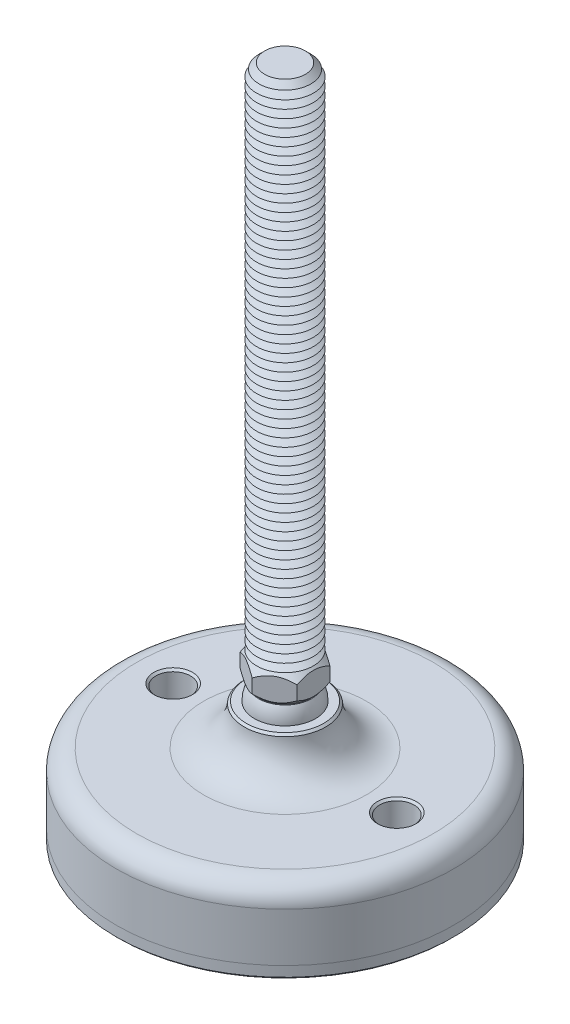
ISO-10303-21;
HEADER;
FILE_DESCRIPTION(('STEP AP214'),'2;1');
FILE_NAME('part.step','',(''),(''),'','','');
FILE_SCHEMA(('AUTOMOTIVE_DESIGN { 1 0 10303 214 1 1 1 1 }'));
ENDSEC;
DATA;
#1=APPLICATION_CONTEXT('core data for automotive mechanical design processes');
#2=APPLICATION_PROTOCOL_DEFINITION('international standard','automotive_design',2000,#1);
#3=PRODUCT_CONTEXT('',#1,'mechanical');
#4=PRODUCT('Part','Part','',(#3));
#5=PRODUCT_RELATED_PRODUCT_CATEGORY('part','',(#4));
#6=PRODUCT_DEFINITION_FORMATION('','',#4);
#7=PRODUCT_DEFINITION_CONTEXT('part definition',#1,'design');
#8=PRODUCT_DEFINITION('design','',#6,#7);
#9=PRODUCT_DEFINITION_SHAPE('','',#8);
#10=(LENGTH_UNIT() NAMED_UNIT(*) SI_UNIT(.MILLI.,.METRE.));
#11=(NAMED_UNIT(*) PLANE_ANGLE_UNIT() SI_UNIT($,.RADIAN.));
#12=(NAMED_UNIT(*) SI_UNIT($,.STERADIAN.) SOLID_ANGLE_UNIT());
#13=UNCERTAINTY_MEASURE_WITH_UNIT(LENGTH_MEASURE(1.E-05),#10,'distance_accuracy_value','');
#14=(GEOMETRIC_REPRESENTATION_CONTEXT(3) GLOBAL_UNCERTAINTY_ASSIGNED_CONTEXT((#13)) GLOBAL_UNIT_ASSIGNED_CONTEXT((#10,
#11,#12)) REPRESENTATION_CONTEXT('',''));
#15=CARTESIAN_POINT('',(0.,0.,0.));
#16=DIRECTION('',(0.,0.,1.));
#17=DIRECTION('',(1.,0.,0.));
#18=AXIS2_PLACEMENT_3D('',#15,#16,#17);
#19=CARTESIAN_POINT('',(0.,-27.,0.));
#20=DIRECTION('',(0.,1.,0.));
#21=DIRECTION('',(0.,0.,1.));
#22=AXIS2_PLACEMENT_3D('',#19,#20,#21);
#23=PLANE('',#22);
#24=CARTESIAN_POINT('',(-27.5,-27.,0.));
#25=DIRECTION('',(0.,1.,0.));
#26=DIRECTION('',(0.,0.,1.));
#27=AXIS2_PLACEMENT_3D('',#24,#25,#26);
#28=CIRCLE('',#27,4.25000000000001);
#29=CARTESIAN_POINT('',(-27.5,-27.,4.25000000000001));
#30=VERTEX_POINT('',#29);
#31=EDGE_CURVE('P0_E43',#30,#30,#28,.T.);
#32=ORIENTED_EDGE('',*,*,#31,.F.);
#33=EDGE_LOOP('',(#32));
#34=FACE_BOUND('',#33,.T.);
#35=CARTESIAN_POINT('',(27.5,-27.,0.));
#36=DIRECTION('',(0.,1.,0.));
#37=DIRECTION('',(0.,0.,1.));
#38=AXIS2_PLACEMENT_3D('',#35,#36,#37);
#39=CIRCLE('',#38,4.25000000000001);
#40=CARTESIAN_POINT('',(27.5,-27.,4.25000000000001));
#41=VERTEX_POINT('',#40);
#42=EDGE_CURVE('P0_E44',#41,#41,#39,.T.);
#43=ORIENTED_EDGE('',*,*,#42,.F.);
#44=EDGE_LOOP('',(#43));
#45=FACE_BOUND('',#44,.T.);
#46=CARTESIAN_POINT('',(0.,-27.,0.));
#47=DIRECTION('',(0.,1.,0.));
#48=DIRECTION('',(0.,0.,1.));
#49=AXIS2_PLACEMENT_3D('',#46,#47,#48);
#50=CIRCLE('',#49,41.5);
#51=CARTESIAN_POINT('',(0.,-27.,41.5));
#52=VERTEX_POINT('',#51);
#53=EDGE_CURVE('P0_E40',#52,#52,#50,.T.);
#54=ORIENTED_EDGE('',*,*,#53,.T.);
#55=EDGE_LOOP('',(#54));
#56=FACE_BOUND('',#55,.T.);
#57=ADVANCED_FACE('P0_F14',(#34,#45,#56),#23,.T.);
#58=CARTESIAN_POINT('',(0.,48.1654938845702,0.));
#59=DIRECTION('',(0.,1.,0.));
#60=DIRECTION('',(0.,0.,1.));
#61=AXIS2_PLACEMENT_3D('',#58,#59,#60);
#62=CYLINDRICAL_SURFACE('',#61,41.5);
#63=CARTESIAN_POINT('',(0.,-29.5,0.));
#64=DIRECTION('',(0.,-1.,0.));
#65=DIRECTION('',(0.,0.,-1.));
#66=AXIS2_PLACEMENT_3D('',#63,#64,#65);
#67=CIRCLE('',#66,41.5);
#68=CARTESIAN_POINT('',(0.,-29.5,-41.5));
#69=VERTEX_POINT('',#68);
#70=EDGE_CURVE('P0_E37',#69,#69,#67,.F.);
#71=ORIENTED_EDGE('',*,*,#70,.T.);
#72=EDGE_LOOP('',(#71));
#73=FACE_BOUND('',#72,.T.);
#74=ORIENTED_EDGE('',*,*,#53,.F.);
#75=EDGE_LOOP('',(#74));
#76=FACE_BOUND('',#75,.T.);
#77=ADVANCED_FACE('P0_F54',(#73,#76),#62,.T.);
#78=CARTESIAN_POINT('',(0.,-30.,41.5));
#79=DIRECTION('',(0.,-1.,0.));
#80=DIRECTION('',(0.,0.,-1.));
#81=AXIS2_PLACEMENT_3D('',#78,#79,#80);
#82=PLANE('',#81);
#83=CARTESIAN_POINT('',(27.5,-30.,0.));
#84=DIRECTION('',(0.,-1.,0.));
#85=DIRECTION('',(0.,0.,-1.));
#86=AXIS2_PLACEMENT_3D('',#83,#84,#85);
#87=CIRCLE('',#86,4.75);
#88=CARTESIAN_POINT('',(27.5,-30.,-4.75000000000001));
#89=VERTEX_POINT('',#88);
#90=EDGE_CURVE('P0_E25',#89,#89,#87,.F.);
#91=ORIENTED_EDGE('',*,*,#90,.T.);
#92=EDGE_LOOP('',(#91));
#93=FACE_BOUND('',#92,.T.);
#94=CARTESIAN_POINT('',(-27.5,-30.,0.));
#95=DIRECTION('',(0.,-1.,0.));
#96=DIRECTION('',(0.,0.,-1.));
#97=AXIS2_PLACEMENT_3D('',#94,#95,#96);
#98=CIRCLE('',#97,4.75);
#99=CARTESIAN_POINT('',(-27.5,-30.,-4.75));
#100=VERTEX_POINT('',#99);
#101=EDGE_CURVE('P0_E29',#100,#100,#98,.F.);
#102=ORIENTED_EDGE('',*,*,#101,.T.);
#103=EDGE_LOOP('',(#102));
#104=FACE_BOUND('',#103,.T.);
#105=CARTESIAN_POINT('',(0.,-30.,0.));
#106=DIRECTION('',(0.,-1.,0.));
#107=DIRECTION('',(0.,0.,-1.));
#108=AXIS2_PLACEMENT_3D('',#105,#106,#107);
#109=CIRCLE('',#108,41.);
#110=CARTESIAN_POINT('',(0.,-30.,-41.));
#111=VERTEX_POINT('',#110);
#112=EDGE_CURVE('P0_E34',#111,#111,#109,.T.);
#113=ORIENTED_EDGE('',*,*,#112,.T.);
#114=EDGE_LOOP('',(#113));
#115=FACE_BOUND('',#114,.T.);
#116=ADVANCED_FACE('P0_F61',(#93,#104,#115),#82,.T.);
#117=CARTESIAN_POINT('',(0.,-29.5,0.));
#118=DIRECTION('',(0.,1.,0.));
#119=DIRECTION('',(0.,0.,1.));
#120=AXIS2_PLACEMENT_3D('',#117,#118,#119);
#121=CONICAL_SURFACE('',#120,41.5,0.785398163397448);
#122=ORIENTED_EDGE('',*,*,#112,.F.);
#123=EDGE_LOOP('',(#122));
#124=FACE_BOUND('',#123,.T.);
#125=ORIENTED_EDGE('',*,*,#70,.F.);
#126=EDGE_LOOP('',(#125));
#127=FACE_BOUND('',#126,.T.);
#128=ADVANCED_FACE('P0_F68',(#124,#127),#121,.T.);
#129=CARTESIAN_POINT('',(27.5,-30.,0.));
#130=DIRECTION('',(0.,1.,0.));
#131=DIRECTION('',(0.,0.,1.));
#132=AXIS2_PLACEMENT_3D('',#129,#130,#131);
#133=CYLINDRICAL_SURFACE('',#132,4.25000000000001);
#134=CARTESIAN_POINT('',(27.5,-29.5,0.));
#135=DIRECTION('',(0.,-1.,0.));
#136=DIRECTION('',(0.,0.,-1.));
#137=AXIS2_PLACEMENT_3D('',#134,#135,#136);
#138=CIRCLE('',#137,4.25000000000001);
#139=CARTESIAN_POINT('',(27.5,-29.5,-4.25000000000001));
#140=VERTEX_POINT('',#139);
#141=EDGE_CURVE('P0_E21',#140,#140,#138,.T.);
#142=ORIENTED_EDGE('',*,*,#141,.T.);
#143=EDGE_LOOP('',(#142));
#144=FACE_BOUND('',#143,.T.);
#145=ORIENTED_EDGE('',*,*,#42,.T.);
#146=EDGE_LOOP('',(#145));
#147=FACE_BOUND('',#146,.T.);
#148=ADVANCED_FACE('P0_F74',(#144,#147),#133,.F.);
#149=CARTESIAN_POINT('',(-27.5,-30.,0.));
#150=DIRECTION('',(0.,1.,0.));
#151=DIRECTION('',(0.,0.,1.));
#152=AXIS2_PLACEMENT_3D('',#149,#150,#151);
#153=CYLINDRICAL_SURFACE('',#152,4.25000000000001);
#154=CARTESIAN_POINT('',(-27.5,-29.5,0.));
#155=DIRECTION('',(0.,-1.,0.));
#156=DIRECTION('',(0.,0.,-1.));
#157=AXIS2_PLACEMENT_3D('',#154,#155,#156);
#158=CIRCLE('',#157,4.25000000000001);
#159=CARTESIAN_POINT('',(-27.5,-29.5,-4.25000000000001));
#160=VERTEX_POINT('',#159);
#161=EDGE_CURVE('P0_E10',#160,#160,#158,.T.);
#162=ORIENTED_EDGE('',*,*,#161,.T.);
#163=EDGE_LOOP('',(#162));
#164=FACE_BOUND('',#163,.T.);
#165=ORIENTED_EDGE('',*,*,#31,.T.);
#166=EDGE_LOOP('',(#165));
#167=FACE_BOUND('',#166,.T.);
#168=ADVANCED_FACE('P0_F50',(#164,#167),#153,.F.);
#169=CARTESIAN_POINT('',(27.5,-30.,0.));
#170=DIRECTION('',(0.,-1.,0.));
#171=DIRECTION('',(0.,0.,-1.));
#172=AXIS2_PLACEMENT_3D('',#169,#170,#171);
#173=CONICAL_SURFACE('',#172,4.75,0.785398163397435);
#174=ORIENTED_EDGE('',*,*,#141,.F.);
#175=EDGE_LOOP('',(#174));
#176=FACE_BOUND('',#175,.T.);
#177=ORIENTED_EDGE('',*,*,#90,.F.);
#178=EDGE_LOOP('',(#177));
#179=FACE_BOUND('',#178,.T.);
#180=ADVANCED_FACE('P0_F76',(#176,#179),#173,.F.);
#181=CARTESIAN_POINT('',(-27.5,-30.,0.));
#182=DIRECTION('',(0.,-1.,0.));
#183=DIRECTION('',(0.,0.,-1.));
#184=AXIS2_PLACEMENT_3D('',#181,#182,#183);
#185=CONICAL_SURFACE('',#184,4.75,0.785398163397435);
#186=ORIENTED_EDGE('',*,*,#161,.F.);
#187=EDGE_LOOP('',(#186));
#188=FACE_BOUND('',#187,.T.);
#189=ORIENTED_EDGE('',*,*,#101,.F.);
#190=EDGE_LOOP('',(#189));
#191=FACE_BOUND('',#190,.T.);
#192=ADVANCED_FACE('P0_F16',(#188,#191),#185,.F.);
#193=CLOSED_SHELL('',(#57,#77,#116,#128,#148,#168,#180,#192));
#194=MANIFOLD_SOLID_BREP('P0_B1',#193);
#195=CARTESIAN_POINT('',(0.,0.,0.));
#196=DIRECTION('',(0.,1.,0.));
#197=DIRECTION('',(0.,0.,-1.));
#198=AXIS2_PLACEMENT_3D('',#195,#196,#197);
#199=SPHERICAL_SURFACE('',#198,7.5);
#200=CARTESIAN_POINT('',(0.,3.75,0.));
#201=DIRECTION('',(0.,-1.,0.));
#202=DIRECTION('',(0.,0.,-1.));
#203=AXIS2_PLACEMENT_3D('',#200,#201,#202);
#204=CIRCLE('',#203,6.49519052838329);
#205=CARTESIAN_POINT('',(0.,3.75,-6.49519052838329));
#206=VERTEX_POINT('',#205);
#207=EDGE_CURVE('P1_E209',#206,#206,#204,.F.);
#208=ORIENTED_EDGE('',*,*,#207,.F.);
#209=EDGE_LOOP('',(#208));
#210=FACE_BOUND('',#209,.T.);
#211=ADVANCED_FACE('P1_F16',(#210),#199,.T.);
#212=CARTESIAN_POINT('',(0.,3.75,0.));
#213=DIRECTION('',(0.,1.,0.));
#214=DIRECTION('',(0.,0.,1.));
#215=AXIS2_PLACEMENT_3D('',#212,#213,#214);
#216=CONICAL_SURFACE('',#215,6.26419292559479,0.785398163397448);
#217=CARTESIAN_POINT('',(0.,3.75,0.));
#218=DIRECTION('',(0.,1.,0.));
#219=DIRECTION('',(0.,0.,1.));
#220=AXIS2_PLACEMENT_3D('',#217,#218,#219);
#221=CIRCLE('',#220,6.26419292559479);
#222=CARTESIAN_POINT('',(0.,3.75,6.26419292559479));
#223=VERTEX_POINT('',#222);
#224=EDGE_CURVE('P1_E213',#223,#223,#221,.T.);
#225=ORIENTED_EDGE('',*,*,#224,.T.);
#226=EDGE_LOOP('',(#225));
#227=FACE_BOUND('',#226,.T.);
#228=CARTESIAN_POINT('',(-7.,8.22175145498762,-8.1400553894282));
#229=CARTESIAN_POINT('',(-7.,8.07177748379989,-7.94220937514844));
#230=CARTESIAN_POINT('',(-7.,7.92322959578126,-7.74326459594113));
#231=CARTESIAN_POINT('',(-7.,7.62962733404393,-7.34274065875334));
#232=CARTESIAN_POINT('',(-7.,7.48457383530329,-7.14116086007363));
#233=CARTESIAN_POINT('',(-7.,7.19756981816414,-6.73345531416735));
#234=CARTESIAN_POINT('',(-7.,7.05565202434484,-6.52730645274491));
#235=CARTESIAN_POINT('',(-7.,6.77703382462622,-6.11152362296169));
#236=CARTESIAN_POINT('',(-7.,6.64033305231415,-5.90188990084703));
#237=CARTESIAN_POINT('',(-7.,6.36550740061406,-5.46619755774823));
#238=CARTESIAN_POINT('',(-7.,6.22776674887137,-5.23989534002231));
#239=CARTESIAN_POINT('',(-7.,5.96123372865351,-4.78200028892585));
#240=CARTESIAN_POINT('',(-7.,5.83244279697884,-4.55040661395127));
#241=CARTESIAN_POINT('',(-7.,5.58658047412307,-4.08193183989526));
#242=CARTESIAN_POINT('',(-7.,5.46947462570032,-3.8450689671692));
#243=CARTESIAN_POINT('',(-7.,5.24960465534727,-3.36483104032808));
#244=CARTESIAN_POINT('',(-7.,5.14683397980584,-3.12145902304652));
#245=CARTESIAN_POINT('',(-7.,4.96723655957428,-2.64866791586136));
#246=CARTESIAN_POINT('',(-7.,4.88895097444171,-2.41980876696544));
#247=CARTESIAN_POINT('',(-7.,4.75072959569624,-1.9565107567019));
#248=CARTESIAN_POINT('',(-7.,4.69079504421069,-1.72207151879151));
#249=CARTESIAN_POINT('',(-7.,4.59342684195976,-1.25295119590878));
#250=CARTESIAN_POINT('',(-7.,4.5556027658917,-1.01835249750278));
#251=CARTESIAN_POINT('',(-7.,4.50320231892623,-0.546559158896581));
#252=CARTESIAN_POINT('',(-7.,4.48862178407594,-0.309364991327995));
#253=CARTESIAN_POINT('',(-7.,4.48382612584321,0.156313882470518));
#254=CARTESIAN_POINT('',(-7.,4.49271264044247,0.384789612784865));
#255=CARTESIAN_POINT('',(-7.,4.53235928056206,0.839822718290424));
#256=CARTESIAN_POINT('',(-7.,4.56312150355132,1.06637990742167));
#257=CARTESIAN_POINT('',(-7.,4.64535130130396,1.51976805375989));
#258=CARTESIAN_POINT('',(-7.,4.69717402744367,1.74653354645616));
#259=CARTESIAN_POINT('',(-7.,4.81873728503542,2.19511331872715));
#260=CARTESIAN_POINT('',(-7.,4.88847641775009,2.41692798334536));
#261=CARTESIAN_POINT('',(-7.,5.04951755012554,2.87389766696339));
#262=CARTESIAN_POINT('',(-7.,5.14215063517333,3.10857869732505));
#263=CARTESIAN_POINT('',(-7.,5.3416605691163,3.57185972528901));
#264=CARTESIAN_POINT('',(-7.,5.44854400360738,3.80045685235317));
#265=CARTESIAN_POINT('',(-7.,5.6740138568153,4.25267813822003));
#266=CARTESIAN_POINT('',(-7.,5.79263686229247,4.47628390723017));
#267=CARTESIAN_POINT('',(-7.,6.03896666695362,4.91835509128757));
#268=CARTESIAN_POINT('',(-7.,6.16667203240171,5.13682131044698));
#269=CARTESIAN_POINT('',(-7.,6.4228595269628,5.55855563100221));
#270=CARTESIAN_POINT('',(-7.,6.55098806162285,5.76203966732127));
#271=CARTESIAN_POINT('',(-7.,6.81264959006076,6.16551366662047));
#272=CARTESIAN_POINT('',(-7.,6.94618299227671,6.36550336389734));
#273=CARTESIAN_POINT('',(-7.,7.21658951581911,6.76082742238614));
#274=CARTESIAN_POINT('',(-7.,7.35342681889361,6.95618637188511));
#275=CARTESIAN_POINT('',(-7.,7.6307324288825,7.34423185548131));
#276=CARTESIAN_POINT('',(-7.,7.77119972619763,7.53691911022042));
#277=CARTESIAN_POINT('',(-7.,7.91315155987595,7.72848711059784));
#278=B_SPLINE_CURVE_WITH_KNOTS('',3,(#228,#229,#230,#231,#232,#233,#234,#235,#236,#237,#238,
#239,#240,#241,#242,#243,#244,#245,#246,#247,#248,#249,#250,#251,#252,#253,#254,#255,#256,#257,
#258,#259,#260,#261,#262,#263,#264,#265,#266,#267,#268,#269,#270,#271,#272,#273,#274,#275,#276,
#277),.UNSPECIFIED.,.F.,.F.,(4,2,2,2,2,2,2,2,2,2,2,2,2,2,2,2,2,2,2,2,2,2,2,2,4),(0.,
0.744807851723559,1.48980030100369,2.2405614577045,2.99126978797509,3.78587980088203,
4.58061708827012,5.37293691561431,6.16489332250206,6.88989369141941,7.61494312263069,
8.32676947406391,9.0384682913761,9.72332048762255,10.4082383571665,11.1052200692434,
11.8021473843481,12.5584650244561,13.3151334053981,14.0742390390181,14.8332251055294,
15.5545151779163,16.2758598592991,16.9913609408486,17.7066651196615),.UNSPECIFIED.);
#279=CARTESIAN_POINT('',(-7.,5.56871084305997,-4.04145188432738));
#280=VERTEX_POINT('',#279);
#281=CARTESIAN_POINT('',(-7.,5.56871084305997,4.04145188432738));
#282=VERTEX_POINT('',#281);
#283=EDGE_CURVE('P1_E25',#280,#282,#278,.T.);
#284=ORIENTED_EDGE('',*,*,#283,.F.);
#285=CARTESIAN_POINT('',(0.000199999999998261,5.56882631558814,-8.0830192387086));
#286=CARTESIAN_POINT('',(-0.120159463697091,5.49934419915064,-8.01352966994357));
#287=CARTESIAN_POINT('',(-0.241444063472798,5.43199440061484,-7.94350597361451));
#288=CARTESIAN_POINT('',(-0.486045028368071,5.30220807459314,-7.80228554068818));
#289=CARTESIAN_POINT('',(-0.60936245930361,5.2397742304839,-7.73108818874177));
#290=CARTESIAN_POINT('',(-0.983781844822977,5.06028719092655,-7.51491705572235));
#291=CARTESIAN_POINT('',(-1.23805341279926,4.95181416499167,-7.36811329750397));
#292=CARTESIAN_POINT('',(-1.75081233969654,4.76606165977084,-7.07207179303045));
#293=CARTESIAN_POINT('',(-2.00916864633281,4.68831421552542,-6.92290970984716));
#294=CARTESIAN_POINT('',(-2.40095049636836,4.59837958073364,-6.69671435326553));
#295=CARTESIAN_POINT('',(-2.53212124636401,4.57286115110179,-6.62098288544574));
#296=CARTESIAN_POINT('',(-2.79557335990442,4.53129725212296,-6.4688787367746));
#297=CARTESIAN_POINT('',(-2.92785455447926,4.5152503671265,-6.39250615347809));
#298=CARTESIAN_POINT('',(-3.25020698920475,4.48834537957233,-6.2063958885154));
#299=CARTESIAN_POINT('',(-3.44062555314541,4.48270029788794,-6.09645767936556));
#300=CARTESIAN_POINT('',(-3.82111946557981,4.49217587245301,-5.87677941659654));
#301=CARTESIAN_POINT('',(-4.01119467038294,4.5073038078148,-5.76703944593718));
#302=CARTESIAN_POINT('',(-4.38955306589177,4.55743368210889,-5.54859412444));
#303=CARTESIAN_POINT('',(-4.57783401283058,4.5924578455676,-5.43989006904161));
#304=CARTESIAN_POINT('',(-4.95115981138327,4.68047604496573,-5.22435031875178));
#305=CARTESIAN_POINT('',(-5.13620490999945,4.73346870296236,-5.1175144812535));
#306=CARTESIAN_POINT('',(-5.46469033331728,4.84248989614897,-4.92786333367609));
#307=CARTESIAN_POINT('',(-5.6088580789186,4.89565100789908,-4.8446280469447));
#308=CARTESIAN_POINT('',(-5.8946056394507,5.0105398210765,-4.67965161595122));
#309=CARTESIAN_POINT('',(-6.03618537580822,5.07226778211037,-4.5979105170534));
#310=CARTESIAN_POINT('',(-6.31631098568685,5.20290661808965,-4.43617992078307));
#311=CARTESIAN_POINT('',(-6.4548648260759,5.27179490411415,-4.3561858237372));
#312=CARTESIAN_POINT('',(-6.72940692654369,5.41585000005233,-4.19767886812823));
#313=CARTESIAN_POINT('',(-6.86539669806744,5.49101295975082,-4.11916513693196));
#314=CARTESIAN_POINT('',(-7.0002,5.56882631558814,-4.04133641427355));
#315=B_SPLINE_CURVE_WITH_KNOTS('',3,(#285,#286,#287,#288,#289,#290,#291,#292,#293,#294,#295,
#296,#297,#298,#299,#300,#301,#302,#303,#304,#305,#306,#307,#308,#309,#310,#311,#312,#313,#314),
.UNSPECIFIED.,.F.,.F.,(4,2,2,2,2,2,2,2,2,2,2,2,2,2,4),(0.,0.466112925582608,0.932478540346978,
1.87024464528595,2.79312018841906,3.25365289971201,3.71411676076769,4.37293813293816,
5.03199042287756,5.69178034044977,6.35151967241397,6.8755322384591,7.39956068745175,
7.92198344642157,8.44408796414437),.UNSPECIFIED.);
#316=CARTESIAN_POINT('',(0.,5.56871084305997,-8.08290376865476));
#317=VERTEX_POINT('',#316);
#318=EDGE_CURVE('P1_E114',#317,#280,#315,.T.);
#319=ORIENTED_EDGE('',*,*,#318,.F.);
#320=CARTESIAN_POINT('',(7.00019999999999,5.56882631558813,-4.04133641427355));
#321=CARTESIAN_POINT('',(6.8798405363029,5.49934419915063,-4.11082598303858));
#322=CARTESIAN_POINT('',(6.7585559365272,5.43199440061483,-4.18084967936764));
#323=CARTESIAN_POINT('',(6.51395497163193,5.30220807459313,-4.32207011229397));
#324=CARTESIAN_POINT('',(6.39063754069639,5.2397742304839,-4.39326746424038));
#325=CARTESIAN_POINT('',(6.01621815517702,5.06028719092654,-4.6094385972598));
#326=CARTESIAN_POINT('',(5.76194658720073,4.95181416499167,-4.75624235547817));
#327=CARTESIAN_POINT('',(5.24918766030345,4.76606165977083,-5.0522838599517));
#328=CARTESIAN_POINT('',(4.99083135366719,4.68831421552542,-5.20144594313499));
#329=CARTESIAN_POINT('',(4.59904950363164,4.59837958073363,-5.42764129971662));
#330=CARTESIAN_POINT('',(4.46787875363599,4.57286115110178,-5.50337276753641));
#331=CARTESIAN_POINT('',(4.20442664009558,4.53129725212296,-5.65547691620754));
#332=CARTESIAN_POINT('',(4.07214544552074,4.5152503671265,-5.73184949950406));
#333=CARTESIAN_POINT('',(3.74979301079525,4.48834537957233,-5.91795976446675));
#334=CARTESIAN_POINT('',(3.55937444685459,4.48270029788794,-6.02789797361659));
#335=CARTESIAN_POINT('',(3.17888053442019,4.49217587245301,-6.2475762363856));
#336=CARTESIAN_POINT('',(2.98880532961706,4.5073038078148,-6.35731620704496));
#337=CARTESIAN_POINT('',(2.61044693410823,4.55743368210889,-6.57576152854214));
#338=CARTESIAN_POINT('',(2.42216598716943,4.5924578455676,-6.68446558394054));
#339=CARTESIAN_POINT('',(2.04884018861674,4.68047604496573,-6.90000533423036));
#340=CARTESIAN_POINT('',(1.86379509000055,4.73346870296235,-7.00684117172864));
#341=CARTESIAN_POINT('',(1.53530966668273,4.84248989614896,-7.19649231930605));
#342=CARTESIAN_POINT('',(1.3911419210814,4.89565100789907,-7.27972760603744));
#343=CARTESIAN_POINT('',(1.1053943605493,5.0105398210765,-7.44470403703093));
#344=CARTESIAN_POINT('',(0.96381462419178,5.07226778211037,-7.52644513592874));
#345=CARTESIAN_POINT('',(0.683689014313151,5.20290661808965,-7.68817573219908));
#346=CARTESIAN_POINT('',(0.545135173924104,5.27179490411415,-7.76816982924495));
#347=CARTESIAN_POINT('',(0.270593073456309,5.41585000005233,-7.92667678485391));
#348=CARTESIAN_POINT('',(0.134603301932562,5.49101295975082,-8.00519051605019));
#349=CARTESIAN_POINT('',(-0.00020000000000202,5.56882631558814,-8.0830192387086));
#350=B_SPLINE_CURVE_WITH_KNOTS('',3,(#320,#321,#322,#323,#324,#325,#326,#327,#328,#329,#330,
#331,#332,#333,#334,#335,#336,#337,#338,#339,#340,#341,#342,#343,#344,#345,#346,#347,#348,#349),
.UNSPECIFIED.,.F.,.F.,(4,2,2,2,2,2,2,2,2,2,2,2,2,2,4),(0.,0.466112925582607,0.932478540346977,
1.87024464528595,2.79312018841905,3.25365289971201,3.71411676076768,4.37293813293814,
5.03199042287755,5.69178034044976,6.35151967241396,6.87553223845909,7.39956068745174,
7.92198344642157,8.44408796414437),.UNSPECIFIED.);
#351=CARTESIAN_POINT('',(7.,5.56871084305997,-4.04145188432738));
#352=VERTEX_POINT('',#351);
#353=EDGE_CURVE('P1_E121',#352,#317,#350,.T.);
#354=ORIENTED_EDGE('',*,*,#353,.F.);
#355=CARTESIAN_POINT('',(6.99999999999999,8.22175145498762,-8.1400553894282));
#356=CARTESIAN_POINT('',(6.99999999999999,8.07177748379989,-7.94220937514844));
#357=CARTESIAN_POINT('',(6.99999999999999,7.92322959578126,-7.74326459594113));
#358=CARTESIAN_POINT('',(6.99999999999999,7.62962733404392,-7.34274065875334));
#359=CARTESIAN_POINT('',(6.99999999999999,7.48457383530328,-7.14116086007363));
#360=CARTESIAN_POINT('',(6.99999999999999,7.19756981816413,-6.73345531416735));
#361=CARTESIAN_POINT('',(6.99999999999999,7.05565202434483,-6.52730645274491));
#362=CARTESIAN_POINT('',(6.99999999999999,6.77703382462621,-6.11152362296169));
#363=CARTESIAN_POINT('',(6.99999999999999,6.64033305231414,-5.90188990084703));
#364=CARTESIAN_POINT('',(6.99999999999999,6.36550740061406,-5.46619755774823));
#365=CARTESIAN_POINT('',(6.99999999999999,6.22776674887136,-5.23989534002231));
#366=CARTESIAN_POINT('',(6.99999999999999,5.9612337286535,-4.78200028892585));
#367=CARTESIAN_POINT('',(6.99999999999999,5.83244279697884,-4.55040661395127));
#368=CARTESIAN_POINT('',(6.99999999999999,5.58658047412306,-4.08193183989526));
#369=CARTESIAN_POINT('',(6.99999999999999,5.46947462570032,-3.8450689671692));
#370=CARTESIAN_POINT('',(6.99999999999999,5.24960465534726,-3.36483104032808));
#371=CARTESIAN_POINT('',(6.99999999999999,5.14683397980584,-3.12145902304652));
#372=CARTESIAN_POINT('',(6.99999999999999,4.96723655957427,-2.64866791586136));
#373=CARTESIAN_POINT('',(6.99999999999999,4.88895097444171,-2.41980876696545));
#374=CARTESIAN_POINT('',(6.99999999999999,4.75072959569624,-1.9565107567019));
#375=CARTESIAN_POINT('',(6.99999999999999,4.69079504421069,-1.72207151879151));
#376=CARTESIAN_POINT('',(6.99999999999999,4.59342684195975,-1.25295119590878));
#377=CARTESIAN_POINT('',(6.99999999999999,4.5556027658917,-1.01835249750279));
#378=CARTESIAN_POINT('',(6.99999999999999,4.50320231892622,-0.546559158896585));
#379=CARTESIAN_POINT('',(6.99999999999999,4.48862178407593,-0.309364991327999));
#380=CARTESIAN_POINT('',(6.99999999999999,4.48382612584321,0.156313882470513));
#381=CARTESIAN_POINT('',(6.99999999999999,4.49271264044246,0.38478961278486));
#382=CARTESIAN_POINT('',(6.99999999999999,4.53235928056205,0.83982271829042));
#383=CARTESIAN_POINT('',(6.99999999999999,4.56312150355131,1.06637990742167));
#384=CARTESIAN_POINT('',(6.99999999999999,4.64535130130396,1.51976805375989));
#385=CARTESIAN_POINT('',(6.99999999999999,4.69717402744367,1.74653354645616));
#386=CARTESIAN_POINT('',(6.99999999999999,4.81873728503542,2.19511331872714));
#387=CARTESIAN_POINT('',(7.,4.88847641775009,2.41692798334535));
#388=CARTESIAN_POINT('',(7.,5.04951755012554,2.87389766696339));
#389=CARTESIAN_POINT('',(7.,5.14215063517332,3.10857869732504));
#390=CARTESIAN_POINT('',(7.,5.34166056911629,3.571859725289));
#391=CARTESIAN_POINT('',(7.,5.44854400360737,3.80045685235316));
#392=CARTESIAN_POINT('',(7.,5.67401385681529,4.25267813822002));
#393=CARTESIAN_POINT('',(7.,5.79263686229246,4.47628390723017));
#394=CARTESIAN_POINT('',(7.,6.03896666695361,4.91835509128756));
#395=CARTESIAN_POINT('',(7.,6.1666720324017,5.13682131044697));
#396=CARTESIAN_POINT('',(7.,6.42285952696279,5.5585556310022));
#397=CARTESIAN_POINT('',(7.,6.55098806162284,5.76203966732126));
#398=CARTESIAN_POINT('',(7.,6.81264959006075,6.16551366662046));
#399=CARTESIAN_POINT('',(7.,6.9461829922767,6.36550336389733));
#400=CARTESIAN_POINT('',(7.,7.21658951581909,6.76082742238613));
#401=CARTESIAN_POINT('',(7.,7.3534268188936,6.9561863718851));
#402=CARTESIAN_POINT('',(7.,7.63073242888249,7.3442318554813));
#403=CARTESIAN_POINT('',(7.,7.77119972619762,7.53691911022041));
#404=CARTESIAN_POINT('',(7.,7.91315155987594,7.72848711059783));
#405=B_SPLINE_CURVE_WITH_KNOTS('',3,(#355,#356,#357,#358,#359,#360,#361,#362,#363,#364,#365,
#366,#367,#368,#369,#370,#371,#372,#373,#374,#375,#376,#377,#378,#379,#380,#381,#382,#383,#384,
#385,#386,#387,#388,#389,#390,#391,#392,#393,#394,#395,#396,#397,#398,#399,#400,#401,#402,#403,
#404),.UNSPECIFIED.,.F.,.F.,(4,2,2,2,2,2,2,2,2,2,2,2,2,2,2,2,2,2,2,2,2,2,2,2,4),(0.,
0.744807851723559,1.48980030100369,2.2405614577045,2.9912697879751,3.78587980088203,
4.58061708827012,5.3729369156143,6.16489332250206,6.8898936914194,7.61494312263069,
8.32676947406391,9.03846829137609,9.72332048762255,10.4082383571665,11.1052200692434,
11.8021473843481,12.5584650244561,13.3151334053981,14.0742390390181,14.8332251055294,
15.5545151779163,16.275859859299,16.9913609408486,17.7066651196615),.UNSPECIFIED.);
#406=CARTESIAN_POINT('',(6.99999999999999,5.56871084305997,4.04145188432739));
#407=VERTEX_POINT('',#406);
#408=EDGE_CURVE('P1_E71',#407,#352,#405,.F.);
#409=ORIENTED_EDGE('',*,*,#408,.F.);
#410=CARTESIAN_POINT('',(-0.000200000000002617,5.56882631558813,8.0830192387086));
#411=CARTESIAN_POINT('',(0.120159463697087,5.49934419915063,8.01352966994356));
#412=CARTESIAN_POINT('',(0.241444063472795,5.43199440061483,7.9435059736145));
#413=CARTESIAN_POINT('',(0.486045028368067,5.30220807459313,7.80228554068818));
#414=CARTESIAN_POINT('',(0.609362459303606,5.2397742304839,7.73108818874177));
#415=CARTESIAN_POINT('',(0.983781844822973,5.06028719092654,7.51491705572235));
#416=CARTESIAN_POINT('',(1.23805341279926,4.95181416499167,7.36811329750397));
#417=CARTESIAN_POINT('',(1.75081233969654,4.76606165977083,7.07207179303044));
#418=CARTESIAN_POINT('',(2.00916864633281,4.68831421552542,6.92290970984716));
#419=CARTESIAN_POINT('',(2.40095049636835,4.59837958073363,6.69671435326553));
#420=CARTESIAN_POINT('',(2.53212124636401,4.57286115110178,6.62098288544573));
#421=CARTESIAN_POINT('',(2.79557335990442,4.53129725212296,6.4688787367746));
#422=CARTESIAN_POINT('',(2.92785455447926,4.5152503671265,6.39250615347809));
#423=CARTESIAN_POINT('',(3.25020698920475,4.48834537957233,6.2063958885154));
#424=CARTESIAN_POINT('',(3.44062555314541,4.48270029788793,6.09645767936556));
#425=CARTESIAN_POINT('',(3.82111946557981,4.492175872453,5.87677941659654));
#426=CARTESIAN_POINT('',(4.01119467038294,4.5073038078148,5.76703944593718));
#427=CARTESIAN_POINT('',(4.38955306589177,4.55743368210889,5.54859412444));
#428=CARTESIAN_POINT('',(4.57783401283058,4.5924578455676,5.4398900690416));
#429=CARTESIAN_POINT('',(4.95115981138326,4.68047604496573,5.22435031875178));
#430=CARTESIAN_POINT('',(5.13620490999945,4.73346870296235,5.1175144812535));
#431=CARTESIAN_POINT('',(5.46469033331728,4.84248989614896,4.92786333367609));
#432=CARTESIAN_POINT('',(5.6088580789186,4.89565100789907,4.8446280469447));
#433=CARTESIAN_POINT('',(5.8946056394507,5.01053982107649,4.67965161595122));
#434=CARTESIAN_POINT('',(6.03618537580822,5.07226778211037,4.5979105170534));
#435=CARTESIAN_POINT('',(6.31631098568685,5.20290661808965,4.43617992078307));
#436=CARTESIAN_POINT('',(6.45486482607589,5.27179490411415,4.3561858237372));
#437=CARTESIAN_POINT('',(6.72940692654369,5.41585000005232,4.19767886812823));
#438=CARTESIAN_POINT('',(6.86539669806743,5.49101295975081,4.11916513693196));
#439=CARTESIAN_POINT('',(7.00019999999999,5.56882631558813,4.04133641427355));
#440=B_SPLINE_CURVE_WITH_KNOTS('',3,(#410,#411,#412,#413,#414,#415,#416,#417,#418,#419,#420,
#421,#422,#423,#424,#425,#426,#427,#428,#429,#430,#431,#432,#433,#434,#435,#436,#437,#438,#439),
.UNSPECIFIED.,.F.,.F.,(4,2,2,2,2,2,2,2,2,2,2,2,2,2,4),(0.,0.466112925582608,0.932478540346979,
1.87024464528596,2.79312018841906,3.25365289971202,3.71411676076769,4.37293813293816,
5.03199042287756,5.69178034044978,6.35151967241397,6.8755322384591,7.39956068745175,
7.92198344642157,8.44408796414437),.UNSPECIFIED.);
#441=CARTESIAN_POINT('',(0.,5.56871084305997,8.08290376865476));
#442=VERTEX_POINT('',#441);
#443=EDGE_CURVE('P1_E68',#442,#407,#440,.T.);
#444=ORIENTED_EDGE('',*,*,#443,.F.);
#445=CARTESIAN_POINT('',(-7.0002,5.56882631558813,4.04133641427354));
#446=CARTESIAN_POINT('',(-6.87984053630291,5.49934419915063,4.11082598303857));
#447=CARTESIAN_POINT('',(-6.7585559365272,5.43199440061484,4.18084967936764));
#448=CARTESIAN_POINT('',(-6.51395497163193,5.30220807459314,4.32207011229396));
#449=CARTESIAN_POINT('',(-6.39063754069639,5.2397742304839,4.39326746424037));
#450=CARTESIAN_POINT('',(-6.01621815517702,5.06028719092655,4.60943859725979));
#451=CARTESIAN_POINT('',(-5.76194658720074,4.95181416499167,4.75624235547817));
#452=CARTESIAN_POINT('',(-5.24918766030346,4.76606165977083,5.0522838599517));
#453=CARTESIAN_POINT('',(-4.99083135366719,4.68831421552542,5.20144594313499));
#454=CARTESIAN_POINT('',(-4.59904950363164,4.59837958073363,5.42764129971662));
#455=CARTESIAN_POINT('',(-4.46787875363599,4.57286115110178,5.50337276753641));
#456=CARTESIAN_POINT('',(-4.20442664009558,4.53129725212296,5.65547691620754));
#457=CARTESIAN_POINT('',(-4.07214544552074,4.5152503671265,5.73184949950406));
#458=CARTESIAN_POINT('',(-3.74979301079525,4.48834537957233,5.91795976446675));
#459=CARTESIAN_POINT('',(-3.55937444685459,4.48270029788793,6.02789797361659));
#460=CARTESIAN_POINT('',(-3.17888053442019,4.492175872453,6.2475762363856));
#461=CARTESIAN_POINT('',(-2.98880532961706,4.5073038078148,6.35731620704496));
#462=CARTESIAN_POINT('',(-2.61044693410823,4.55743368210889,6.57576152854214));
#463=CARTESIAN_POINT('',(-2.42216598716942,4.5924578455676,6.68446558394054));
#464=CARTESIAN_POINT('',(-2.04884018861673,4.68047604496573,6.90000533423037));
#465=CARTESIAN_POINT('',(-1.86379509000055,4.73346870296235,7.00684117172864));
#466=CARTESIAN_POINT('',(-1.53530966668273,4.84248989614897,7.19649231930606));
#467=CARTESIAN_POINT('',(-1.3911419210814,4.89565100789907,7.27972760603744));
#468=CARTESIAN_POINT('',(-1.1053943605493,5.01053982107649,7.44470403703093));
#469=CARTESIAN_POINT('',(-0.963814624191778,5.07226778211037,7.52644513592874));
#470=CARTESIAN_POINT('',(-0.683689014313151,5.20290661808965,7.68817573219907));
#471=CARTESIAN_POINT('',(-0.545135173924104,5.27179490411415,7.76816982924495));
#472=CARTESIAN_POINT('',(-0.270593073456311,5.41585000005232,7.92667678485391));
#473=CARTESIAN_POINT('',(-0.134603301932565,5.49101295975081,8.00519051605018));
#474=CARTESIAN_POINT('',(0.000199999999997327,5.56882631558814,8.0830192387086));
#475=B_SPLINE_CURVE_WITH_KNOTS('',3,(#445,#446,#447,#448,#449,#450,#451,#452,#453,#454,#455,
#456,#457,#458,#459,#460,#461,#462,#463,#464,#465,#466,#467,#468,#469,#470,#471,#472,#473,#474),
.UNSPECIFIED.,.F.,.F.,(4,2,2,2,2,2,2,2,2,2,2,2,2,2,4),(0.,0.466112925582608,0.93247854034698,
1.87024464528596,2.79312018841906,3.25365289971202,3.71411676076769,4.37293813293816,
5.03199042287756,5.69178034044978,6.35151967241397,6.8755322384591,7.39956068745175,
7.92198344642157,8.44408796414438),.UNSPECIFIED.);
#476=EDGE_CURVE('P1_E40',#282,#442,#475,.T.);
#477=ORIENTED_EDGE('',*,*,#476,.F.);
#478=EDGE_LOOP('',(#284,#319,#354,#409,#444,#477));
#479=FACE_BOUND('',#478,.T.);
#480=ADVANCED_FACE('P1_F69',(#227,#479),#216,.T.);
#481=CARTESIAN_POINT('',(0.,3.75,6.26419292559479));
#482=DIRECTION('',(0.,-1.,0.));
#483=DIRECTION('',(0.,0.,-1.));
#484=AXIS2_PLACEMENT_3D('',#481,#482,#483);
#485=PLANE('',#484);
#486=ORIENTED_EDGE('',*,*,#207,.T.);
#487=EDGE_LOOP('',(#486));
#488=FACE_BOUND('',#487,.T.);
#489=ORIENTED_EDGE('',*,*,#224,.F.);
#490=EDGE_LOOP('',(#489));
#491=FACE_BOUND('',#490,.T.);
#492=ADVANCED_FACE('P1_F106',(#488,#491),#485,.F.);
#493=CARTESIAN_POINT('',(-7.,11.,4.04145188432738));
#494=DIRECTION('',(0.5,0.,-0.866025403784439));
#495=DIRECTION('',(-0.866025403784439,0.,-0.5));
#496=AXIS2_PLACEMENT_3D('',#493,#494,#495);
#497=PLANE('',#496);
#498=DIRECTION('',(0.,-1.,0.));
#499=VECTOR('',#498,1.);
#500=CARTESIAN_POINT('',(0.,11.,8.08290376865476));
#501=LINE('',#500,#499);
#502=CARTESIAN_POINT('',(0.,8.97927405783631,8.08290376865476));
#503=VERTEX_POINT('',#502);
#504=EDGE_CURVE('P1_E82',#503,#442,#501,.T.);
#505=ORIENTED_EDGE('',*,*,#504,.F.);
#506=CARTESIAN_POINT('',(0.000199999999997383,8.97915858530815,8.0830192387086));
#507=CARTESIAN_POINT('',(-0.120159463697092,9.04864070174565,8.01352966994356));
#508=CARTESIAN_POINT('',(-0.241444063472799,9.11599050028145,7.9435059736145));
#509=CARTESIAN_POINT('',(-0.486045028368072,9.24577682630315,7.80228554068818));
#510=CARTESIAN_POINT('',(-0.609362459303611,9.30821067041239,7.73108818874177));
#511=CARTESIAN_POINT('',(-0.983781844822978,9.48769770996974,7.51491705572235));
#512=CARTESIAN_POINT('',(-1.23805341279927,9.59617073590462,7.36811329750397));
#513=CARTESIAN_POINT('',(-1.75081233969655,9.78192324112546,7.07207179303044));
#514=CARTESIAN_POINT('',(-2.00916864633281,9.85967068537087,6.92290970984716));
#515=CARTESIAN_POINT('',(-2.40095049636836,9.94960532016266,6.69671435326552));
#516=CARTESIAN_POINT('',(-2.53212124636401,9.9751237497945,6.62098288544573));
#517=CARTESIAN_POINT('',(-2.79557335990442,10.0166876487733,6.4688787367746));
#518=CARTESIAN_POINT('',(-2.92785455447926,10.0327345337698,6.39250615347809));
#519=CARTESIAN_POINT('',(-3.25020698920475,10.059639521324,6.2063958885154));
#520=CARTESIAN_POINT('',(-3.44062555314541,10.0652846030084,6.09645767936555));
#521=CARTESIAN_POINT('',(-3.82111946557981,10.0558090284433,5.87677941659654));
#522=CARTESIAN_POINT('',(-4.01119467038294,10.0406810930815,5.76703944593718));
#523=CARTESIAN_POINT('',(-4.38955306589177,9.9905512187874,5.54859412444));
#524=CARTESIAN_POINT('',(-4.57783401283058,9.95552705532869,5.4398900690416));
#525=CARTESIAN_POINT('',(-4.95115981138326,9.86750885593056,5.22435031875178));
#526=CARTESIAN_POINT('',(-5.13620490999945,9.81451619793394,5.1175144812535));
#527=CARTESIAN_POINT('',(-5.46469033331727,9.70549500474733,4.92786333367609));
#528=CARTESIAN_POINT('',(-5.6088580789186,9.65233389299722,4.8446280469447));
#529=CARTESIAN_POINT('',(-5.8946056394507,9.5374450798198,4.67965161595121));
#530=CARTESIAN_POINT('',(-6.03618537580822,9.47571711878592,4.5979105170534));
#531=CARTESIAN_POINT('',(-6.31631098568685,9.34507828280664,4.43617992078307));
#532=CARTESIAN_POINT('',(-6.4548648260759,9.27618999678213,4.35618582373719));
#533=CARTESIAN_POINT('',(-6.72940692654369,9.13213490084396,4.19767886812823));
#534=CARTESIAN_POINT('',(-6.86539669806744,9.05697194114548,4.11916513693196));
#535=CARTESIAN_POINT('',(-7.0002,8.97915858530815,4.04133641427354));
#536=B_SPLINE_CURVE_WITH_KNOTS('',3,(#506,#507,#508,#509,#510,#511,#512,#513,#514,#515,#516,
#517,#518,#519,#520,#521,#522,#523,#524,#525,#526,#527,#528,#529,#530,#531,#532,#533,#534,#535),
.UNSPECIFIED.,.F.,.F.,(4,2,2,2,2,2,2,2,2,2,2,2,2,2,4),(0.,0.466112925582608,0.932478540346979,
1.87024464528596,2.79312018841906,3.25365289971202,3.71411676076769,4.37293813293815,
5.03199042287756,5.69178034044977,6.35151967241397,6.87553223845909,7.39956068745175,
7.92198344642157,8.44408796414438),.UNSPECIFIED.);
#537=CARTESIAN_POINT('',(-7.,8.97927405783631,4.04145188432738));
#538=VERTEX_POINT('',#537);
#539=EDGE_CURVE('P1_E151',#503,#538,#536,.T.);
#540=ORIENTED_EDGE('',*,*,#539,.T.);
#541=DIRECTION('',(0.,-1.,0.));
#542=VECTOR('',#541,1.);
#543=CARTESIAN_POINT('',(-7.,11.,4.04145188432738));
#544=LINE('',#543,#542);
#545=EDGE_CURVE('P1_E84',#538,#282,#544,.T.);
#546=ORIENTED_EDGE('',*,*,#545,.T.);
#547=ORIENTED_EDGE('',*,*,#476,.T.);
#548=EDGE_LOOP('',(#505,#540,#546,#547));
#549=FACE_BOUND('',#548,.T.);
#550=ADVANCED_FACE('P1_F80',(#549),#497,.F.);
#551=CARTESIAN_POINT('',(0.,11.,8.08290376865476));
#552=DIRECTION('',(-0.5,0.,-0.866025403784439));
#553=DIRECTION('',(-0.866025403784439,0.,0.5));
#554=AXIS2_PLACEMENT_3D('',#551,#552,#553);
#555=PLANE('',#554);
#556=DIRECTION('',(0.,-1.,0.));
#557=VECTOR('',#556,1.);
#558=CARTESIAN_POINT('',(7.,11.,4.04145188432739));
#559=LINE('',#558,#557);
#560=CARTESIAN_POINT('',(7.,8.97927405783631,4.04145188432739));
#561=VERTEX_POINT('',#560);
#562=EDGE_CURVE('P1_E89',#561,#407,#559,.T.);
#563=ORIENTED_EDGE('',*,*,#562,.F.);
#564=CARTESIAN_POINT('',(7.0002,8.97915858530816,4.04133641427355));
#565=CARTESIAN_POINT('',(6.87984053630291,9.04864070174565,4.11082598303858));
#566=CARTESIAN_POINT('',(6.7585559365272,9.11599050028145,4.18084967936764));
#567=CARTESIAN_POINT('',(6.51395497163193,9.24577682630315,4.32207011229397));
#568=CARTESIAN_POINT('',(6.39063754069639,9.30821067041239,4.39326746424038));
#569=CARTESIAN_POINT('',(6.01621815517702,9.48769770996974,4.6094385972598));
#570=CARTESIAN_POINT('',(5.76194658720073,9.59617073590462,4.75624235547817));
#571=CARTESIAN_POINT('',(5.24918766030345,9.78192324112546,5.0522838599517));
#572=CARTESIAN_POINT('',(4.99083135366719,9.85967068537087,5.20144594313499));
#573=CARTESIAN_POINT('',(4.59904950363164,9.94960532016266,5.42764129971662));
#574=CARTESIAN_POINT('',(4.46787875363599,9.9751237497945,5.50337276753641));
#575=CARTESIAN_POINT('',(4.20442664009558,10.0166876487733,5.65547691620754));
#576=CARTESIAN_POINT('',(4.07214544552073,10.0327345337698,5.73184949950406));
#577=CARTESIAN_POINT('',(3.74979301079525,10.059639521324,5.91795976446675));
#578=CARTESIAN_POINT('',(3.55937444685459,10.0652846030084,6.02789797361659));
#579=CARTESIAN_POINT('',(3.17888053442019,10.0558090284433,6.2475762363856));
#580=CARTESIAN_POINT('',(2.98880532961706,10.0406810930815,6.35731620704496));
#581=CARTESIAN_POINT('',(2.61044693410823,9.9905512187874,6.57576152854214));
#582=CARTESIAN_POINT('',(2.42216598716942,9.95552705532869,6.68446558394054));
#583=CARTESIAN_POINT('',(2.04884018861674,9.86750885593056,6.90000533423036));
#584=CARTESIAN_POINT('',(1.86379509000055,9.81451619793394,7.00684117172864));
#585=CARTESIAN_POINT('',(1.53530966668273,9.70549500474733,7.19649231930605));
#586=CARTESIAN_POINT('',(1.3911419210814,9.65233389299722,7.27972760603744));
#587=CARTESIAN_POINT('',(1.1053943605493,9.5374450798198,7.44470403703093));
#588=CARTESIAN_POINT('',(0.963814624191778,9.47571711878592,7.52644513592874));
#589=CARTESIAN_POINT('',(0.683689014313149,9.34507828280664,7.68817573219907));
#590=CARTESIAN_POINT('',(0.545135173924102,9.27618999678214,7.76816982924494));
#591=CARTESIAN_POINT('',(0.270593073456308,9.13213490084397,7.92667678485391));
#592=CARTESIAN_POINT('',(0.134603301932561,9.05697194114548,8.00519051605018));
#593=CARTESIAN_POINT('',(-0.000200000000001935,8.97915858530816,8.0830192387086));
#594=B_SPLINE_CURVE_WITH_KNOTS('',3,(#564,#565,#566,#567,#568,#569,#570,#571,#572,#573,#574,
#575,#576,#577,#578,#579,#580,#581,#582,#583,#584,#585,#586,#587,#588,#589,#590,#591,#592,#593),
.UNSPECIFIED.,.F.,.F.,(4,2,2,2,2,2,2,2,2,2,2,2,2,2,4),(0.,0.466112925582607,0.932478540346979,
1.87024464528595,2.79312018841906,3.25365289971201,3.71411676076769,4.37293813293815,
5.03199042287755,5.69178034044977,6.35151967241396,6.87553223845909,7.39956068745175,
7.92198344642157,8.44408796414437),.UNSPECIFIED.);
#595=EDGE_CURVE('P1_E88',#561,#503,#594,.T.);
#596=ORIENTED_EDGE('',*,*,#595,.T.);
#597=ORIENTED_EDGE('',*,*,#504,.T.);
#598=ORIENTED_EDGE('',*,*,#443,.T.);
#599=EDGE_LOOP('',(#563,#596,#597,#598));
#600=FACE_BOUND('',#599,.T.);
#601=ADVANCED_FACE('P1_F87',(#600),#555,.F.);
#602=CARTESIAN_POINT('',(7.,11.,4.04145188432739));
#603=DIRECTION('',(-1.,0.,0.));
#604=DIRECTION('',(0.,0.,1.));
#605=AXIS2_PLACEMENT_3D('',#602,#603,#604);
#606=PLANE('',#605);
#607=DIRECTION('',(0.,-1.,0.));
#608=VECTOR('',#607,1.);
#609=CARTESIAN_POINT('',(6.99999999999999,11.,-4.04145188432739));
#610=LINE('',#609,#608);
#611=CARTESIAN_POINT('',(7.,8.97927405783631,-4.04145188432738));
#612=VERTEX_POINT('',#611);
#613=EDGE_CURVE('P1_E92',#612,#352,#610,.T.);
#614=ORIENTED_EDGE('',*,*,#613,.F.);
#615=CARTESIAN_POINT('',(6.99999999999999,6.38657431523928,-8.06030460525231));
#616=CARTESIAN_POINT('',(6.99999999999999,6.53472070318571,-7.86404504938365));
#617=CARTESIAN_POINT('',(6.99999999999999,6.68143506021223,-7.66668664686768));
#618=CARTESIAN_POINT('',(6.99999999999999,6.97135854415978,-7.26933868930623));
#619=CARTESIAN_POINT('',(6.99999999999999,7.1145667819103,-7.06934848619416));
#620=CARTESIAN_POINT('',(6.99999999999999,7.39785506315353,-6.66484054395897));
#621=CARTESIAN_POINT('',(6.99999999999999,7.53790227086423,-6.4602997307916));
#622=CARTESIAN_POINT('',(6.99999999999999,7.81276929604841,-6.04774624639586));
#623=CARTESIAN_POINT('',(6.99999999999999,7.94758948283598,-5.83973382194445));
#624=CARTESIAN_POINT('',(6.99999999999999,8.21836349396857,-5.40767991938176));
#625=CARTESIAN_POINT('',(6.99999999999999,8.35394167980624,-5.18340182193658));
#626=CARTESIAN_POINT('',(6.99999999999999,8.61617794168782,-4.72961052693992));
#627=CARTESIAN_POINT('',(6.99999999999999,8.74283460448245,-4.50009650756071));
#628=CARTESIAN_POINT('',(6.99999999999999,8.98449500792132,-4.03585471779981));
#629=CARTESIAN_POINT('',(6.99999999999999,9.09953301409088,-3.80114492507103));
#630=CARTESIAN_POINT('',(6.99999999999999,9.31538083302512,-3.32532417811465));
#631=CARTESIAN_POINT('',(6.99999999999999,9.41619708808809,-3.08421618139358));
#632=CARTESIAN_POINT('',(6.99999999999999,9.59261477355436,-2.61490679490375));
#633=CARTESIAN_POINT('',(6.99999999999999,9.66959244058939,-2.38722816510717));
#634=CARTESIAN_POINT('',(6.99999999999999,9.80528213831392,-1.92638931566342));
#635=CARTESIAN_POINT('',(6.99999999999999,9.86399291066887,-1.69322871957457));
#636=CARTESIAN_POINT('',(6.99999999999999,9.95910606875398,-1.22669621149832));
#637=CARTESIAN_POINT('',(6.99999999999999,9.9958906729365,-0.993403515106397));
#638=CARTESIAN_POINT('',(6.99999999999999,10.0464375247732,-0.524324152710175));
#639=CARTESIAN_POINT('',(6.99999999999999,10.0602037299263,-0.288537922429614));
#640=CARTESIAN_POINT('',(6.99999999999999,10.0636914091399,0.174669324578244));
#641=CARTESIAN_POINT('',(6.99999999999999,10.0542651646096,0.402084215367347));
#642=CARTESIAN_POINT('',(6.99999999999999,10.0137689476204,0.854966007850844));
#643=CARTESIAN_POINT('',(6.99999999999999,9.98269687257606,1.080432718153));
#644=CARTESIAN_POINT('',(6.99999999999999,9.90007567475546,1.53159825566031));
#645=CARTESIAN_POINT('',(6.99999999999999,9.84817808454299,1.75723223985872));
#646=CARTESIAN_POINT('',(6.99999999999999,9.72667364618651,2.20358388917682));
#647=CARTESIAN_POINT('',(7.,9.65706827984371,2.42430196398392));
#648=CARTESIAN_POINT('',(7.,9.49585307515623,2.88081008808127));
#649=CARTESIAN_POINT('',(7.,9.40279568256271,3.11608373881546));
#650=CARTESIAN_POINT('',(7.,9.20239444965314,3.58051976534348));
#651=CARTESIAN_POINT('',(7.,9.09504395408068,3.8096792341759));
#652=CARTESIAN_POINT('',(7.,8.86861061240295,4.26300681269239));
#653=CARTESIAN_POINT('',(7.,8.74949092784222,4.48715637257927));
#654=CARTESIAN_POINT('',(7.,8.50215207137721,4.93029722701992));
#655=CARTESIAN_POINT('',(7.,8.37393434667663,5.14928933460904));
#656=CARTESIAN_POINT('',(7.,8.11675254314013,5.57201416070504));
#657=CARTESIAN_POINT('',(7.,7.98814324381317,5.7759638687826));
#658=CARTESIAN_POINT('',(7.,7.72551640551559,6.1803619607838));
#659=CARTESIAN_POINT('',(7.,7.59149845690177,6.3808100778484));
#660=CARTESIAN_POINT('',(7.,7.32012806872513,6.77703781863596));
#661=CARTESIAN_POINT('',(7.,7.18281155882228,6.97284213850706));
#662=CARTESIAN_POINT('',(7.,6.90454718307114,7.36177489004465));
#663=CARTESIAN_POINT('',(7.,6.76360032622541,7.55490404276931));
#664=CARTESIAN_POINT('',(7.,6.62116922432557,7.74691297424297));
#665=B_SPLINE_CURVE_WITH_KNOTS('',3,(#615,#616,#617,#618,#619,#620,#621,#622,#623,#624,#625,
#626,#627,#628,#629,#630,#631,#632,#633,#634,#635,#636,#637,#638,#639,#640,#641,#642,#643,#644,
#645,#646,#647,#648,#649,#650,#651,#652,#653,#654,#655,#656,#657,#658,#659,#660,#661,#662,#663,
#664),.UNSPECIFIED.,.F.,.F.,(4,2,2,2,2,2,2,2,2,2,2,2,2,2,2,2,2,2,2,2,2,2,2,2,4),(0.,
0.73770456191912,1.47559431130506,2.21920144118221,2.96275593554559,3.74880908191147,
4.53498646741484,5.31877306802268,6.10220347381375,6.82258884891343,7.54302383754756,
8.2505020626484,8.95785864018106,9.63961191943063,10.3214314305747,11.0151699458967,
11.7088504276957,12.4672854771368,13.2260749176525,13.9873195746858,14.7484434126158,
15.4716843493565,16.1949801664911,16.912400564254,17.6296236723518),.UNSPECIFIED.);
#666=EDGE_CURVE('P1_E152',#612,#561,#665,.T.);
#667=ORIENTED_EDGE('',*,*,#666,.T.);
#668=ORIENTED_EDGE('',*,*,#562,.T.);
#669=ORIENTED_EDGE('',*,*,#408,.T.);
#670=EDGE_LOOP('',(#614,#667,#668,#669));
#671=FACE_BOUND('',#670,.T.);
#672=ADVANCED_FACE('P1_F142',(#671),#606,.F.);
#673=CARTESIAN_POINT('',(6.99999999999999,11.,-4.04145188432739));
#674=DIRECTION('',(-0.5,0.,0.866025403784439));
#675=DIRECTION('',(0.866025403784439,0.,0.5));
#676=AXIS2_PLACEMENT_3D('',#673,#674,#675);
#677=PLANE('',#676);
#678=DIRECTION('',(0.,-1.,0.));
#679=VECTOR('',#678,1.);
#680=CARTESIAN_POINT('',(0.,11.,-8.08290376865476));
#681=LINE('',#680,#679);
#682=CARTESIAN_POINT('',(0.,8.97927405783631,-8.08290376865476));
#683=VERTEX_POINT('',#682);
#684=EDGE_CURVE('P1_E1341',#683,#317,#681,.T.);
#685=ORIENTED_EDGE('',*,*,#684,.F.);
#686=CARTESIAN_POINT('',(-0.000200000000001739,8.97915858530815,-8.0830192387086));
#687=CARTESIAN_POINT('',(0.120159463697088,9.04864070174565,-8.01352966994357));
#688=CARTESIAN_POINT('',(0.241444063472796,9.11599050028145,-7.94350597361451));
#689=CARTESIAN_POINT('',(0.48604502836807,9.24577682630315,-7.80228554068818));
#690=CARTESIAN_POINT('',(0.609362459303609,9.30821067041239,-7.73108818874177));
#691=CARTESIAN_POINT('',(0.983781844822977,9.48769770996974,-7.51491705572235));
#692=CARTESIAN_POINT('',(1.23805341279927,9.59617073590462,-7.36811329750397));
#693=CARTESIAN_POINT('',(1.75081233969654,9.78192324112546,-7.07207179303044));
#694=CARTESIAN_POINT('',(2.00916864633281,9.85967068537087,-6.92290970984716));
#695=CARTESIAN_POINT('',(2.40095049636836,9.94960532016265,-6.69671435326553));
#696=CARTESIAN_POINT('',(2.53212124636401,9.9751237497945,-6.62098288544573));
#697=CARTESIAN_POINT('',(2.79557335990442,10.0166876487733,-6.4688787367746));
#698=CARTESIAN_POINT('',(2.92785455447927,10.0327345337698,-6.39250615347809));
#699=CARTESIAN_POINT('',(3.25020698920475,10.059639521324,-6.2063958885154));
#700=CARTESIAN_POINT('',(3.44062555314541,10.0652846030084,-6.09645767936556));
#701=CARTESIAN_POINT('',(3.82111946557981,10.0558090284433,-5.87677941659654));
#702=CARTESIAN_POINT('',(4.01119467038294,10.0406810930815,-5.76703944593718));
#703=CARTESIAN_POINT('',(4.38955306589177,9.9905512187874,-5.54859412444));
#704=CARTESIAN_POINT('',(4.57783401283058,9.95552705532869,-5.4398900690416));
#705=CARTESIAN_POINT('',(4.95115981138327,9.86750885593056,-5.22435031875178));
#706=CARTESIAN_POINT('',(5.13620490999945,9.81451619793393,-5.1175144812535));
#707=CARTESIAN_POINT('',(5.46469033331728,9.70549500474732,-4.92786333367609));
#708=CARTESIAN_POINT('',(5.6088580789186,9.65233389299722,-4.8446280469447));
#709=CARTESIAN_POINT('',(5.8946056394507,9.5374450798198,-4.67965161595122));
#710=CARTESIAN_POINT('',(6.03618537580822,9.47571711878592,-4.5979105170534));
#711=CARTESIAN_POINT('',(6.31631098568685,9.34507828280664,-4.43617992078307));
#712=CARTESIAN_POINT('',(6.45486482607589,9.27618999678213,-4.3561858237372));
#713=CARTESIAN_POINT('',(6.72940692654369,9.13213490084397,-4.19767886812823));
#714=CARTESIAN_POINT('',(6.86539669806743,9.05697194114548,-4.11916513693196));
#715=CARTESIAN_POINT('',(7.00019999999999,8.97915858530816,-4.04133641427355));
#716=B_SPLINE_CURVE_WITH_KNOTS('',3,(#686,#687,#688,#689,#690,#691,#692,#693,#694,#695,#696,
#697,#698,#699,#700,#701,#702,#703,#704,#705,#706,#707,#708,#709,#710,#711,#712,#713,#714,#715),
.UNSPECIFIED.,.F.,.F.,(4,2,2,2,2,2,2,2,2,2,2,2,2,2,4),(0.,0.466112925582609,0.932478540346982,
1.87024464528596,2.79312018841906,3.25365289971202,3.7141167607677,4.37293813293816,
5.03199042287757,5.69178034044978,6.35151967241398,6.8755322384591,7.39956068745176,
7.92198344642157,8.44408796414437),.UNSPECIFIED.);
#717=EDGE_CURVE('P1_E182',#683,#612,#716,.T.);
#718=ORIENTED_EDGE('',*,*,#717,.T.);
#719=ORIENTED_EDGE('',*,*,#613,.T.);
#720=ORIENTED_EDGE('',*,*,#353,.T.);
#721=EDGE_LOOP('',(#685,#718,#719,#720));
#722=FACE_BOUND('',#721,.T.);
#723=ADVANCED_FACE('P1_F187',(#722),#677,.F.);
#724=CARTESIAN_POINT('',(0.,11.,-8.08290376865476));
#725=DIRECTION('',(0.5,0.,0.866025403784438));
#726=DIRECTION('',(0.866025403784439,0.,-0.5));
#727=AXIS2_PLACEMENT_3D('',#724,#725,#726);
#728=PLANE('',#727);
#729=DIRECTION('',(0.,-1.,0.));
#730=VECTOR('',#729,1.);
#731=CARTESIAN_POINT('',(-7.,11.,-4.04145188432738));
#732=LINE('',#731,#730);
#733=CARTESIAN_POINT('',(-7.,8.97927405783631,-4.04145188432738));
#734=VERTEX_POINT('',#733);
#735=EDGE_CURVE('P1_E1343',#734,#280,#732,.T.);
#736=ORIENTED_EDGE('',*,*,#735,.F.);
#737=CARTESIAN_POINT('',(-7.0002,8.97915858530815,-4.04133641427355));
#738=CARTESIAN_POINT('',(-6.87984053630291,9.04864070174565,-4.11082598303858));
#739=CARTESIAN_POINT('',(-6.7585559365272,9.11599050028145,-4.18084967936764));
#740=CARTESIAN_POINT('',(-6.51395497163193,9.24577682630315,-4.32207011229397));
#741=CARTESIAN_POINT('',(-6.39063754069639,9.30821067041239,-4.39326746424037));
#742=CARTESIAN_POINT('',(-6.01621815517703,9.48769770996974,-4.6094385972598));
#743=CARTESIAN_POINT('',(-5.76194658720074,9.59617073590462,-4.75624235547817));
#744=CARTESIAN_POINT('',(-5.24918766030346,9.78192324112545,-5.0522838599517));
#745=CARTESIAN_POINT('',(-4.99083135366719,9.85967068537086,-5.20144594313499));
#746=CARTESIAN_POINT('',(-4.59904950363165,9.94960532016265,-5.42764129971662));
#747=CARTESIAN_POINT('',(-4.467878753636,9.9751237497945,-5.50337276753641));
#748=CARTESIAN_POINT('',(-4.20442664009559,10.0166876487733,-5.65547691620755));
#749=CARTESIAN_POINT('',(-4.07214544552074,10.0327345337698,-5.73184949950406));
#750=CARTESIAN_POINT('',(-3.74979301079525,10.059639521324,-5.91795976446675));
#751=CARTESIAN_POINT('',(-3.55937444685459,10.0652846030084,-6.02789797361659));
#752=CARTESIAN_POINT('',(-3.17888053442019,10.0558090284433,-6.24757623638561));
#753=CARTESIAN_POINT('',(-2.98880532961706,10.0406810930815,-6.35731620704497));
#754=CARTESIAN_POINT('',(-2.61044693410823,9.9905512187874,-6.57576152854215));
#755=CARTESIAN_POINT('',(-2.42216598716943,9.95552705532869,-6.68446558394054));
#756=CARTESIAN_POINT('',(-2.04884018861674,9.86750885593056,-6.90000533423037));
#757=CARTESIAN_POINT('',(-1.86379509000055,9.81451619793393,-7.00684117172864));
#758=CARTESIAN_POINT('',(-1.53530966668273,9.70549500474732,-7.19649231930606));
#759=CARTESIAN_POINT('',(-1.39114192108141,9.65233389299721,-7.27972760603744));
#760=CARTESIAN_POINT('',(-1.10539436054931,9.53744507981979,-7.44470403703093));
#761=CARTESIAN_POINT('',(-0.963814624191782,9.47571711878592,-7.52644513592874));
#762=CARTESIAN_POINT('',(-0.683689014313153,9.34507828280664,-7.68817573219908));
#763=CARTESIAN_POINT('',(-0.545135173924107,9.27618999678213,-7.76816982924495));
#764=CARTESIAN_POINT('',(-0.270593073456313,9.13213490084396,-7.92667678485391));
#765=CARTESIAN_POINT('',(-0.134603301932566,9.05697194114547,-8.00519051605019));
#766=CARTESIAN_POINT('',(0.000199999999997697,8.97915858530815,-8.0830192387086));
#767=B_SPLINE_CURVE_WITH_KNOTS('',3,(#737,#738,#739,#740,#741,#742,#743,#744,#745,#746,#747,
#748,#749,#750,#751,#752,#753,#754,#755,#756,#757,#758,#759,#760,#761,#762,#763,#764,#765,#766),
.UNSPECIFIED.,.F.,.F.,(4,2,2,2,2,2,2,2,2,2,2,2,2,2,4),(0.,0.466112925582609,0.932478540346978,
1.87024464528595,2.79312018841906,3.25365289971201,3.71411676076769,4.37293813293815,
5.03199042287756,5.69178034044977,6.35151967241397,6.87553223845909,7.39956068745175,
7.92198344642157,8.44408796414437),.UNSPECIFIED.);
#768=EDGE_CURVE('P1_E32',#734,#683,#767,.T.);
#769=ORIENTED_EDGE('',*,*,#768,.T.);
#770=ORIENTED_EDGE('',*,*,#684,.T.);
#771=ORIENTED_EDGE('',*,*,#318,.T.);
#772=EDGE_LOOP('',(#736,#769,#770,#771));
#773=FACE_BOUND('',#772,.T.);
#774=ADVANCED_FACE('P1_F190',(#773),#728,.F.);
#775=CARTESIAN_POINT('',(-7.,11.,-4.04145188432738));
#776=DIRECTION('',(1.,0.,0.));
#777=DIRECTION('',(0.,0.,-1.));
#778=AXIS2_PLACEMENT_3D('',#775,#776,#777);
#779=PLANE('',#778);
#780=ORIENTED_EDGE('',*,*,#545,.F.);
#781=CARTESIAN_POINT('',(-7.,6.38657431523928,-8.06030460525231));
#782=CARTESIAN_POINT('',(-7.,6.53472070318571,-7.86404504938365));
#783=CARTESIAN_POINT('',(-7.,6.68143506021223,-7.66668664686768));
#784=CARTESIAN_POINT('',(-7.,6.97135854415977,-7.26933868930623));
#785=CARTESIAN_POINT('',(-7.,7.11456678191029,-7.06934848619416));
#786=CARTESIAN_POINT('',(-7.,7.39785506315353,-6.66484054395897));
#787=CARTESIAN_POINT('',(-7.,7.53790227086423,-6.4602997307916));
#788=CARTESIAN_POINT('',(-7.,7.81276929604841,-6.04774624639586));
#789=CARTESIAN_POINT('',(-7.,7.94758948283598,-5.83973382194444));
#790=CARTESIAN_POINT('',(-7.,8.21836349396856,-5.40767991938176));
#791=CARTESIAN_POINT('',(-7.,8.35394167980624,-5.18340182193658));
#792=CARTESIAN_POINT('',(-7.,8.61617794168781,-4.72961052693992));
#793=CARTESIAN_POINT('',(-7.,8.74283460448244,-4.50009650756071));
#794=CARTESIAN_POINT('',(-7.,8.98449500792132,-4.03585471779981));
#795=CARTESIAN_POINT('',(-7.,9.09953301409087,-3.80114492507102));
#796=CARTESIAN_POINT('',(-7.,9.31538083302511,-3.32532417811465));
#797=CARTESIAN_POINT('',(-7.,9.41619708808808,-3.08421618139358));
#798=CARTESIAN_POINT('',(-7.,9.59261477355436,-2.61490679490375));
#799=CARTESIAN_POINT('',(-7.,9.66959244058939,-2.38722816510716));
#800=CARTESIAN_POINT('',(-7.,9.80528213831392,-1.92638931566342));
#801=CARTESIAN_POINT('',(-7.,9.86399291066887,-1.69322871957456));
#802=CARTESIAN_POINT('',(-7.,9.95910606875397,-1.22669621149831));
#803=CARTESIAN_POINT('',(-7.,9.99589067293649,-0.993403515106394));
#804=CARTESIAN_POINT('',(-7.,10.0464375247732,-0.524324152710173));
#805=CARTESIAN_POINT('',(-7.,10.0602037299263,-0.288537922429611));
#806=CARTESIAN_POINT('',(-7.,10.0636914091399,0.174669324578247));
#807=CARTESIAN_POINT('',(-7.,10.0542651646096,0.402084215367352));
#808=CARTESIAN_POINT('',(-7.,10.0137689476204,0.854966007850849));
#809=CARTESIAN_POINT('',(-7.,9.98269687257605,1.08043271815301));
#810=CARTESIAN_POINT('',(-7.,9.90007567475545,1.53159825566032));
#811=CARTESIAN_POINT('',(-7.,9.84817808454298,1.75723223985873));
#812=CARTESIAN_POINT('',(-7.,9.72667364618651,2.20358388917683));
#813=CARTESIAN_POINT('',(-7.,9.65706827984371,2.42430196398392));
#814=CARTESIAN_POINT('',(-7.,9.49585307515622,2.88081008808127));
#815=CARTESIAN_POINT('',(-7.,9.40279568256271,3.11608373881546));
#816=CARTESIAN_POINT('',(-7.,9.20239444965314,3.58051976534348));
#817=CARTESIAN_POINT('',(-7.,9.09504395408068,3.80967923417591));
#818=CARTESIAN_POINT('',(-7.,8.86861061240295,4.2630068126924));
#819=CARTESIAN_POINT('',(-7.,8.74949092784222,4.48715637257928));
#820=CARTESIAN_POINT('',(-7.,8.5021520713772,4.93029722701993));
#821=CARTESIAN_POINT('',(-7.,8.37393434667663,5.14928933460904));
#822=CARTESIAN_POINT('',(-7.,8.11675254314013,5.57201416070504));
#823=CARTESIAN_POINT('',(-7.,7.98814324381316,5.7759638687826));
#824=CARTESIAN_POINT('',(-7.,7.72551640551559,6.1803619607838));
#825=CARTESIAN_POINT('',(-7.,7.59149845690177,6.3808100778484));
#826=CARTESIAN_POINT('',(-7.,7.32012806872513,6.77703781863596));
#827=CARTESIAN_POINT('',(-7.,7.18281155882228,6.97284213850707));
#828=CARTESIAN_POINT('',(-7.,6.90454718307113,7.36177489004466));
#829=CARTESIAN_POINT('',(-7.,6.7636003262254,7.55490404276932));
#830=CARTESIAN_POINT('',(-7.,6.62116922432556,7.74691297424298));
#831=B_SPLINE_CURVE_WITH_KNOTS('',3,(#781,#782,#783,#784,#785,#786,#787,#788,#789,#790,#791,
#792,#793,#794,#795,#796,#797,#798,#799,#800,#801,#802,#803,#804,#805,#806,#807,#808,#809,#810,
#811,#812,#813,#814,#815,#816,#817,#818,#819,#820,#821,#822,#823,#824,#825,#826,#827,#828,#829,
#830),.UNSPECIFIED.,.F.,.F.,(4,2,2,2,2,2,2,2,2,2,2,2,2,2,2,2,2,2,2,2,2,2,2,2,4),(0.,
0.737704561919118,1.47559431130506,2.21920144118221,2.96275593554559,3.74880908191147,
4.53498646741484,5.31877306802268,6.10220347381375,6.82258884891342,7.54302383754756,
8.2505020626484,8.95785864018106,9.63961191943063,10.3214314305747,11.0151699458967,
11.7088504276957,12.4672854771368,13.2260749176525,13.9873195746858,14.7484434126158,
15.4716843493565,16.1949801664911,16.912400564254,17.6296236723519),.UNSPECIFIED.);
#832=EDGE_CURVE('P1_E170',#538,#734,#831,.F.);
#833=ORIENTED_EDGE('',*,*,#832,.T.);
#834=ORIENTED_EDGE('',*,*,#735,.T.);
#835=ORIENTED_EDGE('',*,*,#283,.T.);
#836=EDGE_LOOP('',(#780,#833,#834,#835));
#837=FACE_BOUND('',#836,.T.);
#838=ADVANCED_FACE('P1_F100',(#837),#779,.F.);
#839=CARTESIAN_POINT('',(0.,8.97927405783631,0.));
#840=DIRECTION('',(0.,-1.,0.));
#841=DIRECTION('',(0.,0.,-1.));
#842=AXIS2_PLACEMENT_3D('',#839,#840,#841);
#843=CONICAL_SURFACE('',#842,8.08290376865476,0.785398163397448);
#844=CARTESIAN_POINT('',(0.,11.,0.));
#845=DIRECTION('',(0.,1.,0.));
#846=DIRECTION('',(0.,0.,1.));
#847=AXIS2_PLACEMENT_3D('',#844,#845,#846);
#848=CIRCLE('',#847,6.06217782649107);
#849=CARTESIAN_POINT('',(0.,11.,6.06217782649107));
#850=VERTEX_POINT('',#849);
#851=EDGE_CURVE('P1_E211',#850,#850,#848,.T.);
#852=ORIENTED_EDGE('',*,*,#851,.F.);
#853=EDGE_LOOP('',(#852));
#854=FACE_BOUND('',#853,.T.);
#855=ORIENTED_EDGE('',*,*,#595,.F.);
#856=ORIENTED_EDGE('',*,*,#666,.F.);
#857=ORIENTED_EDGE('',*,*,#717,.F.);
#858=ORIENTED_EDGE('',*,*,#768,.F.);
#859=ORIENTED_EDGE('',*,*,#832,.F.);
#860=ORIENTED_EDGE('',*,*,#539,.F.);
#861=EDGE_LOOP('',(#855,#856,#857,#858,#859,#860));
#862=FACE_BOUND('',#861,.T.);
#863=ADVANCED_FACE('P1_F160',(#854,#862),#843,.T.);
#864=CARTESIAN_POINT('',(0.,11.,0.));
#865=DIRECTION('',(0.,1.,0.));
#866=DIRECTION('',(0.,0.,1.));
#867=AXIS2_PLACEMENT_3D('',#864,#865,#866);
#868=PLANE('',#867);
#869=ORIENTED_EDGE('',*,*,#851,.T.);
#870=EDGE_LOOP('',(#869));
#871=FACE_BOUND('',#870,.T.);
#872=CARTESIAN_POINT('',(0.,11.,0.));
#873=DIRECTION('',(0.,1.,0.));
#874=DIRECTION('',(0.,0.,1.));
#875=AXIS2_PLACEMENT_3D('',#872,#873,#874);
#876=CIRCLE('',#875,7.);
#877=CARTESIAN_POINT('',(0.,11.,7.));
#878=VERTEX_POINT('',#877);
#879=EDGE_CURVE('P1_E217',#878,#878,#876,.T.);
#880=ORIENTED_EDGE('',*,*,#879,.F.);
#881=EDGE_LOOP('',(#880));
#882=FACE_BOUND('',#881,.T.);
#883=ADVANCED_FACE('P1_F164',(#871,#882),#868,.F.);
#884=CARTESIAN_POINT('',(0.,11.,0.));
#885=DIRECTION('',(0.,-1.,0.));
#886=DIRECTION('',(0.,0.,-1.));
#887=AXIS2_PLACEMENT_3D('',#884,#885,#886);
#888=CONICAL_SURFACE('',#887,7.,1.0471975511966);
#889=CARTESIAN_POINT('',(0.,12.,0.));
#890=DIRECTION('',(0.,1.,0.));
#891=DIRECTION('',(0.,0.,1.));
#892=AXIS2_PLACEMENT_3D('',#889,#890,#891);
#893=CIRCLE('',#892,5.26794919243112);
#894=CARTESIAN_POINT('',(0.,12.,5.26794919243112));
#895=VERTEX_POINT('',#894);
#896=EDGE_CURVE('P1_E221',#895,#895,#893,.T.);
#897=ORIENTED_EDGE('',*,*,#896,.F.);
#898=EDGE_LOOP('',(#897));
#899=FACE_BOUND('',#898,.T.);
#900=ORIENTED_EDGE('',*,*,#879,.T.);
#901=EDGE_LOOP('',(#900));
#902=FACE_BOUND('',#901,.T.);
#903=ADVANCED_FACE('P1_F1322',(#899,#902),#888,.T.);
#904=CARTESIAN_POINT('',(0.,12.,0.));
#905=DIRECTION('',(0.,1.,0.));
#906=DIRECTION('',(0.,0.,1.));
#907=AXIS2_PLACEMENT_3D('',#904,#905,#906);
#908=CONICAL_SURFACE('',#907,5.26794919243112,1.0471975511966);
#909=CARTESIAN_POINT('',(0.,13.,0.));
#910=DIRECTION('',(0.,1.,0.));
#911=DIRECTION('',(0.,0.,1.));
#912=AXIS2_PLACEMENT_3D('',#909,#910,#911);
#913=CIRCLE('',#912,7.);
#914=CARTESIAN_POINT('',(0.,13.,7.));
#915=VERTEX_POINT('',#914);
#916=EDGE_CURVE('P1_E224',#915,#915,#913,.T.);
#917=ORIENTED_EDGE('',*,*,#916,.F.);
#918=EDGE_LOOP('',(#917));
#919=FACE_BOUND('',#918,.T.);
#920=ORIENTED_EDGE('',*,*,#896,.T.);
#921=EDGE_LOOP('',(#920));
#922=FACE_BOUND('',#921,.T.);
#923=ADVANCED_FACE('P1_F1316',(#919,#922),#908,.T.);
#924=CARTESIAN_POINT('',(0.,13.,0.));
#925=DIRECTION('',(0.,-1.,0.));
#926=DIRECTION('',(0.,0.,-1.));
#927=AXIS2_PLACEMENT_3D('',#924,#925,#926);
#928=CONICAL_SURFACE('',#927,7.,1.0471975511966);
#929=CARTESIAN_POINT('',(0.,14.,0.));
#930=DIRECTION('',(0.,1.,0.));
#931=DIRECTION('',(0.,0.,1.));
#932=AXIS2_PLACEMENT_3D('',#929,#930,#931);
#933=CIRCLE('',#932,5.26794919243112);
#934=CARTESIAN_POINT('',(0.,14.,5.26794919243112));
#935=VERTEX_POINT('',#934);
#936=EDGE_CURVE('P1_E227',#935,#935,#933,.T.);
#937=ORIENTED_EDGE('',*,*,#936,.F.);
#938=EDGE_LOOP('',(#937));
#939=FACE_BOUND('',#938,.T.);
#940=ORIENTED_EDGE('',*,*,#916,.T.);
#941=EDGE_LOOP('',(#940));
#942=FACE_BOUND('',#941,.T.);
#943=ADVANCED_FACE('P1_F1310',(#939,#942),#928,.T.);
#944=CARTESIAN_POINT('',(0.,14.,0.));
#945=DIRECTION('',(0.,1.,0.));
#946=DIRECTION('',(0.,0.,1.));
#947=AXIS2_PLACEMENT_3D('',#944,#945,#946);
#948=CONICAL_SURFACE('',#947,5.26794919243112,1.0471975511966);
#949=CARTESIAN_POINT('',(0.,15.,0.));
#950=DIRECTION('',(0.,1.,0.));
#951=DIRECTION('',(0.,0.,1.));
#952=AXIS2_PLACEMENT_3D('',#949,#950,#951);
#953=CIRCLE('',#952,7.);
#954=CARTESIAN_POINT('',(0.,15.,7.));
#955=VERTEX_POINT('',#954);
#956=EDGE_CURVE('P1_E230',#955,#955,#953,.T.);
#957=ORIENTED_EDGE('',*,*,#956,.F.);
#958=EDGE_LOOP('',(#957));
#959=FACE_BOUND('',#958,.T.);
#960=ORIENTED_EDGE('',*,*,#936,.T.);
#961=EDGE_LOOP('',(#960));
#962=FACE_BOUND('',#961,.T.);
#963=ADVANCED_FACE('P1_F1304',(#959,#962),#948,.T.);
#964=CARTESIAN_POINT('',(0.,15.,0.));
#965=DIRECTION('',(0.,-1.,0.));
#966=DIRECTION('',(0.,0.,-1.));
#967=AXIS2_PLACEMENT_3D('',#964,#965,#966);
#968=CONICAL_SURFACE('',#967,7.,1.0471975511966);
#969=CARTESIAN_POINT('',(0.,16.,0.));
#970=DIRECTION('',(0.,1.,0.));
#971=DIRECTION('',(0.,0.,1.));
#972=AXIS2_PLACEMENT_3D('',#969,#970,#971);
#973=CIRCLE('',#972,5.26794919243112);
#974=CARTESIAN_POINT('',(0.,16.,5.26794919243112));
#975=VERTEX_POINT('',#974);
#976=EDGE_CURVE('P1_E233',#975,#975,#973,.T.);
#977=ORIENTED_EDGE('',*,*,#976,.F.);
#978=EDGE_LOOP('',(#977));
#979=FACE_BOUND('',#978,.T.);
#980=ORIENTED_EDGE('',*,*,#956,.T.);
#981=EDGE_LOOP('',(#980));
#982=FACE_BOUND('',#981,.T.);
#983=ADVANCED_FACE('P1_F1298',(#979,#982),#968,.T.);
#984=CARTESIAN_POINT('',(0.,16.,0.));
#985=DIRECTION('',(0.,1.,0.));
#986=DIRECTION('',(0.,0.,1.));
#987=AXIS2_PLACEMENT_3D('',#984,#985,#986);
#988=CONICAL_SURFACE('',#987,5.26794919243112,1.0471975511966);
#989=CARTESIAN_POINT('',(0.,17.,0.));
#990=DIRECTION('',(0.,1.,0.));
#991=DIRECTION('',(0.,0.,1.));
#992=AXIS2_PLACEMENT_3D('',#989,#990,#991);
#993=CIRCLE('',#992,7.);
#994=CARTESIAN_POINT('',(0.,17.,7.));
#995=VERTEX_POINT('',#994);
#996=EDGE_CURVE('P1_E236',#995,#995,#993,.T.);
#997=ORIENTED_EDGE('',*,*,#996,.F.);
#998=EDGE_LOOP('',(#997));
#999=FACE_BOUND('',#998,.T.);
#1000=ORIENTED_EDGE('',*,*,#976,.T.);
#1001=EDGE_LOOP('',(#1000));
#1002=FACE_BOUND('',#1001,.T.);
#1003=ADVANCED_FACE('P1_F1292',(#999,#1002),#988,.T.);
#1004=CARTESIAN_POINT('',(0.,17.,0.));
#1005=DIRECTION('',(0.,-1.,0.));
#1006=DIRECTION('',(0.,0.,-1.));
#1007=AXIS2_PLACEMENT_3D('',#1004,#1005,#1006);
#1008=CONICAL_SURFACE('',#1007,7.,1.0471975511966);
#1009=CARTESIAN_POINT('',(0.,18.,0.));
#1010=DIRECTION('',(0.,1.,0.));
#1011=DIRECTION('',(0.,0.,1.));
#1012=AXIS2_PLACEMENT_3D('',#1009,#1010,#1011);
#1013=CIRCLE('',#1012,5.26794919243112);
#1014=CARTESIAN_POINT('',(0.,18.,5.26794919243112));
#1015=VERTEX_POINT('',#1014);
#1016=EDGE_CURVE('P1_E239',#1015,#1015,#1013,.T.);
#1017=ORIENTED_EDGE('',*,*,#1016,.F.);
#1018=EDGE_LOOP('',(#1017));
#1019=FACE_BOUND('',#1018,.T.);
#1020=ORIENTED_EDGE('',*,*,#996,.T.);
#1021=EDGE_LOOP('',(#1020));
#1022=FACE_BOUND('',#1021,.T.);
#1023=ADVANCED_FACE('P1_F1286',(#1019,#1022),#1008,.T.);
#1024=CARTESIAN_POINT('',(0.,18.,0.));
#1025=DIRECTION('',(0.,1.,0.));
#1026=DIRECTION('',(0.,0.,1.));
#1027=AXIS2_PLACEMENT_3D('',#1024,#1025,#1026);
#1028=CONICAL_SURFACE('',#1027,5.26794919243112,1.0471975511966);
#1029=CARTESIAN_POINT('',(0.,19.,0.));
#1030=DIRECTION('',(0.,1.,0.));
#1031=DIRECTION('',(0.,0.,1.));
#1032=AXIS2_PLACEMENT_3D('',#1029,#1030,#1031);
#1033=CIRCLE('',#1032,7.);
#1034=CARTESIAN_POINT('',(0.,19.,7.));
#1035=VERTEX_POINT('',#1034);
#1036=EDGE_CURVE('P1_E242',#1035,#1035,#1033,.T.);
#1037=ORIENTED_EDGE('',*,*,#1036,.F.);
#1038=EDGE_LOOP('',(#1037));
#1039=FACE_BOUND('',#1038,.T.);
#1040=ORIENTED_EDGE('',*,*,#1016,.T.);
#1041=EDGE_LOOP('',(#1040));
#1042=FACE_BOUND('',#1041,.T.);
#1043=ADVANCED_FACE('P1_F1280',(#1039,#1042),#1028,.T.);
#1044=CARTESIAN_POINT('',(0.,19.,0.));
#1045=DIRECTION('',(0.,-1.,0.));
#1046=DIRECTION('',(0.,0.,-1.));
#1047=AXIS2_PLACEMENT_3D('',#1044,#1045,#1046);
#1048=CONICAL_SURFACE('',#1047,7.,1.0471975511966);
#1049=CARTESIAN_POINT('',(0.,20.,0.));
#1050=DIRECTION('',(0.,1.,0.));
#1051=DIRECTION('',(0.,0.,1.));
#1052=AXIS2_PLACEMENT_3D('',#1049,#1050,#1051);
#1053=CIRCLE('',#1052,5.26794919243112);
#1054=CARTESIAN_POINT('',(0.,20.,5.26794919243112));
#1055=VERTEX_POINT('',#1054);
#1056=EDGE_CURVE('P1_E245',#1055,#1055,#1053,.T.);
#1057=ORIENTED_EDGE('',*,*,#1056,.F.);
#1058=EDGE_LOOP('',(#1057));
#1059=FACE_BOUND('',#1058,.T.);
#1060=ORIENTED_EDGE('',*,*,#1036,.T.);
#1061=EDGE_LOOP('',(#1060));
#1062=FACE_BOUND('',#1061,.T.);
#1063=ADVANCED_FACE('P1_F1274',(#1059,#1062),#1048,.T.);
#1064=CARTESIAN_POINT('',(0.,20.,0.));
#1065=DIRECTION('',(0.,1.,0.));
#1066=DIRECTION('',(0.,0.,1.));
#1067=AXIS2_PLACEMENT_3D('',#1064,#1065,#1066);
#1068=CONICAL_SURFACE('',#1067,5.26794919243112,1.0471975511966);
#1069=CARTESIAN_POINT('',(0.,21.,0.));
#1070=DIRECTION('',(0.,1.,0.));
#1071=DIRECTION('',(0.,0.,1.));
#1072=AXIS2_PLACEMENT_3D('',#1069,#1070,#1071);
#1073=CIRCLE('',#1072,7.);
#1074=CARTESIAN_POINT('',(0.,21.,7.));
#1075=VERTEX_POINT('',#1074);
#1076=EDGE_CURVE('P1_E248',#1075,#1075,#1073,.T.);
#1077=ORIENTED_EDGE('',*,*,#1076,.F.);
#1078=EDGE_LOOP('',(#1077));
#1079=FACE_BOUND('',#1078,.T.);
#1080=ORIENTED_EDGE('',*,*,#1056,.T.);
#1081=EDGE_LOOP('',(#1080));
#1082=FACE_BOUND('',#1081,.T.);
#1083=ADVANCED_FACE('P1_F1268',(#1079,#1082),#1068,.T.);
#1084=CARTESIAN_POINT('',(0.,21.,0.));
#1085=DIRECTION('',(0.,-1.,0.));
#1086=DIRECTION('',(0.,0.,-1.));
#1087=AXIS2_PLACEMENT_3D('',#1084,#1085,#1086);
#1088=CONICAL_SURFACE('',#1087,7.,1.0471975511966);
#1089=CARTESIAN_POINT('',(0.,22.,0.));
#1090=DIRECTION('',(0.,1.,0.));
#1091=DIRECTION('',(0.,0.,1.));
#1092=AXIS2_PLACEMENT_3D('',#1089,#1090,#1091);
#1093=CIRCLE('',#1092,5.26794919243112);
#1094=CARTESIAN_POINT('',(0.,22.,5.26794919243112));
#1095=VERTEX_POINT('',#1094);
#1096=EDGE_CURVE('P1_E251',#1095,#1095,#1093,.T.);
#1097=ORIENTED_EDGE('',*,*,#1096,.F.);
#1098=EDGE_LOOP('',(#1097));
#1099=FACE_BOUND('',#1098,.T.);
#1100=ORIENTED_EDGE('',*,*,#1076,.T.);
#1101=EDGE_LOOP('',(#1100));
#1102=FACE_BOUND('',#1101,.T.);
#1103=ADVANCED_FACE('P1_F1262',(#1099,#1102),#1088,.T.);
#1104=CARTESIAN_POINT('',(0.,22.,0.));
#1105=DIRECTION('',(0.,1.,0.));
#1106=DIRECTION('',(0.,0.,1.));
#1107=AXIS2_PLACEMENT_3D('',#1104,#1105,#1106);
#1108=CONICAL_SURFACE('',#1107,5.26794919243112,1.0471975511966);
#1109=CARTESIAN_POINT('',(0.,23.,0.));
#1110=DIRECTION('',(0.,1.,0.));
#1111=DIRECTION('',(0.,0.,1.));
#1112=AXIS2_PLACEMENT_3D('',#1109,#1110,#1111);
#1113=CIRCLE('',#1112,7.);
#1114=CARTESIAN_POINT('',(0.,23.,7.));
#1115=VERTEX_POINT('',#1114);
#1116=EDGE_CURVE('P1_E254',#1115,#1115,#1113,.T.);
#1117=ORIENTED_EDGE('',*,*,#1116,.F.);
#1118=EDGE_LOOP('',(#1117));
#1119=FACE_BOUND('',#1118,.T.);
#1120=ORIENTED_EDGE('',*,*,#1096,.T.);
#1121=EDGE_LOOP('',(#1120));
#1122=FACE_BOUND('',#1121,.T.);
#1123=ADVANCED_FACE('P1_F1256',(#1119,#1122),#1108,.T.);
#1124=CARTESIAN_POINT('',(0.,23.,0.));
#1125=DIRECTION('',(0.,-1.,0.));
#1126=DIRECTION('',(0.,0.,-1.));
#1127=AXIS2_PLACEMENT_3D('',#1124,#1125,#1126);
#1128=CONICAL_SURFACE('',#1127,7.,1.0471975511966);
#1129=CARTESIAN_POINT('',(0.,24.,0.));
#1130=DIRECTION('',(0.,1.,0.));
#1131=DIRECTION('',(0.,0.,1.));
#1132=AXIS2_PLACEMENT_3D('',#1129,#1130,#1131);
#1133=CIRCLE('',#1132,5.26794919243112);
#1134=CARTESIAN_POINT('',(0.,24.,5.26794919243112));
#1135=VERTEX_POINT('',#1134);
#1136=EDGE_CURVE('P1_E257',#1135,#1135,#1133,.T.);
#1137=ORIENTED_EDGE('',*,*,#1136,.F.);
#1138=EDGE_LOOP('',(#1137));
#1139=FACE_BOUND('',#1138,.T.);
#1140=ORIENTED_EDGE('',*,*,#1116,.T.);
#1141=EDGE_LOOP('',(#1140));
#1142=FACE_BOUND('',#1141,.T.);
#1143=ADVANCED_FACE('P1_F1250',(#1139,#1142),#1128,.T.);
#1144=CARTESIAN_POINT('',(0.,24.,0.));
#1145=DIRECTION('',(0.,1.,0.));
#1146=DIRECTION('',(0.,0.,1.));
#1147=AXIS2_PLACEMENT_3D('',#1144,#1145,#1146);
#1148=CONICAL_SURFACE('',#1147,5.26794919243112,1.0471975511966);
#1149=CARTESIAN_POINT('',(0.,25.,0.));
#1150=DIRECTION('',(0.,1.,0.));
#1151=DIRECTION('',(0.,0.,1.));
#1152=AXIS2_PLACEMENT_3D('',#1149,#1150,#1151);
#1153=CIRCLE('',#1152,7.);
#1154=CARTESIAN_POINT('',(0.,25.,7.));
#1155=VERTEX_POINT('',#1154);
#1156=EDGE_CURVE('P1_E260',#1155,#1155,#1153,.T.);
#1157=ORIENTED_EDGE('',*,*,#1156,.F.);
#1158=EDGE_LOOP('',(#1157));
#1159=FACE_BOUND('',#1158,.T.);
#1160=ORIENTED_EDGE('',*,*,#1136,.T.);
#1161=EDGE_LOOP('',(#1160));
#1162=FACE_BOUND('',#1161,.T.);
#1163=ADVANCED_FACE('P1_F1244',(#1159,#1162),#1148,.T.);
#1164=CARTESIAN_POINT('',(0.,25.,0.));
#1165=DIRECTION('',(0.,-1.,0.));
#1166=DIRECTION('',(0.,0.,-1.));
#1167=AXIS2_PLACEMENT_3D('',#1164,#1165,#1166);
#1168=CONICAL_SURFACE('',#1167,7.,1.0471975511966);
#1169=CARTESIAN_POINT('',(0.,26.,0.));
#1170=DIRECTION('',(0.,1.,0.));
#1171=DIRECTION('',(0.,0.,1.));
#1172=AXIS2_PLACEMENT_3D('',#1169,#1170,#1171);
#1173=CIRCLE('',#1172,5.26794919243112);
#1174=CARTESIAN_POINT('',(0.,26.,5.26794919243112));
#1175=VERTEX_POINT('',#1174);
#1176=EDGE_CURVE('P1_E263',#1175,#1175,#1173,.T.);
#1177=ORIENTED_EDGE('',*,*,#1176,.F.);
#1178=EDGE_LOOP('',(#1177));
#1179=FACE_BOUND('',#1178,.T.);
#1180=ORIENTED_EDGE('',*,*,#1156,.T.);
#1181=EDGE_LOOP('',(#1180));
#1182=FACE_BOUND('',#1181,.T.);
#1183=ADVANCED_FACE('P1_F1238',(#1179,#1182),#1168,.T.);
#1184=CARTESIAN_POINT('',(0.,26.,0.));
#1185=DIRECTION('',(0.,1.,0.));
#1186=DIRECTION('',(0.,0.,1.));
#1187=AXIS2_PLACEMENT_3D('',#1184,#1185,#1186);
#1188=CONICAL_SURFACE('',#1187,5.26794919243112,1.0471975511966);
#1189=CARTESIAN_POINT('',(0.,27.,0.));
#1190=DIRECTION('',(0.,1.,0.));
#1191=DIRECTION('',(0.,0.,1.));
#1192=AXIS2_PLACEMENT_3D('',#1189,#1190,#1191);
#1193=CIRCLE('',#1192,7.);
#1194=CARTESIAN_POINT('',(0.,27.,7.));
#1195=VERTEX_POINT('',#1194);
#1196=EDGE_CURVE('P1_E266',#1195,#1195,#1193,.T.);
#1197=ORIENTED_EDGE('',*,*,#1196,.F.);
#1198=EDGE_LOOP('',(#1197));
#1199=FACE_BOUND('',#1198,.T.);
#1200=ORIENTED_EDGE('',*,*,#1176,.T.);
#1201=EDGE_LOOP('',(#1200));
#1202=FACE_BOUND('',#1201,.T.);
#1203=ADVANCED_FACE('P1_F1232',(#1199,#1202),#1188,.T.);
#1204=CARTESIAN_POINT('',(0.,27.,0.));
#1205=DIRECTION('',(0.,-1.,0.));
#1206=DIRECTION('',(0.,0.,-1.));
#1207=AXIS2_PLACEMENT_3D('',#1204,#1205,#1206);
#1208=CONICAL_SURFACE('',#1207,7.,1.0471975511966);
#1209=CARTESIAN_POINT('',(0.,28.,0.));
#1210=DIRECTION('',(0.,1.,0.));
#1211=DIRECTION('',(0.,0.,1.));
#1212=AXIS2_PLACEMENT_3D('',#1209,#1210,#1211);
#1213=CIRCLE('',#1212,5.26794919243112);
#1214=CARTESIAN_POINT('',(0.,28.,5.26794919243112));
#1215=VERTEX_POINT('',#1214);
#1216=EDGE_CURVE('P1_E269',#1215,#1215,#1213,.T.);
#1217=ORIENTED_EDGE('',*,*,#1216,.F.);
#1218=EDGE_LOOP('',(#1217));
#1219=FACE_BOUND('',#1218,.T.);
#1220=ORIENTED_EDGE('',*,*,#1196,.T.);
#1221=EDGE_LOOP('',(#1220));
#1222=FACE_BOUND('',#1221,.T.);
#1223=ADVANCED_FACE('P1_F1226',(#1219,#1222),#1208,.T.);
#1224=CARTESIAN_POINT('',(0.,28.,0.));
#1225=DIRECTION('',(0.,1.,0.));
#1226=DIRECTION('',(0.,0.,1.));
#1227=AXIS2_PLACEMENT_3D('',#1224,#1225,#1226);
#1228=CONICAL_SURFACE('',#1227,5.26794919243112,1.0471975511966);
#1229=CARTESIAN_POINT('',(0.,29.,0.));
#1230=DIRECTION('',(0.,1.,0.));
#1231=DIRECTION('',(0.,0.,1.));
#1232=AXIS2_PLACEMENT_3D('',#1229,#1230,#1231);
#1233=CIRCLE('',#1232,7.);
#1234=CARTESIAN_POINT('',(0.,29.,7.));
#1235=VERTEX_POINT('',#1234);
#1236=EDGE_CURVE('P1_E272',#1235,#1235,#1233,.T.);
#1237=ORIENTED_EDGE('',*,*,#1236,.F.);
#1238=EDGE_LOOP('',(#1237));
#1239=FACE_BOUND('',#1238,.T.);
#1240=ORIENTED_EDGE('',*,*,#1216,.T.);
#1241=EDGE_LOOP('',(#1240));
#1242=FACE_BOUND('',#1241,.T.);
#1243=ADVANCED_FACE('P1_F1220',(#1239,#1242),#1228,.T.);
#1244=CARTESIAN_POINT('',(0.,29.,0.));
#1245=DIRECTION('',(0.,-1.,0.));
#1246=DIRECTION('',(0.,0.,-1.));
#1247=AXIS2_PLACEMENT_3D('',#1244,#1245,#1246);
#1248=CONICAL_SURFACE('',#1247,7.,1.0471975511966);
#1249=CARTESIAN_POINT('',(0.,30.,0.));
#1250=DIRECTION('',(0.,1.,0.));
#1251=DIRECTION('',(0.,0.,1.));
#1252=AXIS2_PLACEMENT_3D('',#1249,#1250,#1251);
#1253=CIRCLE('',#1252,5.26794919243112);
#1254=CARTESIAN_POINT('',(0.,30.,5.26794919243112));
#1255=VERTEX_POINT('',#1254);
#1256=EDGE_CURVE('P1_E275',#1255,#1255,#1253,.T.);
#1257=ORIENTED_EDGE('',*,*,#1256,.F.);
#1258=EDGE_LOOP('',(#1257));
#1259=FACE_BOUND('',#1258,.T.);
#1260=ORIENTED_EDGE('',*,*,#1236,.T.);
#1261=EDGE_LOOP('',(#1260));
#1262=FACE_BOUND('',#1261,.T.);
#1263=ADVANCED_FACE('P1_F1214',(#1259,#1262),#1248,.T.);
#1264=CARTESIAN_POINT('',(0.,30.,0.));
#1265=DIRECTION('',(0.,1.,0.));
#1266=DIRECTION('',(0.,0.,1.));
#1267=AXIS2_PLACEMENT_3D('',#1264,#1265,#1266);
#1268=CONICAL_SURFACE('',#1267,5.26794919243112,1.0471975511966);
#1269=CARTESIAN_POINT('',(0.,31.,0.));
#1270=DIRECTION('',(0.,1.,0.));
#1271=DIRECTION('',(0.,0.,1.));
#1272=AXIS2_PLACEMENT_3D('',#1269,#1270,#1271);
#1273=CIRCLE('',#1272,7.);
#1274=CARTESIAN_POINT('',(0.,31.,7.));
#1275=VERTEX_POINT('',#1274);
#1276=EDGE_CURVE('P1_E278',#1275,#1275,#1273,.T.);
#1277=ORIENTED_EDGE('',*,*,#1276,.F.);
#1278=EDGE_LOOP('',(#1277));
#1279=FACE_BOUND('',#1278,.T.);
#1280=ORIENTED_EDGE('',*,*,#1256,.T.);
#1281=EDGE_LOOP('',(#1280));
#1282=FACE_BOUND('',#1281,.T.);
#1283=ADVANCED_FACE('P1_F1208',(#1279,#1282),#1268,.T.);
#1284=CARTESIAN_POINT('',(0.,31.,0.));
#1285=DIRECTION('',(0.,-1.,0.));
#1286=DIRECTION('',(0.,0.,-1.));
#1287=AXIS2_PLACEMENT_3D('',#1284,#1285,#1286);
#1288=CONICAL_SURFACE('',#1287,7.,1.0471975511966);
#1289=CARTESIAN_POINT('',(0.,32.,0.));
#1290=DIRECTION('',(0.,1.,0.));
#1291=DIRECTION('',(0.,0.,1.));
#1292=AXIS2_PLACEMENT_3D('',#1289,#1290,#1291);
#1293=CIRCLE('',#1292,5.26794919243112);
#1294=CARTESIAN_POINT('',(0.,32.,5.26794919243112));
#1295=VERTEX_POINT('',#1294);
#1296=EDGE_CURVE('P1_E281',#1295,#1295,#1293,.T.);
#1297=ORIENTED_EDGE('',*,*,#1296,.F.);
#1298=EDGE_LOOP('',(#1297));
#1299=FACE_BOUND('',#1298,.T.);
#1300=ORIENTED_EDGE('',*,*,#1276,.T.);
#1301=EDGE_LOOP('',(#1300));
#1302=FACE_BOUND('',#1301,.T.);
#1303=ADVANCED_FACE('P1_F1202',(#1299,#1302),#1288,.T.);
#1304=CARTESIAN_POINT('',(0.,32.,0.));
#1305=DIRECTION('',(0.,1.,0.));
#1306=DIRECTION('',(0.,0.,1.));
#1307=AXIS2_PLACEMENT_3D('',#1304,#1305,#1306);
#1308=CONICAL_SURFACE('',#1307,5.26794919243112,1.0471975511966);
#1309=CARTESIAN_POINT('',(0.,33.,0.));
#1310=DIRECTION('',(0.,1.,0.));
#1311=DIRECTION('',(0.,0.,1.));
#1312=AXIS2_PLACEMENT_3D('',#1309,#1310,#1311);
#1313=CIRCLE('',#1312,7.);
#1314=CARTESIAN_POINT('',(0.,33.,7.));
#1315=VERTEX_POINT('',#1314);
#1316=EDGE_CURVE('P1_E284',#1315,#1315,#1313,.T.);
#1317=ORIENTED_EDGE('',*,*,#1316,.F.);
#1318=EDGE_LOOP('',(#1317));
#1319=FACE_BOUND('',#1318,.T.);
#1320=ORIENTED_EDGE('',*,*,#1296,.T.);
#1321=EDGE_LOOP('',(#1320));
#1322=FACE_BOUND('',#1321,.T.);
#1323=ADVANCED_FACE('P1_F1196',(#1319,#1322),#1308,.T.);
#1324=CARTESIAN_POINT('',(0.,33.,0.));
#1325=DIRECTION('',(0.,-1.,0.));
#1326=DIRECTION('',(0.,0.,-1.));
#1327=AXIS2_PLACEMENT_3D('',#1324,#1325,#1326);
#1328=CONICAL_SURFACE('',#1327,7.,1.0471975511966);
#1329=CARTESIAN_POINT('',(0.,34.,0.));
#1330=DIRECTION('',(0.,1.,0.));
#1331=DIRECTION('',(0.,0.,1.));
#1332=AXIS2_PLACEMENT_3D('',#1329,#1330,#1331);
#1333=CIRCLE('',#1332,5.26794919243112);
#1334=CARTESIAN_POINT('',(0.,34.,5.26794919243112));
#1335=VERTEX_POINT('',#1334);
#1336=EDGE_CURVE('P1_E287',#1335,#1335,#1333,.T.);
#1337=ORIENTED_EDGE('',*,*,#1336,.F.);
#1338=EDGE_LOOP('',(#1337));
#1339=FACE_BOUND('',#1338,.T.);
#1340=ORIENTED_EDGE('',*,*,#1316,.T.);
#1341=EDGE_LOOP('',(#1340));
#1342=FACE_BOUND('',#1341,.T.);
#1343=ADVANCED_FACE('P1_F1190',(#1339,#1342),#1328,.T.);
#1344=CARTESIAN_POINT('',(0.,34.,0.));
#1345=DIRECTION('',(0.,1.,0.));
#1346=DIRECTION('',(0.,0.,1.));
#1347=AXIS2_PLACEMENT_3D('',#1344,#1345,#1346);
#1348=CONICAL_SURFACE('',#1347,5.26794919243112,1.0471975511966);
#1349=CARTESIAN_POINT('',(0.,35.,0.));
#1350=DIRECTION('',(0.,1.,0.));
#1351=DIRECTION('',(0.,0.,1.));
#1352=AXIS2_PLACEMENT_3D('',#1349,#1350,#1351);
#1353=CIRCLE('',#1352,7.);
#1354=CARTESIAN_POINT('',(0.,35.,7.));
#1355=VERTEX_POINT('',#1354);
#1356=EDGE_CURVE('P1_E290',#1355,#1355,#1353,.T.);
#1357=ORIENTED_EDGE('',*,*,#1356,.F.);
#1358=EDGE_LOOP('',(#1357));
#1359=FACE_BOUND('',#1358,.T.);
#1360=ORIENTED_EDGE('',*,*,#1336,.T.);
#1361=EDGE_LOOP('',(#1360));
#1362=FACE_BOUND('',#1361,.T.);
#1363=ADVANCED_FACE('P1_F1184',(#1359,#1362),#1348,.T.);
#1364=CARTESIAN_POINT('',(0.,35.,0.));
#1365=DIRECTION('',(0.,-1.,0.));
#1366=DIRECTION('',(0.,0.,-1.));
#1367=AXIS2_PLACEMENT_3D('',#1364,#1365,#1366);
#1368=CONICAL_SURFACE('',#1367,7.,1.0471975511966);
#1369=CARTESIAN_POINT('',(0.,36.,0.));
#1370=DIRECTION('',(0.,1.,0.));
#1371=DIRECTION('',(0.,0.,1.));
#1372=AXIS2_PLACEMENT_3D('',#1369,#1370,#1371);
#1373=CIRCLE('',#1372,5.26794919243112);
#1374=CARTESIAN_POINT('',(0.,36.,5.26794919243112));
#1375=VERTEX_POINT('',#1374);
#1376=EDGE_CURVE('P1_E293',#1375,#1375,#1373,.T.);
#1377=ORIENTED_EDGE('',*,*,#1376,.F.);
#1378=EDGE_LOOP('',(#1377));
#1379=FACE_BOUND('',#1378,.T.);
#1380=ORIENTED_EDGE('',*,*,#1356,.T.);
#1381=EDGE_LOOP('',(#1380));
#1382=FACE_BOUND('',#1381,.T.);
#1383=ADVANCED_FACE('P1_F1178',(#1379,#1382),#1368,.T.);
#1384=CARTESIAN_POINT('',(0.,36.,0.));
#1385=DIRECTION('',(0.,1.,0.));
#1386=DIRECTION('',(0.,0.,1.));
#1387=AXIS2_PLACEMENT_3D('',#1384,#1385,#1386);
#1388=CONICAL_SURFACE('',#1387,5.26794919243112,1.0471975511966);
#1389=CARTESIAN_POINT('',(0.,37.,0.));
#1390=DIRECTION('',(0.,1.,0.));
#1391=DIRECTION('',(0.,0.,1.));
#1392=AXIS2_PLACEMENT_3D('',#1389,#1390,#1391);
#1393=CIRCLE('',#1392,7.);
#1394=CARTESIAN_POINT('',(0.,37.,7.));
#1395=VERTEX_POINT('',#1394);
#1396=EDGE_CURVE('P1_E296',#1395,#1395,#1393,.T.);
#1397=ORIENTED_EDGE('',*,*,#1396,.F.);
#1398=EDGE_LOOP('',(#1397));
#1399=FACE_BOUND('',#1398,.T.);
#1400=ORIENTED_EDGE('',*,*,#1376,.T.);
#1401=EDGE_LOOP('',(#1400));
#1402=FACE_BOUND('',#1401,.T.);
#1403=ADVANCED_FACE('P1_F1172',(#1399,#1402),#1388,.T.);
#1404=CARTESIAN_POINT('',(0.,37.,0.));
#1405=DIRECTION('',(0.,-1.,0.));
#1406=DIRECTION('',(0.,0.,-1.));
#1407=AXIS2_PLACEMENT_3D('',#1404,#1405,#1406);
#1408=CONICAL_SURFACE('',#1407,7.,1.0471975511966);
#1409=CARTESIAN_POINT('',(0.,38.,0.));
#1410=DIRECTION('',(0.,1.,0.));
#1411=DIRECTION('',(0.,0.,1.));
#1412=AXIS2_PLACEMENT_3D('',#1409,#1410,#1411);
#1413=CIRCLE('',#1412,5.26794919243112);
#1414=CARTESIAN_POINT('',(0.,38.,5.26794919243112));
#1415=VERTEX_POINT('',#1414);
#1416=EDGE_CURVE('P1_E299',#1415,#1415,#1413,.T.);
#1417=ORIENTED_EDGE('',*,*,#1416,.F.);
#1418=EDGE_LOOP('',(#1417));
#1419=FACE_BOUND('',#1418,.T.);
#1420=ORIENTED_EDGE('',*,*,#1396,.T.);
#1421=EDGE_LOOP('',(#1420));
#1422=FACE_BOUND('',#1421,.T.);
#1423=ADVANCED_FACE('P1_F1166',(#1419,#1422),#1408,.T.);
#1424=CARTESIAN_POINT('',(0.,38.,0.));
#1425=DIRECTION('',(0.,1.,0.));
#1426=DIRECTION('',(0.,0.,1.));
#1427=AXIS2_PLACEMENT_3D('',#1424,#1425,#1426);
#1428=CONICAL_SURFACE('',#1427,5.26794919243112,1.0471975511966);
#1429=CARTESIAN_POINT('',(0.,39.,0.));
#1430=DIRECTION('',(0.,1.,0.));
#1431=DIRECTION('',(0.,0.,1.));
#1432=AXIS2_PLACEMENT_3D('',#1429,#1430,#1431);
#1433=CIRCLE('',#1432,7.);
#1434=CARTESIAN_POINT('',(0.,39.,7.));
#1435=VERTEX_POINT('',#1434);
#1436=EDGE_CURVE('P1_E302',#1435,#1435,#1433,.T.);
#1437=ORIENTED_EDGE('',*,*,#1436,.F.);
#1438=EDGE_LOOP('',(#1437));
#1439=FACE_BOUND('',#1438,.T.);
#1440=ORIENTED_EDGE('',*,*,#1416,.T.);
#1441=EDGE_LOOP('',(#1440));
#1442=FACE_BOUND('',#1441,.T.);
#1443=ADVANCED_FACE('P1_F1160',(#1439,#1442),#1428,.T.);
#1444=CARTESIAN_POINT('',(0.,39.,0.));
#1445=DIRECTION('',(0.,-1.,0.));
#1446=DIRECTION('',(0.,0.,-1.));
#1447=AXIS2_PLACEMENT_3D('',#1444,#1445,#1446);
#1448=CONICAL_SURFACE('',#1447,7.,1.0471975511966);
#1449=CARTESIAN_POINT('',(0.,40.,0.));
#1450=DIRECTION('',(0.,1.,0.));
#1451=DIRECTION('',(0.,0.,1.));
#1452=AXIS2_PLACEMENT_3D('',#1449,#1450,#1451);
#1453=CIRCLE('',#1452,5.26794919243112);
#1454=CARTESIAN_POINT('',(0.,40.,5.26794919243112));
#1455=VERTEX_POINT('',#1454);
#1456=EDGE_CURVE('P1_E305',#1455,#1455,#1453,.T.);
#1457=ORIENTED_EDGE('',*,*,#1456,.F.);
#1458=EDGE_LOOP('',(#1457));
#1459=FACE_BOUND('',#1458,.T.);
#1460=ORIENTED_EDGE('',*,*,#1436,.T.);
#1461=EDGE_LOOP('',(#1460));
#1462=FACE_BOUND('',#1461,.T.);
#1463=ADVANCED_FACE('P1_F1154',(#1459,#1462),#1448,.T.);
#1464=CARTESIAN_POINT('',(0.,40.,0.));
#1465=DIRECTION('',(0.,1.,0.));
#1466=DIRECTION('',(0.,0.,1.));
#1467=AXIS2_PLACEMENT_3D('',#1464,#1465,#1466);
#1468=CONICAL_SURFACE('',#1467,5.26794919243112,1.0471975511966);
#1469=CARTESIAN_POINT('',(0.,41.,0.));
#1470=DIRECTION('',(0.,1.,0.));
#1471=DIRECTION('',(0.,0.,1.));
#1472=AXIS2_PLACEMENT_3D('',#1469,#1470,#1471);
#1473=CIRCLE('',#1472,7.);
#1474=CARTESIAN_POINT('',(0.,41.,7.));
#1475=VERTEX_POINT('',#1474);
#1476=EDGE_CURVE('P1_E308',#1475,#1475,#1473,.T.);
#1477=ORIENTED_EDGE('',*,*,#1476,.F.);
#1478=EDGE_LOOP('',(#1477));
#1479=FACE_BOUND('',#1478,.T.);
#1480=ORIENTED_EDGE('',*,*,#1456,.T.);
#1481=EDGE_LOOP('',(#1480));
#1482=FACE_BOUND('',#1481,.T.);
#1483=ADVANCED_FACE('P1_F1148',(#1479,#1482),#1468,.T.);
#1484=CARTESIAN_POINT('',(0.,41.,0.));
#1485=DIRECTION('',(0.,-1.,0.));
#1486=DIRECTION('',(0.,0.,-1.));
#1487=AXIS2_PLACEMENT_3D('',#1484,#1485,#1486);
#1488=CONICAL_SURFACE('',#1487,7.,1.0471975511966);
#1489=CARTESIAN_POINT('',(0.,42.,0.));
#1490=DIRECTION('',(0.,1.,0.));
#1491=DIRECTION('',(0.,0.,1.));
#1492=AXIS2_PLACEMENT_3D('',#1489,#1490,#1491);
#1493=CIRCLE('',#1492,5.26794919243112);
#1494=CARTESIAN_POINT('',(0.,42.,5.26794919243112));
#1495=VERTEX_POINT('',#1494);
#1496=EDGE_CURVE('P1_E311',#1495,#1495,#1493,.T.);
#1497=ORIENTED_EDGE('',*,*,#1496,.F.);
#1498=EDGE_LOOP('',(#1497));
#1499=FACE_BOUND('',#1498,.T.);
#1500=ORIENTED_EDGE('',*,*,#1476,.T.);
#1501=EDGE_LOOP('',(#1500));
#1502=FACE_BOUND('',#1501,.T.);
#1503=ADVANCED_FACE('P1_F1142',(#1499,#1502),#1488,.T.);
#1504=CARTESIAN_POINT('',(0.,42.,0.));
#1505=DIRECTION('',(0.,1.,0.));
#1506=DIRECTION('',(0.,0.,1.));
#1507=AXIS2_PLACEMENT_3D('',#1504,#1505,#1506);
#1508=CONICAL_SURFACE('',#1507,5.26794919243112,1.0471975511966);
#1509=CARTESIAN_POINT('',(0.,43.,0.));
#1510=DIRECTION('',(0.,1.,0.));
#1511=DIRECTION('',(0.,0.,1.));
#1512=AXIS2_PLACEMENT_3D('',#1509,#1510,#1511);
#1513=CIRCLE('',#1512,7.);
#1514=CARTESIAN_POINT('',(0.,43.,7.));
#1515=VERTEX_POINT('',#1514);
#1516=EDGE_CURVE('P1_E314',#1515,#1515,#1513,.T.);
#1517=ORIENTED_EDGE('',*,*,#1516,.F.);
#1518=EDGE_LOOP('',(#1517));
#1519=FACE_BOUND('',#1518,.T.);
#1520=ORIENTED_EDGE('',*,*,#1496,.T.);
#1521=EDGE_LOOP('',(#1520));
#1522=FACE_BOUND('',#1521,.T.);
#1523=ADVANCED_FACE('P1_F1136',(#1519,#1522),#1508,.T.);
#1524=CARTESIAN_POINT('',(0.,43.,0.));
#1525=DIRECTION('',(0.,-1.,0.));
#1526=DIRECTION('',(0.,0.,-1.));
#1527=AXIS2_PLACEMENT_3D('',#1524,#1525,#1526);
#1528=CONICAL_SURFACE('',#1527,7.,1.0471975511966);
#1529=CARTESIAN_POINT('',(0.,44.,0.));
#1530=DIRECTION('',(0.,1.,0.));
#1531=DIRECTION('',(0.,0.,1.));
#1532=AXIS2_PLACEMENT_3D('',#1529,#1530,#1531);
#1533=CIRCLE('',#1532,5.26794919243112);
#1534=CARTESIAN_POINT('',(0.,44.,5.26794919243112));
#1535=VERTEX_POINT('',#1534);
#1536=EDGE_CURVE('P1_E317',#1535,#1535,#1533,.T.);
#1537=ORIENTED_EDGE('',*,*,#1536,.F.);
#1538=EDGE_LOOP('',(#1537));
#1539=FACE_BOUND('',#1538,.T.);
#1540=ORIENTED_EDGE('',*,*,#1516,.T.);
#1541=EDGE_LOOP('',(#1540));
#1542=FACE_BOUND('',#1541,.T.);
#1543=ADVANCED_FACE('P1_F1130',(#1539,#1542),#1528,.T.);
#1544=CARTESIAN_POINT('',(0.,44.,0.));
#1545=DIRECTION('',(0.,1.,0.));
#1546=DIRECTION('',(0.,0.,1.));
#1547=AXIS2_PLACEMENT_3D('',#1544,#1545,#1546);
#1548=CONICAL_SURFACE('',#1547,5.26794919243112,1.0471975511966);
#1549=CARTESIAN_POINT('',(0.,45.,0.));
#1550=DIRECTION('',(0.,1.,0.));
#1551=DIRECTION('',(0.,0.,1.));
#1552=AXIS2_PLACEMENT_3D('',#1549,#1550,#1551);
#1553=CIRCLE('',#1552,7.);
#1554=CARTESIAN_POINT('',(0.,45.,7.));
#1555=VERTEX_POINT('',#1554);
#1556=EDGE_CURVE('P1_E320',#1555,#1555,#1553,.T.);
#1557=ORIENTED_EDGE('',*,*,#1556,.F.);
#1558=EDGE_LOOP('',(#1557));
#1559=FACE_BOUND('',#1558,.T.);
#1560=ORIENTED_EDGE('',*,*,#1536,.T.);
#1561=EDGE_LOOP('',(#1560));
#1562=FACE_BOUND('',#1561,.T.);
#1563=ADVANCED_FACE('P1_F1124',(#1559,#1562),#1548,.T.);
#1564=CARTESIAN_POINT('',(0.,45.,0.));
#1565=DIRECTION('',(0.,-1.,0.));
#1566=DIRECTION('',(0.,0.,-1.));
#1567=AXIS2_PLACEMENT_3D('',#1564,#1565,#1566);
#1568=CONICAL_SURFACE('',#1567,7.,1.0471975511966);
#1569=CARTESIAN_POINT('',(0.,46.,0.));
#1570=DIRECTION('',(0.,1.,0.));
#1571=DIRECTION('',(0.,0.,1.));
#1572=AXIS2_PLACEMENT_3D('',#1569,#1570,#1571);
#1573=CIRCLE('',#1572,5.26794919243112);
#1574=CARTESIAN_POINT('',(0.,46.,5.26794919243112));
#1575=VERTEX_POINT('',#1574);
#1576=EDGE_CURVE('P1_E323',#1575,#1575,#1573,.T.);
#1577=ORIENTED_EDGE('',*,*,#1576,.F.);
#1578=EDGE_LOOP('',(#1577));
#1579=FACE_BOUND('',#1578,.T.);
#1580=ORIENTED_EDGE('',*,*,#1556,.T.);
#1581=EDGE_LOOP('',(#1580));
#1582=FACE_BOUND('',#1581,.T.);
#1583=ADVANCED_FACE('P1_F1118',(#1579,#1582),#1568,.T.);
#1584=CARTESIAN_POINT('',(0.,46.,0.));
#1585=DIRECTION('',(0.,1.,0.));
#1586=DIRECTION('',(0.,0.,1.));
#1587=AXIS2_PLACEMENT_3D('',#1584,#1585,#1586);
#1588=CONICAL_SURFACE('',#1587,5.26794919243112,1.0471975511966);
#1589=CARTESIAN_POINT('',(0.,47.,0.));
#1590=DIRECTION('',(0.,1.,0.));
#1591=DIRECTION('',(0.,0.,1.));
#1592=AXIS2_PLACEMENT_3D('',#1589,#1590,#1591);
#1593=CIRCLE('',#1592,7.);
#1594=CARTESIAN_POINT('',(0.,47.,7.));
#1595=VERTEX_POINT('',#1594);
#1596=EDGE_CURVE('P1_E326',#1595,#1595,#1593,.T.);
#1597=ORIENTED_EDGE('',*,*,#1596,.F.);
#1598=EDGE_LOOP('',(#1597));
#1599=FACE_BOUND('',#1598,.T.);
#1600=ORIENTED_EDGE('',*,*,#1576,.T.);
#1601=EDGE_LOOP('',(#1600));
#1602=FACE_BOUND('',#1601,.T.);
#1603=ADVANCED_FACE('P1_F1112',(#1599,#1602),#1588,.T.);
#1604=CARTESIAN_POINT('',(0.,47.,0.));
#1605=DIRECTION('',(0.,-1.,0.));
#1606=DIRECTION('',(0.,0.,-1.));
#1607=AXIS2_PLACEMENT_3D('',#1604,#1605,#1606);
#1608=CONICAL_SURFACE('',#1607,7.,1.0471975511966);
#1609=CARTESIAN_POINT('',(0.,48.,0.));
#1610=DIRECTION('',(0.,1.,0.));
#1611=DIRECTION('',(0.,0.,1.));
#1612=AXIS2_PLACEMENT_3D('',#1609,#1610,#1611);
#1613=CIRCLE('',#1612,5.26794919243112);
#1614=CARTESIAN_POINT('',(0.,48.,5.26794919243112));
#1615=VERTEX_POINT('',#1614);
#1616=EDGE_CURVE('P1_E329',#1615,#1615,#1613,.T.);
#1617=ORIENTED_EDGE('',*,*,#1616,.F.);
#1618=EDGE_LOOP('',(#1617));
#1619=FACE_BOUND('',#1618,.T.);
#1620=ORIENTED_EDGE('',*,*,#1596,.T.);
#1621=EDGE_LOOP('',(#1620));
#1622=FACE_BOUND('',#1621,.T.);
#1623=ADVANCED_FACE('P1_F1106',(#1619,#1622),#1608,.T.);
#1624=CARTESIAN_POINT('',(0.,48.,0.));
#1625=DIRECTION('',(0.,1.,0.));
#1626=DIRECTION('',(0.,0.,1.));
#1627=AXIS2_PLACEMENT_3D('',#1624,#1625,#1626);
#1628=CONICAL_SURFACE('',#1627,5.26794919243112,1.0471975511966);
#1629=CARTESIAN_POINT('',(0.,49.,0.));
#1630=DIRECTION('',(0.,1.,0.));
#1631=DIRECTION('',(0.,0.,1.));
#1632=AXIS2_PLACEMENT_3D('',#1629,#1630,#1631);
#1633=CIRCLE('',#1632,7.);
#1634=CARTESIAN_POINT('',(0.,49.,7.));
#1635=VERTEX_POINT('',#1634);
#1636=EDGE_CURVE('P1_E332',#1635,#1635,#1633,.T.);
#1637=ORIENTED_EDGE('',*,*,#1636,.F.);
#1638=EDGE_LOOP('',(#1637));
#1639=FACE_BOUND('',#1638,.T.);
#1640=ORIENTED_EDGE('',*,*,#1616,.T.);
#1641=EDGE_LOOP('',(#1640));
#1642=FACE_BOUND('',#1641,.T.);
#1643=ADVANCED_FACE('P1_F1100',(#1639,#1642),#1628,.T.);
#1644=CARTESIAN_POINT('',(0.,49.,0.));
#1645=DIRECTION('',(0.,-1.,0.));
#1646=DIRECTION('',(0.,0.,-1.));
#1647=AXIS2_PLACEMENT_3D('',#1644,#1645,#1646);
#1648=CONICAL_SURFACE('',#1647,7.,1.0471975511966);
#1649=CARTESIAN_POINT('',(0.,50.,0.));
#1650=DIRECTION('',(0.,1.,0.));
#1651=DIRECTION('',(0.,0.,1.));
#1652=AXIS2_PLACEMENT_3D('',#1649,#1650,#1651);
#1653=CIRCLE('',#1652,5.26794919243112);
#1654=CARTESIAN_POINT('',(0.,50.,5.26794919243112));
#1655=VERTEX_POINT('',#1654);
#1656=EDGE_CURVE('P1_E335',#1655,#1655,#1653,.T.);
#1657=ORIENTED_EDGE('',*,*,#1656,.F.);
#1658=EDGE_LOOP('',(#1657));
#1659=FACE_BOUND('',#1658,.T.);
#1660=ORIENTED_EDGE('',*,*,#1636,.T.);
#1661=EDGE_LOOP('',(#1660));
#1662=FACE_BOUND('',#1661,.T.);
#1663=ADVANCED_FACE('P1_F1094',(#1659,#1662),#1648,.T.);
#1664=CARTESIAN_POINT('',(0.,50.,0.));
#1665=DIRECTION('',(0.,1.,0.));
#1666=DIRECTION('',(0.,0.,1.));
#1667=AXIS2_PLACEMENT_3D('',#1664,#1665,#1666);
#1668=CONICAL_SURFACE('',#1667,5.26794919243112,1.0471975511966);
#1669=CARTESIAN_POINT('',(0.,51.,0.));
#1670=DIRECTION('',(0.,1.,0.));
#1671=DIRECTION('',(0.,0.,1.));
#1672=AXIS2_PLACEMENT_3D('',#1669,#1670,#1671);
#1673=CIRCLE('',#1672,7.);
#1674=CARTESIAN_POINT('',(0.,51.,7.));
#1675=VERTEX_POINT('',#1674);
#1676=EDGE_CURVE('P1_E338',#1675,#1675,#1673,.T.);
#1677=ORIENTED_EDGE('',*,*,#1676,.F.);
#1678=EDGE_LOOP('',(#1677));
#1679=FACE_BOUND('',#1678,.T.);
#1680=ORIENTED_EDGE('',*,*,#1656,.T.);
#1681=EDGE_LOOP('',(#1680));
#1682=FACE_BOUND('',#1681,.T.);
#1683=ADVANCED_FACE('P1_F1088',(#1679,#1682),#1668,.T.);
#1684=CARTESIAN_POINT('',(0.,51.,0.));
#1685=DIRECTION('',(0.,-1.,0.));
#1686=DIRECTION('',(0.,0.,-1.));
#1687=AXIS2_PLACEMENT_3D('',#1684,#1685,#1686);
#1688=CONICAL_SURFACE('',#1687,7.,1.0471975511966);
#1689=CARTESIAN_POINT('',(0.,52.,0.));
#1690=DIRECTION('',(0.,1.,0.));
#1691=DIRECTION('',(0.,0.,1.));
#1692=AXIS2_PLACEMENT_3D('',#1689,#1690,#1691);
#1693=CIRCLE('',#1692,5.26794919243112);
#1694=CARTESIAN_POINT('',(0.,52.,5.26794919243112));
#1695=VERTEX_POINT('',#1694);
#1696=EDGE_CURVE('P1_E341',#1695,#1695,#1693,.T.);
#1697=ORIENTED_EDGE('',*,*,#1696,.F.);
#1698=EDGE_LOOP('',(#1697));
#1699=FACE_BOUND('',#1698,.T.);
#1700=ORIENTED_EDGE('',*,*,#1676,.T.);
#1701=EDGE_LOOP('',(#1700));
#1702=FACE_BOUND('',#1701,.T.);
#1703=ADVANCED_FACE('P1_F1082',(#1699,#1702),#1688,.T.);
#1704=CARTESIAN_POINT('',(0.,52.,0.));
#1705=DIRECTION('',(0.,1.,0.));
#1706=DIRECTION('',(0.,0.,1.));
#1707=AXIS2_PLACEMENT_3D('',#1704,#1705,#1706);
#1708=CONICAL_SURFACE('',#1707,5.26794919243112,1.0471975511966);
#1709=CARTESIAN_POINT('',(0.,53.,0.));
#1710=DIRECTION('',(0.,1.,0.));
#1711=DIRECTION('',(0.,0.,1.));
#1712=AXIS2_PLACEMENT_3D('',#1709,#1710,#1711);
#1713=CIRCLE('',#1712,7.);
#1714=CARTESIAN_POINT('',(0.,53.,7.));
#1715=VERTEX_POINT('',#1714);
#1716=EDGE_CURVE('P1_E344',#1715,#1715,#1713,.T.);
#1717=ORIENTED_EDGE('',*,*,#1716,.F.);
#1718=EDGE_LOOP('',(#1717));
#1719=FACE_BOUND('',#1718,.T.);
#1720=ORIENTED_EDGE('',*,*,#1696,.T.);
#1721=EDGE_LOOP('',(#1720));
#1722=FACE_BOUND('',#1721,.T.);
#1723=ADVANCED_FACE('P1_F1076',(#1719,#1722),#1708,.T.);
#1724=CARTESIAN_POINT('',(0.,53.,0.));
#1725=DIRECTION('',(0.,-1.,0.));
#1726=DIRECTION('',(0.,0.,-1.));
#1727=AXIS2_PLACEMENT_3D('',#1724,#1725,#1726);
#1728=CONICAL_SURFACE('',#1727,7.,1.0471975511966);
#1729=CARTESIAN_POINT('',(0.,54.,0.));
#1730=DIRECTION('',(0.,1.,0.));
#1731=DIRECTION('',(0.,0.,1.));
#1732=AXIS2_PLACEMENT_3D('',#1729,#1730,#1731);
#1733=CIRCLE('',#1732,5.26794919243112);
#1734=CARTESIAN_POINT('',(0.,54.,5.26794919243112));
#1735=VERTEX_POINT('',#1734);
#1736=EDGE_CURVE('P1_E347',#1735,#1735,#1733,.T.);
#1737=ORIENTED_EDGE('',*,*,#1736,.F.);
#1738=EDGE_LOOP('',(#1737));
#1739=FACE_BOUND('',#1738,.T.);
#1740=ORIENTED_EDGE('',*,*,#1716,.T.);
#1741=EDGE_LOOP('',(#1740));
#1742=FACE_BOUND('',#1741,.T.);
#1743=ADVANCED_FACE('P1_F1070',(#1739,#1742),#1728,.T.);
#1744=CARTESIAN_POINT('',(0.,54.,0.));
#1745=DIRECTION('',(0.,1.,0.));
#1746=DIRECTION('',(0.,0.,1.));
#1747=AXIS2_PLACEMENT_3D('',#1744,#1745,#1746);
#1748=CONICAL_SURFACE('',#1747,5.26794919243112,1.0471975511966);
#1749=CARTESIAN_POINT('',(0.,55.,0.));
#1750=DIRECTION('',(0.,1.,0.));
#1751=DIRECTION('',(0.,0.,1.));
#1752=AXIS2_PLACEMENT_3D('',#1749,#1750,#1751);
#1753=CIRCLE('',#1752,7.);
#1754=CARTESIAN_POINT('',(0.,55.,7.));
#1755=VERTEX_POINT('',#1754);
#1756=EDGE_CURVE('P1_E350',#1755,#1755,#1753,.T.);
#1757=ORIENTED_EDGE('',*,*,#1756,.F.);
#1758=EDGE_LOOP('',(#1757));
#1759=FACE_BOUND('',#1758,.T.);
#1760=ORIENTED_EDGE('',*,*,#1736,.T.);
#1761=EDGE_LOOP('',(#1760));
#1762=FACE_BOUND('',#1761,.T.);
#1763=ADVANCED_FACE('P1_F1064',(#1759,#1762),#1748,.T.);
#1764=CARTESIAN_POINT('',(0.,55.,0.));
#1765=DIRECTION('',(0.,-1.,0.));
#1766=DIRECTION('',(0.,0.,-1.));
#1767=AXIS2_PLACEMENT_3D('',#1764,#1765,#1766);
#1768=CONICAL_SURFACE('',#1767,7.,1.0471975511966);
#1769=CARTESIAN_POINT('',(0.,56.,0.));
#1770=DIRECTION('',(0.,1.,0.));
#1771=DIRECTION('',(0.,0.,1.));
#1772=AXIS2_PLACEMENT_3D('',#1769,#1770,#1771);
#1773=CIRCLE('',#1772,5.26794919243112);
#1774=CARTESIAN_POINT('',(0.,56.,5.26794919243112));
#1775=VERTEX_POINT('',#1774);
#1776=EDGE_CURVE('P1_E353',#1775,#1775,#1773,.T.);
#1777=ORIENTED_EDGE('',*,*,#1776,.F.);
#1778=EDGE_LOOP('',(#1777));
#1779=FACE_BOUND('',#1778,.T.);
#1780=ORIENTED_EDGE('',*,*,#1756,.T.);
#1781=EDGE_LOOP('',(#1780));
#1782=FACE_BOUND('',#1781,.T.);
#1783=ADVANCED_FACE('P1_F1058',(#1779,#1782),#1768,.T.);
#1784=CARTESIAN_POINT('',(0.,56.,0.));
#1785=DIRECTION('',(0.,1.,0.));
#1786=DIRECTION('',(0.,0.,1.));
#1787=AXIS2_PLACEMENT_3D('',#1784,#1785,#1786);
#1788=CONICAL_SURFACE('',#1787,5.26794919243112,1.0471975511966);
#1789=CARTESIAN_POINT('',(0.,57.,0.));
#1790=DIRECTION('',(0.,1.,0.));
#1791=DIRECTION('',(0.,0.,1.));
#1792=AXIS2_PLACEMENT_3D('',#1789,#1790,#1791);
#1793=CIRCLE('',#1792,7.);
#1794=CARTESIAN_POINT('',(0.,57.,7.));
#1795=VERTEX_POINT('',#1794);
#1796=EDGE_CURVE('P1_E356',#1795,#1795,#1793,.T.);
#1797=ORIENTED_EDGE('',*,*,#1796,.F.);
#1798=EDGE_LOOP('',(#1797));
#1799=FACE_BOUND('',#1798,.T.);
#1800=ORIENTED_EDGE('',*,*,#1776,.T.);
#1801=EDGE_LOOP('',(#1800));
#1802=FACE_BOUND('',#1801,.T.);
#1803=ADVANCED_FACE('P1_F1052',(#1799,#1802),#1788,.T.);
#1804=CARTESIAN_POINT('',(0.,57.,0.));
#1805=DIRECTION('',(0.,-1.,0.));
#1806=DIRECTION('',(0.,0.,-1.));
#1807=AXIS2_PLACEMENT_3D('',#1804,#1805,#1806);
#1808=CONICAL_SURFACE('',#1807,7.,1.0471975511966);
#1809=CARTESIAN_POINT('',(0.,58.,0.));
#1810=DIRECTION('',(0.,1.,0.));
#1811=DIRECTION('',(0.,0.,1.));
#1812=AXIS2_PLACEMENT_3D('',#1809,#1810,#1811);
#1813=CIRCLE('',#1812,5.26794919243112);
#1814=CARTESIAN_POINT('',(0.,58.,5.26794919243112));
#1815=VERTEX_POINT('',#1814);
#1816=EDGE_CURVE('P1_E359',#1815,#1815,#1813,.T.);
#1817=ORIENTED_EDGE('',*,*,#1816,.F.);
#1818=EDGE_LOOP('',(#1817));
#1819=FACE_BOUND('',#1818,.T.);
#1820=ORIENTED_EDGE('',*,*,#1796,.T.);
#1821=EDGE_LOOP('',(#1820));
#1822=FACE_BOUND('',#1821,.T.);
#1823=ADVANCED_FACE('P1_F1046',(#1819,#1822),#1808,.T.);
#1824=CARTESIAN_POINT('',(0.,58.,0.));
#1825=DIRECTION('',(0.,1.,0.));
#1826=DIRECTION('',(0.,0.,1.));
#1827=AXIS2_PLACEMENT_3D('',#1824,#1825,#1826);
#1828=CONICAL_SURFACE('',#1827,5.26794919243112,1.0471975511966);
#1829=CARTESIAN_POINT('',(0.,59.,0.));
#1830=DIRECTION('',(0.,1.,0.));
#1831=DIRECTION('',(0.,0.,1.));
#1832=AXIS2_PLACEMENT_3D('',#1829,#1830,#1831);
#1833=CIRCLE('',#1832,7.);
#1834=CARTESIAN_POINT('',(0.,59.,7.));
#1835=VERTEX_POINT('',#1834);
#1836=EDGE_CURVE('P1_E362',#1835,#1835,#1833,.T.);
#1837=ORIENTED_EDGE('',*,*,#1836,.F.);
#1838=EDGE_LOOP('',(#1837));
#1839=FACE_BOUND('',#1838,.T.);
#1840=ORIENTED_EDGE('',*,*,#1816,.T.);
#1841=EDGE_LOOP('',(#1840));
#1842=FACE_BOUND('',#1841,.T.);
#1843=ADVANCED_FACE('P1_F1040',(#1839,#1842),#1828,.T.);
#1844=CARTESIAN_POINT('',(0.,59.,0.));
#1845=DIRECTION('',(0.,-1.,0.));
#1846=DIRECTION('',(0.,0.,-1.));
#1847=AXIS2_PLACEMENT_3D('',#1844,#1845,#1846);
#1848=CONICAL_SURFACE('',#1847,7.,1.0471975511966);
#1849=CARTESIAN_POINT('',(0.,60.,0.));
#1850=DIRECTION('',(0.,1.,0.));
#1851=DIRECTION('',(0.,0.,1.));
#1852=AXIS2_PLACEMENT_3D('',#1849,#1850,#1851);
#1853=CIRCLE('',#1852,5.26794919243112);
#1854=CARTESIAN_POINT('',(0.,60.,5.26794919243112));
#1855=VERTEX_POINT('',#1854);
#1856=EDGE_CURVE('P1_E365',#1855,#1855,#1853,.T.);
#1857=ORIENTED_EDGE('',*,*,#1856,.F.);
#1858=EDGE_LOOP('',(#1857));
#1859=FACE_BOUND('',#1858,.T.);
#1860=ORIENTED_EDGE('',*,*,#1836,.T.);
#1861=EDGE_LOOP('',(#1860));
#1862=FACE_BOUND('',#1861,.T.);
#1863=ADVANCED_FACE('P1_F1034',(#1859,#1862),#1848,.T.);
#1864=CARTESIAN_POINT('',(0.,60.,0.));
#1865=DIRECTION('',(0.,1.,0.));
#1866=DIRECTION('',(0.,0.,1.));
#1867=AXIS2_PLACEMENT_3D('',#1864,#1865,#1866);
#1868=CONICAL_SURFACE('',#1867,5.26794919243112,1.0471975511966);
#1869=CARTESIAN_POINT('',(0.,61.,0.));
#1870=DIRECTION('',(0.,1.,0.));
#1871=DIRECTION('',(0.,0.,1.));
#1872=AXIS2_PLACEMENT_3D('',#1869,#1870,#1871);
#1873=CIRCLE('',#1872,7.);
#1874=CARTESIAN_POINT('',(0.,61.,7.));
#1875=VERTEX_POINT('',#1874);
#1876=EDGE_CURVE('P1_E368',#1875,#1875,#1873,.T.);
#1877=ORIENTED_EDGE('',*,*,#1876,.F.);
#1878=EDGE_LOOP('',(#1877));
#1879=FACE_BOUND('',#1878,.T.);
#1880=ORIENTED_EDGE('',*,*,#1856,.T.);
#1881=EDGE_LOOP('',(#1880));
#1882=FACE_BOUND('',#1881,.T.);
#1883=ADVANCED_FACE('P1_F1028',(#1879,#1882),#1868,.T.);
#1884=CARTESIAN_POINT('',(0.,61.,0.));
#1885=DIRECTION('',(0.,-1.,0.));
#1886=DIRECTION('',(0.,0.,-1.));
#1887=AXIS2_PLACEMENT_3D('',#1884,#1885,#1886);
#1888=CONICAL_SURFACE('',#1887,7.,1.0471975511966);
#1889=CARTESIAN_POINT('',(0.,62.,0.));
#1890=DIRECTION('',(0.,1.,0.));
#1891=DIRECTION('',(0.,0.,1.));
#1892=AXIS2_PLACEMENT_3D('',#1889,#1890,#1891);
#1893=CIRCLE('',#1892,5.26794919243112);
#1894=CARTESIAN_POINT('',(0.,62.,5.26794919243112));
#1895=VERTEX_POINT('',#1894);
#1896=EDGE_CURVE('P1_E371',#1895,#1895,#1893,.T.);
#1897=ORIENTED_EDGE('',*,*,#1896,.F.);
#1898=EDGE_LOOP('',(#1897));
#1899=FACE_BOUND('',#1898,.T.);
#1900=ORIENTED_EDGE('',*,*,#1876,.T.);
#1901=EDGE_LOOP('',(#1900));
#1902=FACE_BOUND('',#1901,.T.);
#1903=ADVANCED_FACE('P1_F1022',(#1899,#1902),#1888,.T.);
#1904=CARTESIAN_POINT('',(0.,62.,0.));
#1905=DIRECTION('',(0.,1.,0.));
#1906=DIRECTION('',(0.,0.,1.));
#1907=AXIS2_PLACEMENT_3D('',#1904,#1905,#1906);
#1908=CONICAL_SURFACE('',#1907,5.26794919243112,1.0471975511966);
#1909=CARTESIAN_POINT('',(0.,63.,0.));
#1910=DIRECTION('',(0.,1.,0.));
#1911=DIRECTION('',(0.,0.,1.));
#1912=AXIS2_PLACEMENT_3D('',#1909,#1910,#1911);
#1913=CIRCLE('',#1912,7.);
#1914=CARTESIAN_POINT('',(0.,63.,7.));
#1915=VERTEX_POINT('',#1914);
#1916=EDGE_CURVE('P1_E374',#1915,#1915,#1913,.T.);
#1917=ORIENTED_EDGE('',*,*,#1916,.F.);
#1918=EDGE_LOOP('',(#1917));
#1919=FACE_BOUND('',#1918,.T.);
#1920=ORIENTED_EDGE('',*,*,#1896,.T.);
#1921=EDGE_LOOP('',(#1920));
#1922=FACE_BOUND('',#1921,.T.);
#1923=ADVANCED_FACE('P1_F1016',(#1919,#1922),#1908,.T.);
#1924=CARTESIAN_POINT('',(0.,63.,0.));
#1925=DIRECTION('',(0.,-1.,0.));
#1926=DIRECTION('',(0.,0.,-1.));
#1927=AXIS2_PLACEMENT_3D('',#1924,#1925,#1926);
#1928=CONICAL_SURFACE('',#1927,7.,1.0471975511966);
#1929=CARTESIAN_POINT('',(0.,64.,0.));
#1930=DIRECTION('',(0.,1.,0.));
#1931=DIRECTION('',(0.,0.,1.));
#1932=AXIS2_PLACEMENT_3D('',#1929,#1930,#1931);
#1933=CIRCLE('',#1932,5.26794919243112);
#1934=CARTESIAN_POINT('',(0.,64.,5.26794919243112));
#1935=VERTEX_POINT('',#1934);
#1936=EDGE_CURVE('P1_E377',#1935,#1935,#1933,.T.);
#1937=ORIENTED_EDGE('',*,*,#1936,.F.);
#1938=EDGE_LOOP('',(#1937));
#1939=FACE_BOUND('',#1938,.T.);
#1940=ORIENTED_EDGE('',*,*,#1916,.T.);
#1941=EDGE_LOOP('',(#1940));
#1942=FACE_BOUND('',#1941,.T.);
#1943=ADVANCED_FACE('P1_F1010',(#1939,#1942),#1928,.T.);
#1944=CARTESIAN_POINT('',(0.,64.,0.));
#1945=DIRECTION('',(0.,1.,0.));
#1946=DIRECTION('',(0.,0.,1.));
#1947=AXIS2_PLACEMENT_3D('',#1944,#1945,#1946);
#1948=CONICAL_SURFACE('',#1947,5.26794919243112,1.0471975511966);
#1949=CARTESIAN_POINT('',(0.,65.,0.));
#1950=DIRECTION('',(0.,1.,0.));
#1951=DIRECTION('',(0.,0.,1.));
#1952=AXIS2_PLACEMENT_3D('',#1949,#1950,#1951);
#1953=CIRCLE('',#1952,7.);
#1954=CARTESIAN_POINT('',(0.,65.,7.));
#1955=VERTEX_POINT('',#1954);
#1956=EDGE_CURVE('P1_E380',#1955,#1955,#1953,.T.);
#1957=ORIENTED_EDGE('',*,*,#1956,.F.);
#1958=EDGE_LOOP('',(#1957));
#1959=FACE_BOUND('',#1958,.T.);
#1960=ORIENTED_EDGE('',*,*,#1936,.T.);
#1961=EDGE_LOOP('',(#1960));
#1962=FACE_BOUND('',#1961,.T.);
#1963=ADVANCED_FACE('P1_F1004',(#1959,#1962),#1948,.T.);
#1964=CARTESIAN_POINT('',(0.,65.,0.));
#1965=DIRECTION('',(0.,-1.,0.));
#1966=DIRECTION('',(0.,0.,-1.));
#1967=AXIS2_PLACEMENT_3D('',#1964,#1965,#1966);
#1968=CONICAL_SURFACE('',#1967,7.,1.0471975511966);
#1969=CARTESIAN_POINT('',(0.,66.,0.));
#1970=DIRECTION('',(0.,1.,0.));
#1971=DIRECTION('',(0.,0.,1.));
#1972=AXIS2_PLACEMENT_3D('',#1969,#1970,#1971);
#1973=CIRCLE('',#1972,5.26794919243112);
#1974=CARTESIAN_POINT('',(0.,66.,5.26794919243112));
#1975=VERTEX_POINT('',#1974);
#1976=EDGE_CURVE('P1_E383',#1975,#1975,#1973,.T.);
#1977=ORIENTED_EDGE('',*,*,#1976,.F.);
#1978=EDGE_LOOP('',(#1977));
#1979=FACE_BOUND('',#1978,.T.);
#1980=ORIENTED_EDGE('',*,*,#1956,.T.);
#1981=EDGE_LOOP('',(#1980));
#1982=FACE_BOUND('',#1981,.T.);
#1983=ADVANCED_FACE('P1_F998',(#1979,#1982),#1968,.T.);
#1984=CARTESIAN_POINT('',(0.,66.,0.));
#1985=DIRECTION('',(0.,1.,0.));
#1986=DIRECTION('',(0.,0.,1.));
#1987=AXIS2_PLACEMENT_3D('',#1984,#1985,#1986);
#1988=CONICAL_SURFACE('',#1987,5.26794919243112,1.0471975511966);
#1989=CARTESIAN_POINT('',(0.,67.,0.));
#1990=DIRECTION('',(0.,1.,0.));
#1991=DIRECTION('',(0.,0.,1.));
#1992=AXIS2_PLACEMENT_3D('',#1989,#1990,#1991);
#1993=CIRCLE('',#1992,7.);
#1994=CARTESIAN_POINT('',(0.,67.,7.));
#1995=VERTEX_POINT('',#1994);
#1996=EDGE_CURVE('P1_E386',#1995,#1995,#1993,.T.);
#1997=ORIENTED_EDGE('',*,*,#1996,.F.);
#1998=EDGE_LOOP('',(#1997));
#1999=FACE_BOUND('',#1998,.T.);
#2000=ORIENTED_EDGE('',*,*,#1976,.T.);
#2001=EDGE_LOOP('',(#2000));
#2002=FACE_BOUND('',#2001,.T.);
#2003=ADVANCED_FACE('P1_F992',(#1999,#2002),#1988,.T.);
#2004=CARTESIAN_POINT('',(0.,67.,0.));
#2005=DIRECTION('',(0.,-1.,0.));
#2006=DIRECTION('',(0.,0.,-1.));
#2007=AXIS2_PLACEMENT_3D('',#2004,#2005,#2006);
#2008=CONICAL_SURFACE('',#2007,7.,1.0471975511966);
#2009=CARTESIAN_POINT('',(0.,68.,0.));
#2010=DIRECTION('',(0.,1.,0.));
#2011=DIRECTION('',(0.,0.,1.));
#2012=AXIS2_PLACEMENT_3D('',#2009,#2010,#2011);
#2013=CIRCLE('',#2012,5.26794919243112);
#2014=CARTESIAN_POINT('',(0.,68.,5.26794919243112));
#2015=VERTEX_POINT('',#2014);
#2016=EDGE_CURVE('P1_E389',#2015,#2015,#2013,.T.);
#2017=ORIENTED_EDGE('',*,*,#2016,.F.);
#2018=EDGE_LOOP('',(#2017));
#2019=FACE_BOUND('',#2018,.T.);
#2020=ORIENTED_EDGE('',*,*,#1996,.T.);
#2021=EDGE_LOOP('',(#2020));
#2022=FACE_BOUND('',#2021,.T.);
#2023=ADVANCED_FACE('P1_F986',(#2019,#2022),#2008,.T.);
#2024=CARTESIAN_POINT('',(0.,68.,0.));
#2025=DIRECTION('',(0.,1.,0.));
#2026=DIRECTION('',(0.,0.,1.));
#2027=AXIS2_PLACEMENT_3D('',#2024,#2025,#2026);
#2028=CONICAL_SURFACE('',#2027,5.26794919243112,1.0471975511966);
#2029=CARTESIAN_POINT('',(0.,69.,0.));
#2030=DIRECTION('',(0.,1.,0.));
#2031=DIRECTION('',(0.,0.,1.));
#2032=AXIS2_PLACEMENT_3D('',#2029,#2030,#2031);
#2033=CIRCLE('',#2032,7.);
#2034=CARTESIAN_POINT('',(0.,69.,7.));
#2035=VERTEX_POINT('',#2034);
#2036=EDGE_CURVE('P1_E392',#2035,#2035,#2033,.T.);
#2037=ORIENTED_EDGE('',*,*,#2036,.F.);
#2038=EDGE_LOOP('',(#2037));
#2039=FACE_BOUND('',#2038,.T.);
#2040=ORIENTED_EDGE('',*,*,#2016,.T.);
#2041=EDGE_LOOP('',(#2040));
#2042=FACE_BOUND('',#2041,.T.);
#2043=ADVANCED_FACE('P1_F980',(#2039,#2042),#2028,.T.);
#2044=CARTESIAN_POINT('',(0.,69.,0.));
#2045=DIRECTION('',(0.,-1.,0.));
#2046=DIRECTION('',(0.,0.,-1.));
#2047=AXIS2_PLACEMENT_3D('',#2044,#2045,#2046);
#2048=CONICAL_SURFACE('',#2047,7.,1.0471975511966);
#2049=CARTESIAN_POINT('',(0.,70.,0.));
#2050=DIRECTION('',(0.,1.,0.));
#2051=DIRECTION('',(0.,0.,1.));
#2052=AXIS2_PLACEMENT_3D('',#2049,#2050,#2051);
#2053=CIRCLE('',#2052,5.26794919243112);
#2054=CARTESIAN_POINT('',(0.,70.,5.26794919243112));
#2055=VERTEX_POINT('',#2054);
#2056=EDGE_CURVE('P1_E395',#2055,#2055,#2053,.T.);
#2057=ORIENTED_EDGE('',*,*,#2056,.F.);
#2058=EDGE_LOOP('',(#2057));
#2059=FACE_BOUND('',#2058,.T.);
#2060=ORIENTED_EDGE('',*,*,#2036,.T.);
#2061=EDGE_LOOP('',(#2060));
#2062=FACE_BOUND('',#2061,.T.);
#2063=ADVANCED_FACE('P1_F974',(#2059,#2062),#2048,.T.);
#2064=CARTESIAN_POINT('',(0.,70.,0.));
#2065=DIRECTION('',(0.,1.,0.));
#2066=DIRECTION('',(0.,0.,1.));
#2067=AXIS2_PLACEMENT_3D('',#2064,#2065,#2066);
#2068=CONICAL_SURFACE('',#2067,5.26794919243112,1.0471975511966);
#2069=CARTESIAN_POINT('',(0.,71.,0.));
#2070=DIRECTION('',(0.,1.,0.));
#2071=DIRECTION('',(0.,0.,1.));
#2072=AXIS2_PLACEMENT_3D('',#2069,#2070,#2071);
#2073=CIRCLE('',#2072,7.);
#2074=CARTESIAN_POINT('',(0.,71.,7.));
#2075=VERTEX_POINT('',#2074);
#2076=EDGE_CURVE('P1_E398',#2075,#2075,#2073,.T.);
#2077=ORIENTED_EDGE('',*,*,#2076,.F.);
#2078=EDGE_LOOP('',(#2077));
#2079=FACE_BOUND('',#2078,.T.);
#2080=ORIENTED_EDGE('',*,*,#2056,.T.);
#2081=EDGE_LOOP('',(#2080));
#2082=FACE_BOUND('',#2081,.T.);
#2083=ADVANCED_FACE('P1_F968',(#2079,#2082),#2068,.T.);
#2084=CARTESIAN_POINT('',(0.,71.,0.));
#2085=DIRECTION('',(0.,-1.,0.));
#2086=DIRECTION('',(0.,0.,-1.));
#2087=AXIS2_PLACEMENT_3D('',#2084,#2085,#2086);
#2088=CONICAL_SURFACE('',#2087,7.,1.0471975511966);
#2089=CARTESIAN_POINT('',(0.,72.,0.));
#2090=DIRECTION('',(0.,1.,0.));
#2091=DIRECTION('',(0.,0.,1.));
#2092=AXIS2_PLACEMENT_3D('',#2089,#2090,#2091);
#2093=CIRCLE('',#2092,5.26794919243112);
#2094=CARTESIAN_POINT('',(0.,72.,5.26794919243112));
#2095=VERTEX_POINT('',#2094);
#2096=EDGE_CURVE('P1_E401',#2095,#2095,#2093,.T.);
#2097=ORIENTED_EDGE('',*,*,#2096,.F.);
#2098=EDGE_LOOP('',(#2097));
#2099=FACE_BOUND('',#2098,.T.);
#2100=ORIENTED_EDGE('',*,*,#2076,.T.);
#2101=EDGE_LOOP('',(#2100));
#2102=FACE_BOUND('',#2101,.T.);
#2103=ADVANCED_FACE('P1_F962',(#2099,#2102),#2088,.T.);
#2104=CARTESIAN_POINT('',(0.,72.,0.));
#2105=DIRECTION('',(0.,1.,0.));
#2106=DIRECTION('',(0.,0.,1.));
#2107=AXIS2_PLACEMENT_3D('',#2104,#2105,#2106);
#2108=CONICAL_SURFACE('',#2107,5.26794919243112,1.0471975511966);
#2109=CARTESIAN_POINT('',(0.,73.,0.));
#2110=DIRECTION('',(0.,1.,0.));
#2111=DIRECTION('',(0.,0.,1.));
#2112=AXIS2_PLACEMENT_3D('',#2109,#2110,#2111);
#2113=CIRCLE('',#2112,7.);
#2114=CARTESIAN_POINT('',(0.,73.,7.));
#2115=VERTEX_POINT('',#2114);
#2116=EDGE_CURVE('P1_E404',#2115,#2115,#2113,.T.);
#2117=ORIENTED_EDGE('',*,*,#2116,.F.);
#2118=EDGE_LOOP('',(#2117));
#2119=FACE_BOUND('',#2118,.T.);
#2120=ORIENTED_EDGE('',*,*,#2096,.T.);
#2121=EDGE_LOOP('',(#2120));
#2122=FACE_BOUND('',#2121,.T.);
#2123=ADVANCED_FACE('P1_F956',(#2119,#2122),#2108,.T.);
#2124=CARTESIAN_POINT('',(0.,73.,0.));
#2125=DIRECTION('',(0.,-1.,0.));
#2126=DIRECTION('',(0.,0.,-1.));
#2127=AXIS2_PLACEMENT_3D('',#2124,#2125,#2126);
#2128=CONICAL_SURFACE('',#2127,7.,1.0471975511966);
#2129=CARTESIAN_POINT('',(0.,74.,0.));
#2130=DIRECTION('',(0.,1.,0.));
#2131=DIRECTION('',(0.,0.,1.));
#2132=AXIS2_PLACEMENT_3D('',#2129,#2130,#2131);
#2133=CIRCLE('',#2132,5.26794919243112);
#2134=CARTESIAN_POINT('',(0.,74.,5.26794919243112));
#2135=VERTEX_POINT('',#2134);
#2136=EDGE_CURVE('P1_E407',#2135,#2135,#2133,.T.);
#2137=ORIENTED_EDGE('',*,*,#2136,.F.);
#2138=EDGE_LOOP('',(#2137));
#2139=FACE_BOUND('',#2138,.T.);
#2140=ORIENTED_EDGE('',*,*,#2116,.T.);
#2141=EDGE_LOOP('',(#2140));
#2142=FACE_BOUND('',#2141,.T.);
#2143=ADVANCED_FACE('P1_F950',(#2139,#2142),#2128,.T.);
#2144=CARTESIAN_POINT('',(0.,74.,0.));
#2145=DIRECTION('',(0.,1.,0.));
#2146=DIRECTION('',(0.,0.,1.));
#2147=AXIS2_PLACEMENT_3D('',#2144,#2145,#2146);
#2148=CONICAL_SURFACE('',#2147,5.26794919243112,1.0471975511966);
#2149=CARTESIAN_POINT('',(0.,75.,0.));
#2150=DIRECTION('',(0.,1.,0.));
#2151=DIRECTION('',(0.,0.,1.));
#2152=AXIS2_PLACEMENT_3D('',#2149,#2150,#2151);
#2153=CIRCLE('',#2152,7.);
#2154=CARTESIAN_POINT('',(0.,75.,7.));
#2155=VERTEX_POINT('',#2154);
#2156=EDGE_CURVE('P1_E410',#2155,#2155,#2153,.T.);
#2157=ORIENTED_EDGE('',*,*,#2156,.F.);
#2158=EDGE_LOOP('',(#2157));
#2159=FACE_BOUND('',#2158,.T.);
#2160=ORIENTED_EDGE('',*,*,#2136,.T.);
#2161=EDGE_LOOP('',(#2160));
#2162=FACE_BOUND('',#2161,.T.);
#2163=ADVANCED_FACE('P1_F944',(#2159,#2162),#2148,.T.);
#2164=CARTESIAN_POINT('',(0.,75.,0.));
#2165=DIRECTION('',(0.,-1.,0.));
#2166=DIRECTION('',(0.,0.,-1.));
#2167=AXIS2_PLACEMENT_3D('',#2164,#2165,#2166);
#2168=CONICAL_SURFACE('',#2167,7.,1.0471975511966);
#2169=CARTESIAN_POINT('',(0.,76.,0.));
#2170=DIRECTION('',(0.,1.,0.));
#2171=DIRECTION('',(0.,0.,1.));
#2172=AXIS2_PLACEMENT_3D('',#2169,#2170,#2171);
#2173=CIRCLE('',#2172,5.26794919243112);
#2174=CARTESIAN_POINT('',(0.,76.,5.26794919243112));
#2175=VERTEX_POINT('',#2174);
#2176=EDGE_CURVE('P1_E413',#2175,#2175,#2173,.T.);
#2177=ORIENTED_EDGE('',*,*,#2176,.F.);
#2178=EDGE_LOOP('',(#2177));
#2179=FACE_BOUND('',#2178,.T.);
#2180=ORIENTED_EDGE('',*,*,#2156,.T.);
#2181=EDGE_LOOP('',(#2180));
#2182=FACE_BOUND('',#2181,.T.);
#2183=ADVANCED_FACE('P1_F938',(#2179,#2182),#2168,.T.);
#2184=CARTESIAN_POINT('',(0.,76.,0.));
#2185=DIRECTION('',(0.,1.,0.));
#2186=DIRECTION('',(0.,0.,1.));
#2187=AXIS2_PLACEMENT_3D('',#2184,#2185,#2186);
#2188=CONICAL_SURFACE('',#2187,5.26794919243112,1.0471975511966);
#2189=CARTESIAN_POINT('',(0.,77.,0.));
#2190=DIRECTION('',(0.,1.,0.));
#2191=DIRECTION('',(0.,0.,1.));
#2192=AXIS2_PLACEMENT_3D('',#2189,#2190,#2191);
#2193=CIRCLE('',#2192,7.);
#2194=CARTESIAN_POINT('',(0.,77.,7.));
#2195=VERTEX_POINT('',#2194);
#2196=EDGE_CURVE('P1_E416',#2195,#2195,#2193,.T.);
#2197=ORIENTED_EDGE('',*,*,#2196,.F.);
#2198=EDGE_LOOP('',(#2197));
#2199=FACE_BOUND('',#2198,.T.);
#2200=ORIENTED_EDGE('',*,*,#2176,.T.);
#2201=EDGE_LOOP('',(#2200));
#2202=FACE_BOUND('',#2201,.T.);
#2203=ADVANCED_FACE('P1_F932',(#2199,#2202),#2188,.T.);
#2204=CARTESIAN_POINT('',(0.,77.,0.));
#2205=DIRECTION('',(0.,-1.,0.));
#2206=DIRECTION('',(0.,0.,-1.));
#2207=AXIS2_PLACEMENT_3D('',#2204,#2205,#2206);
#2208=CONICAL_SURFACE('',#2207,7.,1.0471975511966);
#2209=CARTESIAN_POINT('',(0.,78.,0.));
#2210=DIRECTION('',(0.,1.,0.));
#2211=DIRECTION('',(0.,0.,1.));
#2212=AXIS2_PLACEMENT_3D('',#2209,#2210,#2211);
#2213=CIRCLE('',#2212,5.26794919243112);
#2214=CARTESIAN_POINT('',(0.,78.,5.26794919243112));
#2215=VERTEX_POINT('',#2214);
#2216=EDGE_CURVE('P1_E419',#2215,#2215,#2213,.T.);
#2217=ORIENTED_EDGE('',*,*,#2216,.F.);
#2218=EDGE_LOOP('',(#2217));
#2219=FACE_BOUND('',#2218,.T.);
#2220=ORIENTED_EDGE('',*,*,#2196,.T.);
#2221=EDGE_LOOP('',(#2220));
#2222=FACE_BOUND('',#2221,.T.);
#2223=ADVANCED_FACE('P1_F926',(#2219,#2222),#2208,.T.);
#2224=CARTESIAN_POINT('',(0.,78.,0.));
#2225=DIRECTION('',(0.,1.,0.));
#2226=DIRECTION('',(0.,0.,1.));
#2227=AXIS2_PLACEMENT_3D('',#2224,#2225,#2226);
#2228=CONICAL_SURFACE('',#2227,5.26794919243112,1.0471975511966);
#2229=CARTESIAN_POINT('',(0.,79.,0.));
#2230=DIRECTION('',(0.,1.,0.));
#2231=DIRECTION('',(0.,0.,1.));
#2232=AXIS2_PLACEMENT_3D('',#2229,#2230,#2231);
#2233=CIRCLE('',#2232,7.);
#2234=CARTESIAN_POINT('',(0.,79.,7.));
#2235=VERTEX_POINT('',#2234);
#2236=EDGE_CURVE('P1_E422',#2235,#2235,#2233,.T.);
#2237=ORIENTED_EDGE('',*,*,#2236,.F.);
#2238=EDGE_LOOP('',(#2237));
#2239=FACE_BOUND('',#2238,.T.);
#2240=ORIENTED_EDGE('',*,*,#2216,.T.);
#2241=EDGE_LOOP('',(#2240));
#2242=FACE_BOUND('',#2241,.T.);
#2243=ADVANCED_FACE('P1_F920',(#2239,#2242),#2228,.T.);
#2244=CARTESIAN_POINT('',(0.,79.,0.));
#2245=DIRECTION('',(0.,-1.,0.));
#2246=DIRECTION('',(0.,0.,-1.));
#2247=AXIS2_PLACEMENT_3D('',#2244,#2245,#2246);
#2248=CONICAL_SURFACE('',#2247,7.,1.0471975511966);
#2249=CARTESIAN_POINT('',(0.,80.,0.));
#2250=DIRECTION('',(0.,1.,0.));
#2251=DIRECTION('',(0.,0.,1.));
#2252=AXIS2_PLACEMENT_3D('',#2249,#2250,#2251);
#2253=CIRCLE('',#2252,5.26794919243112);
#2254=CARTESIAN_POINT('',(0.,80.,5.26794919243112));
#2255=VERTEX_POINT('',#2254);
#2256=EDGE_CURVE('P1_E425',#2255,#2255,#2253,.T.);
#2257=ORIENTED_EDGE('',*,*,#2256,.F.);
#2258=EDGE_LOOP('',(#2257));
#2259=FACE_BOUND('',#2258,.T.);
#2260=ORIENTED_EDGE('',*,*,#2236,.T.);
#2261=EDGE_LOOP('',(#2260));
#2262=FACE_BOUND('',#2261,.T.);
#2263=ADVANCED_FACE('P1_F914',(#2259,#2262),#2248,.T.);
#2264=CARTESIAN_POINT('',(0.,80.,0.));
#2265=DIRECTION('',(0.,1.,0.));
#2266=DIRECTION('',(0.,0.,1.));
#2267=AXIS2_PLACEMENT_3D('',#2264,#2265,#2266);
#2268=CONICAL_SURFACE('',#2267,5.26794919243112,1.0471975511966);
#2269=CARTESIAN_POINT('',(0.,81.,0.));
#2270=DIRECTION('',(0.,1.,0.));
#2271=DIRECTION('',(0.,0.,1.));
#2272=AXIS2_PLACEMENT_3D('',#2269,#2270,#2271);
#2273=CIRCLE('',#2272,7.);
#2274=CARTESIAN_POINT('',(0.,81.,7.));
#2275=VERTEX_POINT('',#2274);
#2276=EDGE_CURVE('P1_E428',#2275,#2275,#2273,.T.);
#2277=ORIENTED_EDGE('',*,*,#2276,.F.);
#2278=EDGE_LOOP('',(#2277));
#2279=FACE_BOUND('',#2278,.T.);
#2280=ORIENTED_EDGE('',*,*,#2256,.T.);
#2281=EDGE_LOOP('',(#2280));
#2282=FACE_BOUND('',#2281,.T.);
#2283=ADVANCED_FACE('P1_F908',(#2279,#2282),#2268,.T.);
#2284=CARTESIAN_POINT('',(0.,81.,0.));
#2285=DIRECTION('',(0.,-1.,0.));
#2286=DIRECTION('',(0.,0.,-1.));
#2287=AXIS2_PLACEMENT_3D('',#2284,#2285,#2286);
#2288=CONICAL_SURFACE('',#2287,7.,1.0471975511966);
#2289=CARTESIAN_POINT('',(0.,82.,0.));
#2290=DIRECTION('',(0.,1.,0.));
#2291=DIRECTION('',(0.,0.,1.));
#2292=AXIS2_PLACEMENT_3D('',#2289,#2290,#2291);
#2293=CIRCLE('',#2292,5.26794919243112);
#2294=CARTESIAN_POINT('',(0.,82.,5.26794919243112));
#2295=VERTEX_POINT('',#2294);
#2296=EDGE_CURVE('P1_E431',#2295,#2295,#2293,.T.);
#2297=ORIENTED_EDGE('',*,*,#2296,.F.);
#2298=EDGE_LOOP('',(#2297));
#2299=FACE_BOUND('',#2298,.T.);
#2300=ORIENTED_EDGE('',*,*,#2276,.T.);
#2301=EDGE_LOOP('',(#2300));
#2302=FACE_BOUND('',#2301,.T.);
#2303=ADVANCED_FACE('P1_F902',(#2299,#2302),#2288,.T.);
#2304=CARTESIAN_POINT('',(0.,82.,0.));
#2305=DIRECTION('',(0.,1.,0.));
#2306=DIRECTION('',(0.,0.,1.));
#2307=AXIS2_PLACEMENT_3D('',#2304,#2305,#2306);
#2308=CONICAL_SURFACE('',#2307,5.26794919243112,1.0471975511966);
#2309=CARTESIAN_POINT('',(0.,83.,0.));
#2310=DIRECTION('',(0.,1.,0.));
#2311=DIRECTION('',(0.,0.,1.));
#2312=AXIS2_PLACEMENT_3D('',#2309,#2310,#2311);
#2313=CIRCLE('',#2312,7.);
#2314=CARTESIAN_POINT('',(0.,83.,7.));
#2315=VERTEX_POINT('',#2314);
#2316=EDGE_CURVE('P1_E434',#2315,#2315,#2313,.T.);
#2317=ORIENTED_EDGE('',*,*,#2316,.F.);
#2318=EDGE_LOOP('',(#2317));
#2319=FACE_BOUND('',#2318,.T.);
#2320=ORIENTED_EDGE('',*,*,#2296,.T.);
#2321=EDGE_LOOP('',(#2320));
#2322=FACE_BOUND('',#2321,.T.);
#2323=ADVANCED_FACE('P1_F896',(#2319,#2322),#2308,.T.);
#2324=CARTESIAN_POINT('',(0.,83.,0.));
#2325=DIRECTION('',(0.,-1.,0.));
#2326=DIRECTION('',(0.,0.,-1.));
#2327=AXIS2_PLACEMENT_3D('',#2324,#2325,#2326);
#2328=CONICAL_SURFACE('',#2327,7.,1.0471975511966);
#2329=CARTESIAN_POINT('',(0.,84.,0.));
#2330=DIRECTION('',(0.,1.,0.));
#2331=DIRECTION('',(0.,0.,1.));
#2332=AXIS2_PLACEMENT_3D('',#2329,#2330,#2331);
#2333=CIRCLE('',#2332,5.26794919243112);
#2334=CARTESIAN_POINT('',(0.,84.,5.26794919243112));
#2335=VERTEX_POINT('',#2334);
#2336=EDGE_CURVE('P1_E437',#2335,#2335,#2333,.T.);
#2337=ORIENTED_EDGE('',*,*,#2336,.F.);
#2338=EDGE_LOOP('',(#2337));
#2339=FACE_BOUND('',#2338,.T.);
#2340=ORIENTED_EDGE('',*,*,#2316,.T.);
#2341=EDGE_LOOP('',(#2340));
#2342=FACE_BOUND('',#2341,.T.);
#2343=ADVANCED_FACE('P1_F890',(#2339,#2342),#2328,.T.);
#2344=CARTESIAN_POINT('',(0.,84.,0.));
#2345=DIRECTION('',(0.,1.,0.));
#2346=DIRECTION('',(0.,0.,1.));
#2347=AXIS2_PLACEMENT_3D('',#2344,#2345,#2346);
#2348=CONICAL_SURFACE('',#2347,5.26794919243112,1.0471975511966);
#2349=CARTESIAN_POINT('',(0.,85.,0.));
#2350=DIRECTION('',(0.,1.,0.));
#2351=DIRECTION('',(0.,0.,1.));
#2352=AXIS2_PLACEMENT_3D('',#2349,#2350,#2351);
#2353=CIRCLE('',#2352,7.);
#2354=CARTESIAN_POINT('',(0.,85.,7.));
#2355=VERTEX_POINT('',#2354);
#2356=EDGE_CURVE('P1_E440',#2355,#2355,#2353,.T.);
#2357=ORIENTED_EDGE('',*,*,#2356,.F.);
#2358=EDGE_LOOP('',(#2357));
#2359=FACE_BOUND('',#2358,.T.);
#2360=ORIENTED_EDGE('',*,*,#2336,.T.);
#2361=EDGE_LOOP('',(#2360));
#2362=FACE_BOUND('',#2361,.T.);
#2363=ADVANCED_FACE('P1_F884',(#2359,#2362),#2348,.T.);
#2364=CARTESIAN_POINT('',(0.,85.,0.));
#2365=DIRECTION('',(0.,-1.,0.));
#2366=DIRECTION('',(0.,0.,-1.));
#2367=AXIS2_PLACEMENT_3D('',#2364,#2365,#2366);
#2368=CONICAL_SURFACE('',#2367,7.,1.0471975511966);
#2369=CARTESIAN_POINT('',(0.,86.,0.));
#2370=DIRECTION('',(0.,1.,0.));
#2371=DIRECTION('',(0.,0.,1.));
#2372=AXIS2_PLACEMENT_3D('',#2369,#2370,#2371);
#2373=CIRCLE('',#2372,5.26794919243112);
#2374=CARTESIAN_POINT('',(0.,86.,5.26794919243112));
#2375=VERTEX_POINT('',#2374);
#2376=EDGE_CURVE('P1_E443',#2375,#2375,#2373,.T.);
#2377=ORIENTED_EDGE('',*,*,#2376,.F.);
#2378=EDGE_LOOP('',(#2377));
#2379=FACE_BOUND('',#2378,.T.);
#2380=ORIENTED_EDGE('',*,*,#2356,.T.);
#2381=EDGE_LOOP('',(#2380));
#2382=FACE_BOUND('',#2381,.T.);
#2383=ADVANCED_FACE('P1_F878',(#2379,#2382),#2368,.T.);
#2384=CARTESIAN_POINT('',(0.,86.,0.));
#2385=DIRECTION('',(0.,1.,0.));
#2386=DIRECTION('',(0.,0.,1.));
#2387=AXIS2_PLACEMENT_3D('',#2384,#2385,#2386);
#2388=CONICAL_SURFACE('',#2387,5.26794919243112,1.0471975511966);
#2389=CARTESIAN_POINT('',(0.,87.,0.));
#2390=DIRECTION('',(0.,1.,0.));
#2391=DIRECTION('',(0.,0.,1.));
#2392=AXIS2_PLACEMENT_3D('',#2389,#2390,#2391);
#2393=CIRCLE('',#2392,7.);
#2394=CARTESIAN_POINT('',(0.,87.,7.));
#2395=VERTEX_POINT('',#2394);
#2396=EDGE_CURVE('P1_E446',#2395,#2395,#2393,.T.);
#2397=ORIENTED_EDGE('',*,*,#2396,.F.);
#2398=EDGE_LOOP('',(#2397));
#2399=FACE_BOUND('',#2398,.T.);
#2400=ORIENTED_EDGE('',*,*,#2376,.T.);
#2401=EDGE_LOOP('',(#2400));
#2402=FACE_BOUND('',#2401,.T.);
#2403=ADVANCED_FACE('P1_F872',(#2399,#2402),#2388,.T.);
#2404=CARTESIAN_POINT('',(0.,87.,0.));
#2405=DIRECTION('',(0.,-1.,0.));
#2406=DIRECTION('',(0.,0.,-1.));
#2407=AXIS2_PLACEMENT_3D('',#2404,#2405,#2406);
#2408=CONICAL_SURFACE('',#2407,7.,1.0471975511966);
#2409=CARTESIAN_POINT('',(0.,88.,0.));
#2410=DIRECTION('',(0.,1.,0.));
#2411=DIRECTION('',(0.,0.,1.));
#2412=AXIS2_PLACEMENT_3D('',#2409,#2410,#2411);
#2413=CIRCLE('',#2412,5.26794919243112);
#2414=CARTESIAN_POINT('',(0.,88.,5.26794919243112));
#2415=VERTEX_POINT('',#2414);
#2416=EDGE_CURVE('P1_E449',#2415,#2415,#2413,.T.);
#2417=ORIENTED_EDGE('',*,*,#2416,.F.);
#2418=EDGE_LOOP('',(#2417));
#2419=FACE_BOUND('',#2418,.T.);
#2420=ORIENTED_EDGE('',*,*,#2396,.T.);
#2421=EDGE_LOOP('',(#2420));
#2422=FACE_BOUND('',#2421,.T.);
#2423=ADVANCED_FACE('P1_F866',(#2419,#2422),#2408,.T.);
#2424=CARTESIAN_POINT('',(0.,88.,0.));
#2425=DIRECTION('',(0.,1.,0.));
#2426=DIRECTION('',(0.,0.,1.));
#2427=AXIS2_PLACEMENT_3D('',#2424,#2425,#2426);
#2428=CONICAL_SURFACE('',#2427,5.26794919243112,1.0471975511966);
#2429=CARTESIAN_POINT('',(0.,89.,0.));
#2430=DIRECTION('',(0.,1.,0.));
#2431=DIRECTION('',(0.,0.,1.));
#2432=AXIS2_PLACEMENT_3D('',#2429,#2430,#2431);
#2433=CIRCLE('',#2432,7.);
#2434=CARTESIAN_POINT('',(0.,89.,7.));
#2435=VERTEX_POINT('',#2434);
#2436=EDGE_CURVE('P1_E452',#2435,#2435,#2433,.T.);
#2437=ORIENTED_EDGE('',*,*,#2436,.F.);
#2438=EDGE_LOOP('',(#2437));
#2439=FACE_BOUND('',#2438,.T.);
#2440=ORIENTED_EDGE('',*,*,#2416,.T.);
#2441=EDGE_LOOP('',(#2440));
#2442=FACE_BOUND('',#2441,.T.);
#2443=ADVANCED_FACE('P1_F860',(#2439,#2442),#2428,.T.);
#2444=CARTESIAN_POINT('',(0.,89.,0.));
#2445=DIRECTION('',(0.,-1.,0.));
#2446=DIRECTION('',(0.,0.,-1.));
#2447=AXIS2_PLACEMENT_3D('',#2444,#2445,#2446);
#2448=CONICAL_SURFACE('',#2447,7.,1.0471975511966);
#2449=CARTESIAN_POINT('',(0.,90.,0.));
#2450=DIRECTION('',(0.,1.,0.));
#2451=DIRECTION('',(0.,0.,1.));
#2452=AXIS2_PLACEMENT_3D('',#2449,#2450,#2451);
#2453=CIRCLE('',#2452,5.26794919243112);
#2454=CARTESIAN_POINT('',(0.,90.,5.26794919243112));
#2455=VERTEX_POINT('',#2454);
#2456=EDGE_CURVE('P1_E455',#2455,#2455,#2453,.T.);
#2457=ORIENTED_EDGE('',*,*,#2456,.F.);
#2458=EDGE_LOOP('',(#2457));
#2459=FACE_BOUND('',#2458,.T.);
#2460=ORIENTED_EDGE('',*,*,#2436,.T.);
#2461=EDGE_LOOP('',(#2460));
#2462=FACE_BOUND('',#2461,.T.);
#2463=ADVANCED_FACE('P1_F854',(#2459,#2462),#2448,.T.);
#2464=CARTESIAN_POINT('',(0.,90.,0.));
#2465=DIRECTION('',(0.,1.,0.));
#2466=DIRECTION('',(0.,0.,1.));
#2467=AXIS2_PLACEMENT_3D('',#2464,#2465,#2466);
#2468=CONICAL_SURFACE('',#2467,5.26794919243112,1.0471975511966);
#2469=CARTESIAN_POINT('',(0.,91.,0.));
#2470=DIRECTION('',(0.,1.,0.));
#2471=DIRECTION('',(0.,0.,1.));
#2472=AXIS2_PLACEMENT_3D('',#2469,#2470,#2471);
#2473=CIRCLE('',#2472,7.);
#2474=CARTESIAN_POINT('',(0.,91.,7.));
#2475=VERTEX_POINT('',#2474);
#2476=EDGE_CURVE('P1_E458',#2475,#2475,#2473,.T.);
#2477=ORIENTED_EDGE('',*,*,#2476,.F.);
#2478=EDGE_LOOP('',(#2477));
#2479=FACE_BOUND('',#2478,.T.);
#2480=ORIENTED_EDGE('',*,*,#2456,.T.);
#2481=EDGE_LOOP('',(#2480));
#2482=FACE_BOUND('',#2481,.T.);
#2483=ADVANCED_FACE('P1_F848',(#2479,#2482),#2468,.T.);
#2484=CARTESIAN_POINT('',(0.,91.,0.));
#2485=DIRECTION('',(0.,-1.,0.));
#2486=DIRECTION('',(0.,0.,-1.));
#2487=AXIS2_PLACEMENT_3D('',#2484,#2485,#2486);
#2488=CONICAL_SURFACE('',#2487,7.,1.0471975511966);
#2489=CARTESIAN_POINT('',(0.,92.,0.));
#2490=DIRECTION('',(0.,1.,0.));
#2491=DIRECTION('',(0.,0.,1.));
#2492=AXIS2_PLACEMENT_3D('',#2489,#2490,#2491);
#2493=CIRCLE('',#2492,5.26794919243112);
#2494=CARTESIAN_POINT('',(0.,92.,5.26794919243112));
#2495=VERTEX_POINT('',#2494);
#2496=EDGE_CURVE('P1_E461',#2495,#2495,#2493,.T.);
#2497=ORIENTED_EDGE('',*,*,#2496,.F.);
#2498=EDGE_LOOP('',(#2497));
#2499=FACE_BOUND('',#2498,.T.);
#2500=ORIENTED_EDGE('',*,*,#2476,.T.);
#2501=EDGE_LOOP('',(#2500));
#2502=FACE_BOUND('',#2501,.T.);
#2503=ADVANCED_FACE('P1_F842',(#2499,#2502),#2488,.T.);
#2504=CARTESIAN_POINT('',(0.,92.,0.));
#2505=DIRECTION('',(0.,1.,0.));
#2506=DIRECTION('',(0.,0.,1.));
#2507=AXIS2_PLACEMENT_3D('',#2504,#2505,#2506);
#2508=CONICAL_SURFACE('',#2507,5.26794919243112,1.0471975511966);
#2509=CARTESIAN_POINT('',(0.,93.,0.));
#2510=DIRECTION('',(0.,1.,0.));
#2511=DIRECTION('',(0.,0.,1.));
#2512=AXIS2_PLACEMENT_3D('',#2509,#2510,#2511);
#2513=CIRCLE('',#2512,7.);
#2514=CARTESIAN_POINT('',(0.,93.,7.));
#2515=VERTEX_POINT('',#2514);
#2516=EDGE_CURVE('P1_E464',#2515,#2515,#2513,.T.);
#2517=ORIENTED_EDGE('',*,*,#2516,.F.);
#2518=EDGE_LOOP('',(#2517));
#2519=FACE_BOUND('',#2518,.T.);
#2520=ORIENTED_EDGE('',*,*,#2496,.T.);
#2521=EDGE_LOOP('',(#2520));
#2522=FACE_BOUND('',#2521,.T.);
#2523=ADVANCED_FACE('P1_F836',(#2519,#2522),#2508,.T.);
#2524=CARTESIAN_POINT('',(0.,93.,0.));
#2525=DIRECTION('',(0.,-1.,0.));
#2526=DIRECTION('',(0.,0.,-1.));
#2527=AXIS2_PLACEMENT_3D('',#2524,#2525,#2526);
#2528=CONICAL_SURFACE('',#2527,7.,1.0471975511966);
#2529=CARTESIAN_POINT('',(0.,94.,0.));
#2530=DIRECTION('',(0.,1.,0.));
#2531=DIRECTION('',(0.,0.,1.));
#2532=AXIS2_PLACEMENT_3D('',#2529,#2530,#2531);
#2533=CIRCLE('',#2532,5.26794919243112);
#2534=CARTESIAN_POINT('',(0.,94.,5.26794919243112));
#2535=VERTEX_POINT('',#2534);
#2536=EDGE_CURVE('P1_E467',#2535,#2535,#2533,.T.);
#2537=ORIENTED_EDGE('',*,*,#2536,.F.);
#2538=EDGE_LOOP('',(#2537));
#2539=FACE_BOUND('',#2538,.T.);
#2540=ORIENTED_EDGE('',*,*,#2516,.T.);
#2541=EDGE_LOOP('',(#2540));
#2542=FACE_BOUND('',#2541,.T.);
#2543=ADVANCED_FACE('P1_F830',(#2539,#2542),#2528,.T.);
#2544=CARTESIAN_POINT('',(0.,94.,0.));
#2545=DIRECTION('',(0.,1.,0.));
#2546=DIRECTION('',(0.,0.,1.));
#2547=AXIS2_PLACEMENT_3D('',#2544,#2545,#2546);
#2548=CONICAL_SURFACE('',#2547,5.26794919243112,1.0471975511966);
#2549=CARTESIAN_POINT('',(0.,95.,0.));
#2550=DIRECTION('',(0.,1.,0.));
#2551=DIRECTION('',(0.,0.,1.));
#2552=AXIS2_PLACEMENT_3D('',#2549,#2550,#2551);
#2553=CIRCLE('',#2552,7.);
#2554=CARTESIAN_POINT('',(0.,95.,7.));
#2555=VERTEX_POINT('',#2554);
#2556=EDGE_CURVE('P1_E470',#2555,#2555,#2553,.T.);
#2557=ORIENTED_EDGE('',*,*,#2556,.F.);
#2558=EDGE_LOOP('',(#2557));
#2559=FACE_BOUND('',#2558,.T.);
#2560=ORIENTED_EDGE('',*,*,#2536,.T.);
#2561=EDGE_LOOP('',(#2560));
#2562=FACE_BOUND('',#2561,.T.);
#2563=ADVANCED_FACE('P1_F824',(#2559,#2562),#2548,.T.);
#2564=CARTESIAN_POINT('',(0.,95.,0.));
#2565=DIRECTION('',(0.,-1.,0.));
#2566=DIRECTION('',(0.,0.,-1.));
#2567=AXIS2_PLACEMENT_3D('',#2564,#2565,#2566);
#2568=CONICAL_SURFACE('',#2567,7.,1.0471975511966);
#2569=CARTESIAN_POINT('',(0.,96.,0.));
#2570=DIRECTION('',(0.,1.,0.));
#2571=DIRECTION('',(0.,0.,1.));
#2572=AXIS2_PLACEMENT_3D('',#2569,#2570,#2571);
#2573=CIRCLE('',#2572,5.26794919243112);
#2574=CARTESIAN_POINT('',(0.,96.,5.26794919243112));
#2575=VERTEX_POINT('',#2574);
#2576=EDGE_CURVE('P1_E473',#2575,#2575,#2573,.T.);
#2577=ORIENTED_EDGE('',*,*,#2576,.F.);
#2578=EDGE_LOOP('',(#2577));
#2579=FACE_BOUND('',#2578,.T.);
#2580=ORIENTED_EDGE('',*,*,#2556,.T.);
#2581=EDGE_LOOP('',(#2580));
#2582=FACE_BOUND('',#2581,.T.);
#2583=ADVANCED_FACE('P1_F818',(#2579,#2582),#2568,.T.);
#2584=CARTESIAN_POINT('',(0.,96.,0.));
#2585=DIRECTION('',(0.,1.,0.));
#2586=DIRECTION('',(0.,0.,1.));
#2587=AXIS2_PLACEMENT_3D('',#2584,#2585,#2586);
#2588=CONICAL_SURFACE('',#2587,5.26794919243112,1.0471975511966);
#2589=CARTESIAN_POINT('',(0.,97.,0.));
#2590=DIRECTION('',(0.,1.,0.));
#2591=DIRECTION('',(0.,0.,1.));
#2592=AXIS2_PLACEMENT_3D('',#2589,#2590,#2591);
#2593=CIRCLE('',#2592,7.);
#2594=CARTESIAN_POINT('',(0.,97.,7.));
#2595=VERTEX_POINT('',#2594);
#2596=EDGE_CURVE('P1_E476',#2595,#2595,#2593,.T.);
#2597=ORIENTED_EDGE('',*,*,#2596,.F.);
#2598=EDGE_LOOP('',(#2597));
#2599=FACE_BOUND('',#2598,.T.);
#2600=ORIENTED_EDGE('',*,*,#2576,.T.);
#2601=EDGE_LOOP('',(#2600));
#2602=FACE_BOUND('',#2601,.T.);
#2603=ADVANCED_FACE('P1_F812',(#2599,#2602),#2588,.T.);
#2604=CARTESIAN_POINT('',(0.,97.,0.));
#2605=DIRECTION('',(0.,-1.,0.));
#2606=DIRECTION('',(0.,0.,-1.));
#2607=AXIS2_PLACEMENT_3D('',#2604,#2605,#2606);
#2608=CONICAL_SURFACE('',#2607,7.,1.0471975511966);
#2609=CARTESIAN_POINT('',(0.,98.,0.));
#2610=DIRECTION('',(0.,1.,0.));
#2611=DIRECTION('',(0.,0.,1.));
#2612=AXIS2_PLACEMENT_3D('',#2609,#2610,#2611);
#2613=CIRCLE('',#2612,5.26794919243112);
#2614=CARTESIAN_POINT('',(0.,98.,5.26794919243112));
#2615=VERTEX_POINT('',#2614);
#2616=EDGE_CURVE('P1_E479',#2615,#2615,#2613,.T.);
#2617=ORIENTED_EDGE('',*,*,#2616,.F.);
#2618=EDGE_LOOP('',(#2617));
#2619=FACE_BOUND('',#2618,.T.);
#2620=ORIENTED_EDGE('',*,*,#2596,.T.);
#2621=EDGE_LOOP('',(#2620));
#2622=FACE_BOUND('',#2621,.T.);
#2623=ADVANCED_FACE('P1_F806',(#2619,#2622),#2608,.T.);
#2624=CARTESIAN_POINT('',(0.,98.,0.));
#2625=DIRECTION('',(0.,1.,0.));
#2626=DIRECTION('',(0.,0.,1.));
#2627=AXIS2_PLACEMENT_3D('',#2624,#2625,#2626);
#2628=CONICAL_SURFACE('',#2627,5.26794919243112,1.0471975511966);
#2629=CARTESIAN_POINT('',(0.,99.,0.));
#2630=DIRECTION('',(0.,1.,0.));
#2631=DIRECTION('',(0.,0.,1.));
#2632=AXIS2_PLACEMENT_3D('',#2629,#2630,#2631);
#2633=CIRCLE('',#2632,7.);
#2634=CARTESIAN_POINT('',(0.,99.,7.));
#2635=VERTEX_POINT('',#2634);
#2636=EDGE_CURVE('P1_E482',#2635,#2635,#2633,.T.);
#2637=ORIENTED_EDGE('',*,*,#2636,.F.);
#2638=EDGE_LOOP('',(#2637));
#2639=FACE_BOUND('',#2638,.T.);
#2640=ORIENTED_EDGE('',*,*,#2616,.T.);
#2641=EDGE_LOOP('',(#2640));
#2642=FACE_BOUND('',#2641,.T.);
#2643=ADVANCED_FACE('P1_F800',(#2639,#2642),#2628,.T.);
#2644=CARTESIAN_POINT('',(0.,99.,0.));
#2645=DIRECTION('',(0.,-1.,0.));
#2646=DIRECTION('',(0.,0.,-1.));
#2647=AXIS2_PLACEMENT_3D('',#2644,#2645,#2646);
#2648=CONICAL_SURFACE('',#2647,7.,1.0471975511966);
#2649=CARTESIAN_POINT('',(0.,100.,0.));
#2650=DIRECTION('',(0.,1.,0.));
#2651=DIRECTION('',(0.,0.,1.));
#2652=AXIS2_PLACEMENT_3D('',#2649,#2650,#2651);
#2653=CIRCLE('',#2652,5.26794919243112);
#2654=CARTESIAN_POINT('',(0.,100.,5.26794919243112));
#2655=VERTEX_POINT('',#2654);
#2656=EDGE_CURVE('P1_E485',#2655,#2655,#2653,.T.);
#2657=ORIENTED_EDGE('',*,*,#2656,.F.);
#2658=EDGE_LOOP('',(#2657));
#2659=FACE_BOUND('',#2658,.T.);
#2660=ORIENTED_EDGE('',*,*,#2636,.T.);
#2661=EDGE_LOOP('',(#2660));
#2662=FACE_BOUND('',#2661,.T.);
#2663=ADVANCED_FACE('P1_F794',(#2659,#2662),#2648,.T.);
#2664=CARTESIAN_POINT('',(0.,100.,0.));
#2665=DIRECTION('',(0.,1.,0.));
#2666=DIRECTION('',(0.,0.,1.));
#2667=AXIS2_PLACEMENT_3D('',#2664,#2665,#2666);
#2668=CONICAL_SURFACE('',#2667,5.26794919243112,1.0471975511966);
#2669=CARTESIAN_POINT('',(0.,101.,0.));
#2670=DIRECTION('',(0.,1.,0.));
#2671=DIRECTION('',(0.,0.,1.));
#2672=AXIS2_PLACEMENT_3D('',#2669,#2670,#2671);
#2673=CIRCLE('',#2672,7.);
#2674=CARTESIAN_POINT('',(0.,101.,7.));
#2675=VERTEX_POINT('',#2674);
#2676=EDGE_CURVE('P1_E488',#2675,#2675,#2673,.T.);
#2677=ORIENTED_EDGE('',*,*,#2676,.F.);
#2678=EDGE_LOOP('',(#2677));
#2679=FACE_BOUND('',#2678,.T.);
#2680=ORIENTED_EDGE('',*,*,#2656,.T.);
#2681=EDGE_LOOP('',(#2680));
#2682=FACE_BOUND('',#2681,.T.);
#2683=ADVANCED_FACE('P1_F788',(#2679,#2682),#2668,.T.);
#2684=CARTESIAN_POINT('',(0.,101.,0.));
#2685=DIRECTION('',(0.,-1.,0.));
#2686=DIRECTION('',(0.,0.,-1.));
#2687=AXIS2_PLACEMENT_3D('',#2684,#2685,#2686);
#2688=CONICAL_SURFACE('',#2687,7.,1.0471975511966);
#2689=CARTESIAN_POINT('',(0.,102.,0.));
#2690=DIRECTION('',(0.,1.,0.));
#2691=DIRECTION('',(0.,0.,1.));
#2692=AXIS2_PLACEMENT_3D('',#2689,#2690,#2691);
#2693=CIRCLE('',#2692,5.26794919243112);
#2694=CARTESIAN_POINT('',(0.,102.,5.26794919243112));
#2695=VERTEX_POINT('',#2694);
#2696=EDGE_CURVE('P1_E491',#2695,#2695,#2693,.T.);
#2697=ORIENTED_EDGE('',*,*,#2696,.F.);
#2698=EDGE_LOOP('',(#2697));
#2699=FACE_BOUND('',#2698,.T.);
#2700=ORIENTED_EDGE('',*,*,#2676,.T.);
#2701=EDGE_LOOP('',(#2700));
#2702=FACE_BOUND('',#2701,.T.);
#2703=ADVANCED_FACE('P1_F782',(#2699,#2702),#2688,.T.);
#2704=CARTESIAN_POINT('',(0.,102.,0.));
#2705=DIRECTION('',(0.,1.,0.));
#2706=DIRECTION('',(0.,0.,1.));
#2707=AXIS2_PLACEMENT_3D('',#2704,#2705,#2706);
#2708=CONICAL_SURFACE('',#2707,5.26794919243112,1.0471975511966);
#2709=CARTESIAN_POINT('',(0.,103.,0.));
#2710=DIRECTION('',(0.,1.,0.));
#2711=DIRECTION('',(0.,0.,1.));
#2712=AXIS2_PLACEMENT_3D('',#2709,#2710,#2711);
#2713=CIRCLE('',#2712,7.);
#2714=CARTESIAN_POINT('',(0.,103.,7.));
#2715=VERTEX_POINT('',#2714);
#2716=EDGE_CURVE('P1_E494',#2715,#2715,#2713,.T.);
#2717=ORIENTED_EDGE('',*,*,#2716,.F.);
#2718=EDGE_LOOP('',(#2717));
#2719=FACE_BOUND('',#2718,.T.);
#2720=ORIENTED_EDGE('',*,*,#2696,.T.);
#2721=EDGE_LOOP('',(#2720));
#2722=FACE_BOUND('',#2721,.T.);
#2723=ADVANCED_FACE('P1_F776',(#2719,#2722),#2708,.T.);
#2724=CARTESIAN_POINT('',(0.,103.,0.));
#2725=DIRECTION('',(0.,-1.,0.));
#2726=DIRECTION('',(0.,0.,-1.));
#2727=AXIS2_PLACEMENT_3D('',#2724,#2725,#2726);
#2728=CONICAL_SURFACE('',#2727,7.,1.0471975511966);
#2729=CARTESIAN_POINT('',(0.,104.,0.));
#2730=DIRECTION('',(0.,1.,0.));
#2731=DIRECTION('',(0.,0.,1.));
#2732=AXIS2_PLACEMENT_3D('',#2729,#2730,#2731);
#2733=CIRCLE('',#2732,5.26794919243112);
#2734=CARTESIAN_POINT('',(0.,104.,5.26794919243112));
#2735=VERTEX_POINT('',#2734);
#2736=EDGE_CURVE('P1_E497',#2735,#2735,#2733,.T.);
#2737=ORIENTED_EDGE('',*,*,#2736,.F.);
#2738=EDGE_LOOP('',(#2737));
#2739=FACE_BOUND('',#2738,.T.);
#2740=ORIENTED_EDGE('',*,*,#2716,.T.);
#2741=EDGE_LOOP('',(#2740));
#2742=FACE_BOUND('',#2741,.T.);
#2743=ADVANCED_FACE('P1_F770',(#2739,#2742),#2728,.T.);
#2744=CARTESIAN_POINT('',(0.,104.,0.));
#2745=DIRECTION('',(0.,1.,0.));
#2746=DIRECTION('',(0.,0.,1.));
#2747=AXIS2_PLACEMENT_3D('',#2744,#2745,#2746);
#2748=CONICAL_SURFACE('',#2747,5.26794919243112,1.0471975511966);
#2749=CARTESIAN_POINT('',(0.,105.,0.));
#2750=DIRECTION('',(0.,1.,0.));
#2751=DIRECTION('',(0.,0.,1.));
#2752=AXIS2_PLACEMENT_3D('',#2749,#2750,#2751);
#2753=CIRCLE('',#2752,7.);
#2754=CARTESIAN_POINT('',(0.,105.,7.));
#2755=VERTEX_POINT('',#2754);
#2756=EDGE_CURVE('P1_E500',#2755,#2755,#2753,.T.);
#2757=ORIENTED_EDGE('',*,*,#2756,.F.);
#2758=EDGE_LOOP('',(#2757));
#2759=FACE_BOUND('',#2758,.T.);
#2760=ORIENTED_EDGE('',*,*,#2736,.T.);
#2761=EDGE_LOOP('',(#2760));
#2762=FACE_BOUND('',#2761,.T.);
#2763=ADVANCED_FACE('P1_F764',(#2759,#2762),#2748,.T.);
#2764=CARTESIAN_POINT('',(0.,105.,0.));
#2765=DIRECTION('',(0.,-1.,0.));
#2766=DIRECTION('',(0.,0.,-1.));
#2767=AXIS2_PLACEMENT_3D('',#2764,#2765,#2766);
#2768=CONICAL_SURFACE('',#2767,7.,1.0471975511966);
#2769=CARTESIAN_POINT('',(0.,106.,0.));
#2770=DIRECTION('',(0.,1.,0.));
#2771=DIRECTION('',(0.,0.,1.));
#2772=AXIS2_PLACEMENT_3D('',#2769,#2770,#2771);
#2773=CIRCLE('',#2772,5.26794919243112);
#2774=CARTESIAN_POINT('',(0.,106.,5.26794919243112));
#2775=VERTEX_POINT('',#2774);
#2776=EDGE_CURVE('P1_E503',#2775,#2775,#2773,.T.);
#2777=ORIENTED_EDGE('',*,*,#2776,.F.);
#2778=EDGE_LOOP('',(#2777));
#2779=FACE_BOUND('',#2778,.T.);
#2780=ORIENTED_EDGE('',*,*,#2756,.T.);
#2781=EDGE_LOOP('',(#2780));
#2782=FACE_BOUND('',#2781,.T.);
#2783=ADVANCED_FACE('P1_F758',(#2779,#2782),#2768,.T.);
#2784=CARTESIAN_POINT('',(0.,106.,0.));
#2785=DIRECTION('',(0.,1.,0.));
#2786=DIRECTION('',(0.,0.,1.));
#2787=AXIS2_PLACEMENT_3D('',#2784,#2785,#2786);
#2788=CONICAL_SURFACE('',#2787,5.26794919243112,1.0471975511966);
#2789=CARTESIAN_POINT('',(0.,107.,0.));
#2790=DIRECTION('',(0.,1.,0.));
#2791=DIRECTION('',(0.,0.,1.));
#2792=AXIS2_PLACEMENT_3D('',#2789,#2790,#2791);
#2793=CIRCLE('',#2792,7.);
#2794=CARTESIAN_POINT('',(0.,107.,7.));
#2795=VERTEX_POINT('',#2794);
#2796=EDGE_CURVE('P1_E506',#2795,#2795,#2793,.T.);
#2797=ORIENTED_EDGE('',*,*,#2796,.F.);
#2798=EDGE_LOOP('',(#2797));
#2799=FACE_BOUND('',#2798,.T.);
#2800=ORIENTED_EDGE('',*,*,#2776,.T.);
#2801=EDGE_LOOP('',(#2800));
#2802=FACE_BOUND('',#2801,.T.);
#2803=ADVANCED_FACE('P1_F752',(#2799,#2802),#2788,.T.);
#2804=CARTESIAN_POINT('',(0.,107.,0.));
#2805=DIRECTION('',(0.,-1.,0.));
#2806=DIRECTION('',(0.,0.,-1.));
#2807=AXIS2_PLACEMENT_3D('',#2804,#2805,#2806);
#2808=CONICAL_SURFACE('',#2807,7.,1.0471975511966);
#2809=CARTESIAN_POINT('',(0.,108.,0.));
#2810=DIRECTION('',(0.,1.,0.));
#2811=DIRECTION('',(0.,0.,1.));
#2812=AXIS2_PLACEMENT_3D('',#2809,#2810,#2811);
#2813=CIRCLE('',#2812,5.26794919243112);
#2814=CARTESIAN_POINT('',(0.,108.,5.26794919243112));
#2815=VERTEX_POINT('',#2814);
#2816=EDGE_CURVE('P1_E509',#2815,#2815,#2813,.T.);
#2817=ORIENTED_EDGE('',*,*,#2816,.F.);
#2818=EDGE_LOOP('',(#2817));
#2819=FACE_BOUND('',#2818,.T.);
#2820=ORIENTED_EDGE('',*,*,#2796,.T.);
#2821=EDGE_LOOP('',(#2820));
#2822=FACE_BOUND('',#2821,.T.);
#2823=ADVANCED_FACE('P1_F746',(#2819,#2822),#2808,.T.);
#2824=CARTESIAN_POINT('',(0.,108.,0.));
#2825=DIRECTION('',(0.,1.,0.));
#2826=DIRECTION('',(0.,0.,1.));
#2827=AXIS2_PLACEMENT_3D('',#2824,#2825,#2826);
#2828=CONICAL_SURFACE('',#2827,5.26794919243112,1.0471975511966);
#2829=CARTESIAN_POINT('',(0.,109.,0.));
#2830=DIRECTION('',(0.,1.,0.));
#2831=DIRECTION('',(0.,0.,1.));
#2832=AXIS2_PLACEMENT_3D('',#2829,#2830,#2831);
#2833=CIRCLE('',#2832,7.);
#2834=CARTESIAN_POINT('',(0.,109.,7.));
#2835=VERTEX_POINT('',#2834);
#2836=EDGE_CURVE('P1_E512',#2835,#2835,#2833,.T.);
#2837=ORIENTED_EDGE('',*,*,#2836,.F.);
#2838=EDGE_LOOP('',(#2837));
#2839=FACE_BOUND('',#2838,.T.);
#2840=ORIENTED_EDGE('',*,*,#2816,.T.);
#2841=EDGE_LOOP('',(#2840));
#2842=FACE_BOUND('',#2841,.T.);
#2843=ADVANCED_FACE('P1_F740',(#2839,#2842),#2828,.T.);
#2844=CARTESIAN_POINT('',(0.,109.,0.));
#2845=DIRECTION('',(0.,-1.,0.));
#2846=DIRECTION('',(0.,0.,-1.));
#2847=AXIS2_PLACEMENT_3D('',#2844,#2845,#2846);
#2848=CONICAL_SURFACE('',#2847,7.,1.0471975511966);
#2849=CARTESIAN_POINT('',(0.,110.,0.));
#2850=DIRECTION('',(0.,1.,0.));
#2851=DIRECTION('',(0.,0.,1.));
#2852=AXIS2_PLACEMENT_3D('',#2849,#2850,#2851);
#2853=CIRCLE('',#2852,5.26794919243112);
#2854=CARTESIAN_POINT('',(0.,110.,5.26794919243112));
#2855=VERTEX_POINT('',#2854);
#2856=EDGE_CURVE('P1_E515',#2855,#2855,#2853,.T.);
#2857=ORIENTED_EDGE('',*,*,#2856,.F.);
#2858=EDGE_LOOP('',(#2857));
#2859=FACE_BOUND('',#2858,.T.);
#2860=ORIENTED_EDGE('',*,*,#2836,.T.);
#2861=EDGE_LOOP('',(#2860));
#2862=FACE_BOUND('',#2861,.T.);
#2863=ADVANCED_FACE('P1_F734',(#2859,#2862),#2848,.T.);
#2864=CARTESIAN_POINT('',(0.,110.,0.));
#2865=DIRECTION('',(0.,1.,0.));
#2866=DIRECTION('',(0.,0.,1.));
#2867=AXIS2_PLACEMENT_3D('',#2864,#2865,#2866);
#2868=CONICAL_SURFACE('',#2867,5.26794919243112,1.0471975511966);
#2869=CARTESIAN_POINT('',(0.,111.,0.));
#2870=DIRECTION('',(0.,1.,0.));
#2871=DIRECTION('',(0.,0.,1.));
#2872=AXIS2_PLACEMENT_3D('',#2869,#2870,#2871);
#2873=CIRCLE('',#2872,7.);
#2874=CARTESIAN_POINT('',(0.,111.,7.));
#2875=VERTEX_POINT('',#2874);
#2876=EDGE_CURVE('P1_E518',#2875,#2875,#2873,.T.);
#2877=ORIENTED_EDGE('',*,*,#2876,.F.);
#2878=EDGE_LOOP('',(#2877));
#2879=FACE_BOUND('',#2878,.T.);
#2880=ORIENTED_EDGE('',*,*,#2856,.T.);
#2881=EDGE_LOOP('',(#2880));
#2882=FACE_BOUND('',#2881,.T.);
#2883=ADVANCED_FACE('P1_F728',(#2879,#2882),#2868,.T.);
#2884=CARTESIAN_POINT('',(0.,111.,0.));
#2885=DIRECTION('',(0.,-1.,0.));
#2886=DIRECTION('',(0.,0.,-1.));
#2887=AXIS2_PLACEMENT_3D('',#2884,#2885,#2886);
#2888=CONICAL_SURFACE('',#2887,7.,1.0471975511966);
#2889=CARTESIAN_POINT('',(0.,112.,0.));
#2890=DIRECTION('',(0.,1.,0.));
#2891=DIRECTION('',(0.,0.,1.));
#2892=AXIS2_PLACEMENT_3D('',#2889,#2890,#2891);
#2893=CIRCLE('',#2892,5.26794919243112);
#2894=CARTESIAN_POINT('',(0.,112.,5.26794919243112));
#2895=VERTEX_POINT('',#2894);
#2896=EDGE_CURVE('P1_E521',#2895,#2895,#2893,.T.);
#2897=ORIENTED_EDGE('',*,*,#2896,.F.);
#2898=EDGE_LOOP('',(#2897));
#2899=FACE_BOUND('',#2898,.T.);
#2900=ORIENTED_EDGE('',*,*,#2876,.T.);
#2901=EDGE_LOOP('',(#2900));
#2902=FACE_BOUND('',#2901,.T.);
#2903=ADVANCED_FACE('P1_F722',(#2899,#2902),#2888,.T.);
#2904=CARTESIAN_POINT('',(0.,112.,0.));
#2905=DIRECTION('',(0.,1.,0.));
#2906=DIRECTION('',(0.,0.,1.));
#2907=AXIS2_PLACEMENT_3D('',#2904,#2905,#2906);
#2908=CONICAL_SURFACE('',#2907,5.26794919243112,1.0471975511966);
#2909=CARTESIAN_POINT('',(0.,113.,0.));
#2910=DIRECTION('',(0.,1.,0.));
#2911=DIRECTION('',(0.,0.,1.));
#2912=AXIS2_PLACEMENT_3D('',#2909,#2910,#2911);
#2913=CIRCLE('',#2912,7.);
#2914=CARTESIAN_POINT('',(0.,113.,7.));
#2915=VERTEX_POINT('',#2914);
#2916=EDGE_CURVE('P1_E524',#2915,#2915,#2913,.T.);
#2917=ORIENTED_EDGE('',*,*,#2916,.F.);
#2918=EDGE_LOOP('',(#2917));
#2919=FACE_BOUND('',#2918,.T.);
#2920=ORIENTED_EDGE('',*,*,#2896,.T.);
#2921=EDGE_LOOP('',(#2920));
#2922=FACE_BOUND('',#2921,.T.);
#2923=ADVANCED_FACE('P1_F716',(#2919,#2922),#2908,.T.);
#2924=CARTESIAN_POINT('',(0.,113.,0.));
#2925=DIRECTION('',(0.,-1.,0.));
#2926=DIRECTION('',(0.,0.,-1.));
#2927=AXIS2_PLACEMENT_3D('',#2924,#2925,#2926);
#2928=CONICAL_SURFACE('',#2927,7.,1.0471975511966);
#2929=CARTESIAN_POINT('',(0.,114.,0.));
#2930=DIRECTION('',(0.,1.,0.));
#2931=DIRECTION('',(0.,0.,1.));
#2932=AXIS2_PLACEMENT_3D('',#2929,#2930,#2931);
#2933=CIRCLE('',#2932,5.26794919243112);
#2934=CARTESIAN_POINT('',(0.,114.,5.26794919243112));
#2935=VERTEX_POINT('',#2934);
#2936=EDGE_CURVE('P1_E527',#2935,#2935,#2933,.T.);
#2937=ORIENTED_EDGE('',*,*,#2936,.F.);
#2938=EDGE_LOOP('',(#2937));
#2939=FACE_BOUND('',#2938,.T.);
#2940=ORIENTED_EDGE('',*,*,#2916,.T.);
#2941=EDGE_LOOP('',(#2940));
#2942=FACE_BOUND('',#2941,.T.);
#2943=ADVANCED_FACE('P1_F710',(#2939,#2942),#2928,.T.);
#2944=CARTESIAN_POINT('',(0.,114.,0.));
#2945=DIRECTION('',(0.,1.,0.));
#2946=DIRECTION('',(0.,0.,1.));
#2947=AXIS2_PLACEMENT_3D('',#2944,#2945,#2946);
#2948=CONICAL_SURFACE('',#2947,5.26794919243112,1.0471975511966);
#2949=CARTESIAN_POINT('',(0.,115.,0.));
#2950=DIRECTION('',(0.,1.,0.));
#2951=DIRECTION('',(0.,0.,1.));
#2952=AXIS2_PLACEMENT_3D('',#2949,#2950,#2951);
#2953=CIRCLE('',#2952,7.);
#2954=CARTESIAN_POINT('',(0.,115.,7.));
#2955=VERTEX_POINT('',#2954);
#2956=EDGE_CURVE('P1_E530',#2955,#2955,#2953,.T.);
#2957=ORIENTED_EDGE('',*,*,#2956,.F.);
#2958=EDGE_LOOP('',(#2957));
#2959=FACE_BOUND('',#2958,.T.);
#2960=ORIENTED_EDGE('',*,*,#2936,.T.);
#2961=EDGE_LOOP('',(#2960));
#2962=FACE_BOUND('',#2961,.T.);
#2963=ADVANCED_FACE('P1_F704',(#2959,#2962),#2948,.T.);
#2964=CARTESIAN_POINT('',(0.,115.,0.));
#2965=DIRECTION('',(0.,-1.,0.));
#2966=DIRECTION('',(0.,0.,-1.));
#2967=AXIS2_PLACEMENT_3D('',#2964,#2965,#2966);
#2968=CONICAL_SURFACE('',#2967,7.,1.0471975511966);
#2969=CARTESIAN_POINT('',(0.,116.,0.));
#2970=DIRECTION('',(0.,1.,0.));
#2971=DIRECTION('',(0.,0.,1.));
#2972=AXIS2_PLACEMENT_3D('',#2969,#2970,#2971);
#2973=CIRCLE('',#2972,5.26794919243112);
#2974=CARTESIAN_POINT('',(0.,116.,5.26794919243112));
#2975=VERTEX_POINT('',#2974);
#2976=EDGE_CURVE('P1_E533',#2975,#2975,#2973,.T.);
#2977=ORIENTED_EDGE('',*,*,#2976,.F.);
#2978=EDGE_LOOP('',(#2977));
#2979=FACE_BOUND('',#2978,.T.);
#2980=ORIENTED_EDGE('',*,*,#2956,.T.);
#2981=EDGE_LOOP('',(#2980));
#2982=FACE_BOUND('',#2981,.T.);
#2983=ADVANCED_FACE('P1_F698',(#2979,#2982),#2968,.T.);
#2984=CARTESIAN_POINT('',(0.,116.,0.));
#2985=DIRECTION('',(0.,1.,0.));
#2986=DIRECTION('',(0.,0.,1.));
#2987=AXIS2_PLACEMENT_3D('',#2984,#2985,#2986);
#2988=CONICAL_SURFACE('',#2987,5.26794919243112,1.0471975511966);
#2989=CARTESIAN_POINT('',(0.,117.,0.));
#2990=DIRECTION('',(0.,1.,0.));
#2991=DIRECTION('',(0.,0.,1.));
#2992=AXIS2_PLACEMENT_3D('',#2989,#2990,#2991);
#2993=CIRCLE('',#2992,7.);
#2994=CARTESIAN_POINT('',(0.,117.,7.));
#2995=VERTEX_POINT('',#2994);
#2996=EDGE_CURVE('P1_E536',#2995,#2995,#2993,.T.);
#2997=ORIENTED_EDGE('',*,*,#2996,.F.);
#2998=EDGE_LOOP('',(#2997));
#2999=FACE_BOUND('',#2998,.T.);
#3000=ORIENTED_EDGE('',*,*,#2976,.T.);
#3001=EDGE_LOOP('',(#3000));
#3002=FACE_BOUND('',#3001,.T.);
#3003=ADVANCED_FACE('P1_F692',(#2999,#3002),#2988,.T.);
#3004=CARTESIAN_POINT('',(0.,117.,0.));
#3005=DIRECTION('',(0.,-1.,0.));
#3006=DIRECTION('',(0.,0.,-1.));
#3007=AXIS2_PLACEMENT_3D('',#3004,#3005,#3006);
#3008=CONICAL_SURFACE('',#3007,7.,1.0471975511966);
#3009=CARTESIAN_POINT('',(0.,118.,0.));
#3010=DIRECTION('',(0.,1.,0.));
#3011=DIRECTION('',(0.,0.,1.));
#3012=AXIS2_PLACEMENT_3D('',#3009,#3010,#3011);
#3013=CIRCLE('',#3012,5.26794919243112);
#3014=CARTESIAN_POINT('',(0.,118.,5.26794919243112));
#3015=VERTEX_POINT('',#3014);
#3016=EDGE_CURVE('P1_E539',#3015,#3015,#3013,.T.);
#3017=ORIENTED_EDGE('',*,*,#3016,.F.);
#3018=EDGE_LOOP('',(#3017));
#3019=FACE_BOUND('',#3018,.T.);
#3020=ORIENTED_EDGE('',*,*,#2996,.T.);
#3021=EDGE_LOOP('',(#3020));
#3022=FACE_BOUND('',#3021,.T.);
#3023=ADVANCED_FACE('P1_F686',(#3019,#3022),#3008,.T.);
#3024=CARTESIAN_POINT('',(0.,118.,0.));
#3025=DIRECTION('',(0.,1.,0.));
#3026=DIRECTION('',(0.,0.,1.));
#3027=AXIS2_PLACEMENT_3D('',#3024,#3025,#3026);
#3028=CONICAL_SURFACE('',#3027,5.26794919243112,1.0471975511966);
#3029=CARTESIAN_POINT('',(0.,119.,0.));
#3030=DIRECTION('',(0.,1.,0.));
#3031=DIRECTION('',(0.,0.,1.));
#3032=AXIS2_PLACEMENT_3D('',#3029,#3030,#3031);
#3033=CIRCLE('',#3032,7.);
#3034=CARTESIAN_POINT('',(0.,119.,7.));
#3035=VERTEX_POINT('',#3034);
#3036=EDGE_CURVE('P1_E542',#3035,#3035,#3033,.T.);
#3037=ORIENTED_EDGE('',*,*,#3036,.F.);
#3038=EDGE_LOOP('',(#3037));
#3039=FACE_BOUND('',#3038,.T.);
#3040=ORIENTED_EDGE('',*,*,#3016,.T.);
#3041=EDGE_LOOP('',(#3040));
#3042=FACE_BOUND('',#3041,.T.);
#3043=ADVANCED_FACE('P1_F680',(#3039,#3042),#3028,.T.);
#3044=CARTESIAN_POINT('',(0.,119.,0.));
#3045=DIRECTION('',(0.,-1.,0.));
#3046=DIRECTION('',(0.,0.,-1.));
#3047=AXIS2_PLACEMENT_3D('',#3044,#3045,#3046);
#3048=CONICAL_SURFACE('',#3047,7.,1.0471975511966);
#3049=CARTESIAN_POINT('',(0.,120.,0.));
#3050=DIRECTION('',(0.,1.,0.));
#3051=DIRECTION('',(0.,0.,1.));
#3052=AXIS2_PLACEMENT_3D('',#3049,#3050,#3051);
#3053=CIRCLE('',#3052,5.26794919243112);
#3054=CARTESIAN_POINT('',(0.,120.,5.26794919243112));
#3055=VERTEX_POINT('',#3054);
#3056=EDGE_CURVE('P1_E545',#3055,#3055,#3053,.T.);
#3057=ORIENTED_EDGE('',*,*,#3056,.F.);
#3058=EDGE_LOOP('',(#3057));
#3059=FACE_BOUND('',#3058,.T.);
#3060=ORIENTED_EDGE('',*,*,#3036,.T.);
#3061=EDGE_LOOP('',(#3060));
#3062=FACE_BOUND('',#3061,.T.);
#3063=ADVANCED_FACE('P1_F674',(#3059,#3062),#3048,.T.);
#3064=CARTESIAN_POINT('',(0.,120.,0.));
#3065=DIRECTION('',(0.,1.,0.));
#3066=DIRECTION('',(0.,0.,1.));
#3067=AXIS2_PLACEMENT_3D('',#3064,#3065,#3066);
#3068=CONICAL_SURFACE('',#3067,5.26794919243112,1.0471975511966);
#3069=CARTESIAN_POINT('',(0.,121.,0.));
#3070=DIRECTION('',(0.,1.,0.));
#3071=DIRECTION('',(0.,0.,1.));
#3072=AXIS2_PLACEMENT_3D('',#3069,#3070,#3071);
#3073=CIRCLE('',#3072,7.);
#3074=CARTESIAN_POINT('',(0.,121.,7.));
#3075=VERTEX_POINT('',#3074);
#3076=EDGE_CURVE('P1_E548',#3075,#3075,#3073,.T.);
#3077=ORIENTED_EDGE('',*,*,#3076,.F.);
#3078=EDGE_LOOP('',(#3077));
#3079=FACE_BOUND('',#3078,.T.);
#3080=ORIENTED_EDGE('',*,*,#3056,.T.);
#3081=EDGE_LOOP('',(#3080));
#3082=FACE_BOUND('',#3081,.T.);
#3083=ADVANCED_FACE('P1_F668',(#3079,#3082),#3068,.T.);
#3084=CARTESIAN_POINT('',(0.,121.,0.));
#3085=DIRECTION('',(0.,-1.,0.));
#3086=DIRECTION('',(0.,0.,-1.));
#3087=AXIS2_PLACEMENT_3D('',#3084,#3085,#3086);
#3088=CONICAL_SURFACE('',#3087,7.,1.0471975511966);
#3089=CARTESIAN_POINT('',(0.,122.,0.));
#3090=DIRECTION('',(0.,1.,0.));
#3091=DIRECTION('',(0.,0.,1.));
#3092=AXIS2_PLACEMENT_3D('',#3089,#3090,#3091);
#3093=CIRCLE('',#3092,5.26794919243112);
#3094=CARTESIAN_POINT('',(0.,122.,5.26794919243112));
#3095=VERTEX_POINT('',#3094);
#3096=EDGE_CURVE('P1_E551',#3095,#3095,#3093,.T.);
#3097=ORIENTED_EDGE('',*,*,#3096,.F.);
#3098=EDGE_LOOP('',(#3097));
#3099=FACE_BOUND('',#3098,.T.);
#3100=ORIENTED_EDGE('',*,*,#3076,.T.);
#3101=EDGE_LOOP('',(#3100));
#3102=FACE_BOUND('',#3101,.T.);
#3103=ADVANCED_FACE('P1_F662',(#3099,#3102),#3088,.T.);
#3104=CARTESIAN_POINT('',(0.,122.,0.));
#3105=DIRECTION('',(0.,1.,0.));
#3106=DIRECTION('',(0.,0.,1.));
#3107=AXIS2_PLACEMENT_3D('',#3104,#3105,#3106);
#3108=CONICAL_SURFACE('',#3107,5.26794919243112,1.0471975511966);
#3109=CARTESIAN_POINT('',(0.,123.,0.));
#3110=DIRECTION('',(0.,1.,0.));
#3111=DIRECTION('',(0.,0.,1.));
#3112=AXIS2_PLACEMENT_3D('',#3109,#3110,#3111);
#3113=CIRCLE('',#3112,7.);
#3114=CARTESIAN_POINT('',(0.,123.,7.));
#3115=VERTEX_POINT('',#3114);
#3116=EDGE_CURVE('P1_E554',#3115,#3115,#3113,.T.);
#3117=ORIENTED_EDGE('',*,*,#3116,.F.);
#3118=EDGE_LOOP('',(#3117));
#3119=FACE_BOUND('',#3118,.T.);
#3120=ORIENTED_EDGE('',*,*,#3096,.T.);
#3121=EDGE_LOOP('',(#3120));
#3122=FACE_BOUND('',#3121,.T.);
#3123=ADVANCED_FACE('P1_F656',(#3119,#3122),#3108,.T.);
#3124=CARTESIAN_POINT('',(0.,123.,0.));
#3125=DIRECTION('',(0.,-1.,0.));
#3126=DIRECTION('',(0.,0.,-1.));
#3127=AXIS2_PLACEMENT_3D('',#3124,#3125,#3126);
#3128=CONICAL_SURFACE('',#3127,7.,1.0471975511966);
#3129=CARTESIAN_POINT('',(0.,124.,0.));
#3130=DIRECTION('',(0.,1.,0.));
#3131=DIRECTION('',(0.,0.,1.));
#3132=AXIS2_PLACEMENT_3D('',#3129,#3130,#3131);
#3133=CIRCLE('',#3132,5.26794919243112);
#3134=CARTESIAN_POINT('',(0.,124.,5.26794919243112));
#3135=VERTEX_POINT('',#3134);
#3136=EDGE_CURVE('P1_E557',#3135,#3135,#3133,.T.);
#3137=ORIENTED_EDGE('',*,*,#3136,.F.);
#3138=EDGE_LOOP('',(#3137));
#3139=FACE_BOUND('',#3138,.T.);
#3140=ORIENTED_EDGE('',*,*,#3116,.T.);
#3141=EDGE_LOOP('',(#3140));
#3142=FACE_BOUND('',#3141,.T.);
#3143=ADVANCED_FACE('P1_F650',(#3139,#3142),#3128,.T.);
#3144=CARTESIAN_POINT('',(0.,124.,0.));
#3145=DIRECTION('',(0.,1.,0.));
#3146=DIRECTION('',(0.,0.,1.));
#3147=AXIS2_PLACEMENT_3D('',#3144,#3145,#3146);
#3148=CONICAL_SURFACE('',#3147,5.26794919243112,1.0471975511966);
#3149=CARTESIAN_POINT('',(0.,125.,0.));
#3150=DIRECTION('',(0.,1.,0.));
#3151=DIRECTION('',(0.,0.,1.));
#3152=AXIS2_PLACEMENT_3D('',#3149,#3150,#3151);
#3153=CIRCLE('',#3152,7.);
#3154=CARTESIAN_POINT('',(0.,125.,7.));
#3155=VERTEX_POINT('',#3154);
#3156=EDGE_CURVE('P1_E560',#3155,#3155,#3153,.T.);
#3157=ORIENTED_EDGE('',*,*,#3156,.F.);
#3158=EDGE_LOOP('',(#3157));
#3159=FACE_BOUND('',#3158,.T.);
#3160=ORIENTED_EDGE('',*,*,#3136,.T.);
#3161=EDGE_LOOP('',(#3160));
#3162=FACE_BOUND('',#3161,.T.);
#3163=ADVANCED_FACE('P1_F644',(#3159,#3162),#3148,.T.);
#3164=CARTESIAN_POINT('',(0.,125.,0.));
#3165=DIRECTION('',(0.,-1.,0.));
#3166=DIRECTION('',(0.,0.,-1.));
#3167=AXIS2_PLACEMENT_3D('',#3164,#3165,#3166);
#3168=CONICAL_SURFACE('',#3167,7.,1.0471975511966);
#3169=CARTESIAN_POINT('',(0.,126.,0.));
#3170=DIRECTION('',(0.,1.,0.));
#3171=DIRECTION('',(0.,0.,1.));
#3172=AXIS2_PLACEMENT_3D('',#3169,#3170,#3171);
#3173=CIRCLE('',#3172,5.26794919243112);
#3174=CARTESIAN_POINT('',(0.,126.,5.26794919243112));
#3175=VERTEX_POINT('',#3174);
#3176=EDGE_CURVE('P1_E563',#3175,#3175,#3173,.T.);
#3177=ORIENTED_EDGE('',*,*,#3176,.F.);
#3178=EDGE_LOOP('',(#3177));
#3179=FACE_BOUND('',#3178,.T.);
#3180=ORIENTED_EDGE('',*,*,#3156,.T.);
#3181=EDGE_LOOP('',(#3180));
#3182=FACE_BOUND('',#3181,.T.);
#3183=ADVANCED_FACE('P1_F638',(#3179,#3182),#3168,.T.);
#3184=CARTESIAN_POINT('',(0.,126.,0.));
#3185=DIRECTION('',(0.,1.,0.));
#3186=DIRECTION('',(0.,0.,1.));
#3187=AXIS2_PLACEMENT_3D('',#3184,#3185,#3186);
#3188=CONICAL_SURFACE('',#3187,5.26794919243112,1.0471975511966);
#3189=CARTESIAN_POINT('',(0.,127.,0.));
#3190=DIRECTION('',(0.,1.,0.));
#3191=DIRECTION('',(0.,0.,1.));
#3192=AXIS2_PLACEMENT_3D('',#3189,#3190,#3191);
#3193=CIRCLE('',#3192,7.);
#3194=CARTESIAN_POINT('',(0.,127.,7.));
#3195=VERTEX_POINT('',#3194);
#3196=EDGE_CURVE('P1_E566',#3195,#3195,#3193,.T.);
#3197=ORIENTED_EDGE('',*,*,#3196,.F.);
#3198=EDGE_LOOP('',(#3197));
#3199=FACE_BOUND('',#3198,.T.);
#3200=ORIENTED_EDGE('',*,*,#3176,.T.);
#3201=EDGE_LOOP('',(#3200));
#3202=FACE_BOUND('',#3201,.T.);
#3203=ADVANCED_FACE('P1_F632',(#3199,#3202),#3188,.T.);
#3204=CARTESIAN_POINT('',(0.,127.,0.));
#3205=DIRECTION('',(0.,-1.,0.));
#3206=DIRECTION('',(0.,0.,-1.));
#3207=AXIS2_PLACEMENT_3D('',#3204,#3205,#3206);
#3208=CONICAL_SURFACE('',#3207,7.,1.0471975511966);
#3209=CARTESIAN_POINT('',(0.,128.,0.));
#3210=DIRECTION('',(0.,1.,0.));
#3211=DIRECTION('',(0.,0.,1.));
#3212=AXIS2_PLACEMENT_3D('',#3209,#3210,#3211);
#3213=CIRCLE('',#3212,5.26794919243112);
#3214=CARTESIAN_POINT('',(0.,128.,5.26794919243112));
#3215=VERTEX_POINT('',#3214);
#3216=EDGE_CURVE('P1_E569',#3215,#3215,#3213,.T.);
#3217=ORIENTED_EDGE('',*,*,#3216,.F.);
#3218=EDGE_LOOP('',(#3217));
#3219=FACE_BOUND('',#3218,.T.);
#3220=ORIENTED_EDGE('',*,*,#3196,.T.);
#3221=EDGE_LOOP('',(#3220));
#3222=FACE_BOUND('',#3221,.T.);
#3223=ADVANCED_FACE('P1_F626',(#3219,#3222),#3208,.T.);
#3224=CARTESIAN_POINT('',(0.,128.,0.));
#3225=DIRECTION('',(0.,1.,0.));
#3226=DIRECTION('',(0.,0.,1.));
#3227=AXIS2_PLACEMENT_3D('',#3224,#3225,#3226);
#3228=CONICAL_SURFACE('',#3227,5.26794919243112,1.0471975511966);
#3229=CARTESIAN_POINT('',(0.,129.,0.));
#3230=DIRECTION('',(0.,1.,0.));
#3231=DIRECTION('',(0.,0.,1.));
#3232=AXIS2_PLACEMENT_3D('',#3229,#3230,#3231);
#3233=CIRCLE('',#3232,7.);
#3234=CARTESIAN_POINT('',(0.,129.,7.));
#3235=VERTEX_POINT('',#3234);
#3236=EDGE_CURVE('P1_E572',#3235,#3235,#3233,.T.);
#3237=ORIENTED_EDGE('',*,*,#3236,.F.);
#3238=EDGE_LOOP('',(#3237));
#3239=FACE_BOUND('',#3238,.T.);
#3240=ORIENTED_EDGE('',*,*,#3216,.T.);
#3241=EDGE_LOOP('',(#3240));
#3242=FACE_BOUND('',#3241,.T.);
#3243=ADVANCED_FACE('P1_F620',(#3239,#3242),#3228,.T.);
#3244=CARTESIAN_POINT('',(0.,129.,0.));
#3245=DIRECTION('',(0.,-1.,0.));
#3246=DIRECTION('',(0.,0.,-1.));
#3247=AXIS2_PLACEMENT_3D('',#3244,#3245,#3246);
#3248=CONICAL_SURFACE('',#3247,7.,1.0471975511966);
#3249=CARTESIAN_POINT('',(0.,130.,0.));
#3250=DIRECTION('',(0.,1.,0.));
#3251=DIRECTION('',(0.,0.,1.));
#3252=AXIS2_PLACEMENT_3D('',#3249,#3250,#3251);
#3253=CIRCLE('',#3252,5.26794919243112);
#3254=CARTESIAN_POINT('',(0.,130.,5.26794919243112));
#3255=VERTEX_POINT('',#3254);
#3256=EDGE_CURVE('P1_E575',#3255,#3255,#3253,.T.);
#3257=ORIENTED_EDGE('',*,*,#3256,.F.);
#3258=EDGE_LOOP('',(#3257));
#3259=FACE_BOUND('',#3258,.T.);
#3260=ORIENTED_EDGE('',*,*,#3236,.T.);
#3261=EDGE_LOOP('',(#3260));
#3262=FACE_BOUND('',#3261,.T.);
#3263=ADVANCED_FACE('P1_F614',(#3259,#3262),#3248,.T.);
#3264=CARTESIAN_POINT('',(0.,130.,0.));
#3265=DIRECTION('',(0.,1.,0.));
#3266=DIRECTION('',(0.,0.,1.));
#3267=AXIS2_PLACEMENT_3D('',#3264,#3265,#3266);
#3268=CONICAL_SURFACE('',#3267,5.26794919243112,1.0471975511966);
#3269=CARTESIAN_POINT('',(0.,131.,0.));
#3270=DIRECTION('',(0.,1.,0.));
#3271=DIRECTION('',(0.,0.,1.));
#3272=AXIS2_PLACEMENT_3D('',#3269,#3270,#3271);
#3273=CIRCLE('',#3272,7.);
#3274=CARTESIAN_POINT('',(0.,131.,7.));
#3275=VERTEX_POINT('',#3274);
#3276=EDGE_CURVE('P1_E578',#3275,#3275,#3273,.T.);
#3277=ORIENTED_EDGE('',*,*,#3276,.F.);
#3278=EDGE_LOOP('',(#3277));
#3279=FACE_BOUND('',#3278,.T.);
#3280=ORIENTED_EDGE('',*,*,#3256,.T.);
#3281=EDGE_LOOP('',(#3280));
#3282=FACE_BOUND('',#3281,.T.);
#3283=ADVANCED_FACE('P1_F608',(#3279,#3282),#3268,.T.);
#3284=CARTESIAN_POINT('',(0.,131.,0.));
#3285=DIRECTION('',(0.,-1.,0.));
#3286=DIRECTION('',(0.,0.,-1.));
#3287=AXIS2_PLACEMENT_3D('',#3284,#3285,#3286);
#3288=CONICAL_SURFACE('',#3287,7.,1.0471975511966);
#3289=CARTESIAN_POINT('',(0.,132.,0.));
#3290=DIRECTION('',(0.,1.,0.));
#3291=DIRECTION('',(0.,0.,1.));
#3292=AXIS2_PLACEMENT_3D('',#3289,#3290,#3291);
#3293=CIRCLE('',#3292,5.26794919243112);
#3294=CARTESIAN_POINT('',(0.,132.,5.26794919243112));
#3295=VERTEX_POINT('',#3294);
#3296=EDGE_CURVE('P1_E581',#3295,#3295,#3293,.T.);
#3297=ORIENTED_EDGE('',*,*,#3296,.F.);
#3298=EDGE_LOOP('',(#3297));
#3299=FACE_BOUND('',#3298,.T.);
#3300=ORIENTED_EDGE('',*,*,#3276,.T.);
#3301=EDGE_LOOP('',(#3300));
#3302=FACE_BOUND('',#3301,.T.);
#3303=ADVANCED_FACE('P1_F602',(#3299,#3302),#3288,.T.);
#3304=CARTESIAN_POINT('',(0.,132.,0.));
#3305=DIRECTION('',(0.,1.,0.));
#3306=DIRECTION('',(0.,0.,1.));
#3307=AXIS2_PLACEMENT_3D('',#3304,#3305,#3306);
#3308=CONICAL_SURFACE('',#3307,5.26794919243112,1.0471975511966);
#3309=CARTESIAN_POINT('',(0.,133.,0.));
#3310=DIRECTION('',(0.,1.,0.));
#3311=DIRECTION('',(0.,0.,1.));
#3312=AXIS2_PLACEMENT_3D('',#3309,#3310,#3311);
#3313=CIRCLE('',#3312,7.);
#3314=CARTESIAN_POINT('',(0.,133.,7.));
#3315=VERTEX_POINT('',#3314);
#3316=EDGE_CURVE('P1_E584',#3315,#3315,#3313,.T.);
#3317=ORIENTED_EDGE('',*,*,#3316,.F.);
#3318=EDGE_LOOP('',(#3317));
#3319=FACE_BOUND('',#3318,.T.);
#3320=ORIENTED_EDGE('',*,*,#3296,.T.);
#3321=EDGE_LOOP('',(#3320));
#3322=FACE_BOUND('',#3321,.T.);
#3323=ADVANCED_FACE('P1_F596',(#3319,#3322),#3308,.T.);
#3324=CARTESIAN_POINT('',(0.,133.,0.));
#3325=DIRECTION('',(0.,-1.,0.));
#3326=DIRECTION('',(0.,0.,-1.));
#3327=AXIS2_PLACEMENT_3D('',#3324,#3325,#3326);
#3328=CONICAL_SURFACE('',#3327,7.,1.0471975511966);
#3329=CARTESIAN_POINT('',(0.,134.,0.));
#3330=DIRECTION('',(0.,1.,0.));
#3331=DIRECTION('',(0.,0.,1.));
#3332=AXIS2_PLACEMENT_3D('',#3329,#3330,#3331);
#3333=CIRCLE('',#3332,5.26794919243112);
#3334=CARTESIAN_POINT('',(0.,134.,5.26794919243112));
#3335=VERTEX_POINT('',#3334);
#3336=EDGE_CURVE('P1_E587',#3335,#3335,#3333,.T.);
#3337=ORIENTED_EDGE('',*,*,#3336,.F.);
#3338=EDGE_LOOP('',(#3337));
#3339=FACE_BOUND('',#3338,.T.);
#3340=ORIENTED_EDGE('',*,*,#3316,.T.);
#3341=EDGE_LOOP('',(#3340));
#3342=FACE_BOUND('',#3341,.T.);
#3343=ADVANCED_FACE('P1_F593',(#3339,#3342),#3328,.T.);
#3344=CARTESIAN_POINT('',(0.,134.,0.));
#3345=DIRECTION('',(0.,1.,0.));
#3346=DIRECTION('',(0.,0.,1.));
#3347=AXIS2_PLACEMENT_3D('',#3344,#3345,#3346);
#3348=CONICAL_SURFACE('',#3347,5.26794919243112,1.0471975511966);
#3349=CARTESIAN_POINT('',(0.,134.633974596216,0.));
#3350=DIRECTION('',(0.,1.,0.));
#3351=DIRECTION('',(0.,0.,1.));
#3352=AXIS2_PLACEMENT_3D('',#3349,#3350,#3351);
#3353=CIRCLE('',#3352,6.36602540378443);
#3354=CARTESIAN_POINT('',(0.,134.633974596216,6.36602540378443));
#3355=VERTEX_POINT('',#3354);
#3356=EDGE_CURVE('P1_E20',#3355,#3355,#3353,.F.);
#3357=ORIENTED_EDGE('',*,*,#3356,.T.);
#3358=EDGE_LOOP('',(#3357));
#3359=FACE_BOUND('',#3358,.T.);
#3360=ORIENTED_EDGE('',*,*,#3336,.T.);
#3361=EDGE_LOOP('',(#3360));
#3362=FACE_BOUND('',#3361,.T.);
#3363=ADVANCED_FACE('P1_F591',(#3359,#3362),#3348,.T.);
#3364=CARTESIAN_POINT('',(0.,136.,0.));
#3365=DIRECTION('',(0.,1.,0.));
#3366=DIRECTION('',(0.,0.,1.));
#3367=AXIS2_PLACEMENT_3D('',#3364,#3365,#3366);
#3368=PLANE('',#3367);
#3369=CARTESIAN_POINT('',(0.,136.,0.));
#3370=DIRECTION('',(0.,1.,0.));
#3371=DIRECTION('',(0.,0.,1.));
#3372=AXIS2_PLACEMENT_3D('',#3369,#3370,#3371);
#3373=CIRCLE('',#3372,5.);
#3374=CARTESIAN_POINT('',(0.,136.,5.));
#3375=VERTEX_POINT('',#3374);
#3376=EDGE_CURVE('P1_E11',#3375,#3375,#3373,.T.);
#3377=ORIENTED_EDGE('',*,*,#3376,.T.);
#3378=EDGE_LOOP('',(#3377));
#3379=FACE_BOUND('',#3378,.T.);
#3380=ADVANCED_FACE('P1_F2136',(#3379),#3368,.T.);
#3381=CARTESIAN_POINT('',(0.,136.,0.));
#3382=DIRECTION('',(0.,-1.,0.));
#3383=DIRECTION('',(0.,0.,-1.));
#3384=AXIS2_PLACEMENT_3D('',#3381,#3382,#3383);
#3385=CONICAL_SURFACE('',#3384,5.,0.78539816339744);
#3386=ORIENTED_EDGE('',*,*,#3356,.F.);
#3387=EDGE_LOOP('',(#3386));
#3388=FACE_BOUND('',#3387,.T.);
#3389=ORIENTED_EDGE('',*,*,#3376,.F.);
#3390=EDGE_LOOP('',(#3389));
#3391=FACE_BOUND('',#3390,.T.);
#3392=ADVANCED_FACE('P1_F18',(#3388,#3391),#3385,.T.);
#3393=CLOSED_SHELL('',(#211,#480,#492,#550,#601,#672,#723,#774,#838,#863,#883,#903,#923,#943,
#963,#983,#1003,#1023,#1043,#1063,#1083,#1103,#1123,#1143,#1163,#1183,#1203,#1223,#1243,#1263,
#1283,#1303,#1323,#1343,#1363,#1383,#1403,#1423,#1443,#1463,#1483,#1503,#1523,#1543,#1563,#1583,
#1603,#1623,#1643,#1663,#1683,#1703,#1723,#1743,#1763,#1783,#1803,#1823,#1843,#1863,#1883,#1903,
#1923,#1943,#1963,#1983,#2003,#2023,#2043,#2063,#2083,#2103,#2123,#2143,#2163,#2183,#2203,#2223,
#2243,#2263,#2283,#2303,#2323,#2343,#2363,#2383,#2403,#2423,#2443,#2463,#2483,#2503,#2523,#2543,
#2563,#2583,#2603,#2623,#2643,#2663,#2683,#2703,#2723,#2743,#2763,#2783,#2803,#2823,#2843,#2863,
#2883,#2903,#2923,#2943,#2963,#2983,#3003,#3023,#3043,#3063,#3083,#3103,#3123,#3143,#3163,#3183,
#3203,#3223,#3243,#3263,#3283,#3303,#3323,#3343,#3363,#3380,#3392));
#3394=MANIFOLD_SOLID_BREP('P1_B1',#3393);
#3395=CARTESIAN_POINT('',(0.,-27.,41.5));
#3396=DIRECTION('',(0.,-1.,0.));
#3397=DIRECTION('',(0.,0.,-1.));
#3398=AXIS2_PLACEMENT_3D('',#3395,#3396,#3397);
#3399=PLANE('',#3398);
#3400=CARTESIAN_POINT('',(-27.5,-27.,0.));
#3401=DIRECTION('',(0.,-1.,0.));
#3402=DIRECTION('',(0.,0.,-1.));
#3403=AXIS2_PLACEMENT_3D('',#3400,#3401,#3402);
#3404=CIRCLE('',#3403,4.25);
#3405=CARTESIAN_POINT('',(-27.5,-27.,-4.25));
#3406=VERTEX_POINT('',#3405);
#3407=EDGE_CURVE('P2_E54',#3406,#3406,#3404,.T.);
#3408=ORIENTED_EDGE('',*,*,#3407,.F.);
#3409=EDGE_LOOP('',(#3408));
#3410=FACE_BOUND('',#3409,.T.);
#3411=CARTESIAN_POINT('',(27.5,-27.,0.));
#3412=DIRECTION('',(0.,-1.,0.));
#3413=DIRECTION('',(0.,0.,-1.));
#3414=AXIS2_PLACEMENT_3D('',#3411,#3412,#3413);
#3415=CIRCLE('',#3414,4.25);
#3416=CARTESIAN_POINT('',(27.5,-27.,-4.25));
#3417=VERTEX_POINT('',#3416);
#3418=EDGE_CURVE('P2_E57',#3417,#3417,#3415,.T.);
#3419=ORIENTED_EDGE('',*,*,#3418,.F.);
#3420=EDGE_LOOP('',(#3419));
#3421=FACE_BOUND('',#3420,.T.);
#3422=CARTESIAN_POINT('',(0.,-27.,0.));
#3423=DIRECTION('',(0.,1.,0.));
#3424=DIRECTION('',(0.,0.,1.));
#3425=AXIS2_PLACEMENT_3D('',#3422,#3423,#3424);
#3426=CIRCLE('',#3425,41.5);
#3427=CARTESIAN_POINT('',(0.,-27.,41.5));
#3428=VERTEX_POINT('',#3427);
#3429=EDGE_CURVE('P2_E45',#3428,#3428,#3426,.T.);
#3430=ORIENTED_EDGE('',*,*,#3429,.F.);
#3431=EDGE_LOOP('',(#3430));
#3432=FACE_BOUND('',#3431,.T.);
#3433=ADVANCED_FACE('P2_F13',(#3410,#3421,#3432),#3399,.T.);
#3434=CARTESIAN_POINT('',(0.,67.1782687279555,0.));
#3435=DIRECTION('',(0.,1.,0.));
#3436=DIRECTION('',(0.,0.,1.));
#3437=AXIS2_PLACEMENT_3D('',#3434,#3435,#3436);
#3438=CYLINDRICAL_SURFACE('',#3437,41.5);
#3439=CARTESIAN_POINT('',(0.,-15.,0.));
#3440=DIRECTION('',(0.,1.,0.));
#3441=DIRECTION('',(0.,0.,1.));
#3442=AXIS2_PLACEMENT_3D('',#3439,#3440,#3441);
#3443=CIRCLE('',#3442,41.5);
#3444=CARTESIAN_POINT('',(0.,-15.,41.5));
#3445=VERTEX_POINT('',#3444);
#3446=EDGE_CURVE('P2_E39',#3445,#3445,#3443,.F.);
#3447=ORIENTED_EDGE('',*,*,#3446,.T.);
#3448=EDGE_LOOP('',(#3447));
#3449=FACE_BOUND('',#3448,.T.);
#3450=ORIENTED_EDGE('',*,*,#3429,.T.);
#3451=EDGE_LOOP('',(#3450));
#3452=FACE_BOUND('',#3451,.T.);
#3453=ADVANCED_FACE('P2_F65',(#3449,#3452),#3438,.T.);
#3454=CARTESIAN_POINT('',(0.,-10.,20.));
#3455=DIRECTION('',(0.,1.,0.));
#3456=DIRECTION('',(0.,0.,1.));
#3457=AXIS2_PLACEMENT_3D('',#3454,#3455,#3456);
#3458=PLANE('',#3457);
#3459=CARTESIAN_POINT('',(27.5,-10.,0.));
#3460=DIRECTION('',(0.,1.,0.));
#3461=DIRECTION('',(0.,0.,1.));
#3462=AXIS2_PLACEMENT_3D('',#3459,#3460,#3461);
#3463=CIRCLE('',#3462,4.75000000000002);
#3464=CARTESIAN_POINT('',(27.5,-10.,4.75000000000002));
#3465=VERTEX_POINT('',#3464);
#3466=EDGE_CURVE('P2_E20',#3465,#3465,#3463,.F.);
#3467=ORIENTED_EDGE('',*,*,#3466,.T.);
#3468=EDGE_LOOP('',(#3467));
#3469=FACE_BOUND('',#3468,.T.);
#3470=CARTESIAN_POINT('',(-27.5,-10.,0.));
#3471=DIRECTION('',(0.,1.,0.));
#3472=DIRECTION('',(0.,0.,1.));
#3473=AXIS2_PLACEMENT_3D('',#3470,#3471,#3472);
#3474=CIRCLE('',#3473,4.75000000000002);
#3475=CARTESIAN_POINT('',(-27.5,-10.,4.75000000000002));
#3476=VERTEX_POINT('',#3475);
#3477=EDGE_CURVE('P2_E24',#3476,#3476,#3474,.F.);
#3478=ORIENTED_EDGE('',*,*,#3477,.T.);
#3479=EDGE_LOOP('',(#3478));
#3480=FACE_BOUND('',#3479,.T.);
#3481=CARTESIAN_POINT('',(0.,-10.,0.));
#3482=DIRECTION('',(0.,1.,0.));
#3483=DIRECTION('',(0.,0.,1.));
#3484=AXIS2_PLACEMENT_3D('',#3481,#3482,#3483);
#3485=CIRCLE('',#3484,36.5);
#3486=CARTESIAN_POINT('',(0.,-10.,36.5));
#3487=VERTEX_POINT('',#3486);
#3488=EDGE_CURVE('P2_E42',#3487,#3487,#3485,.T.);
#3489=ORIENTED_EDGE('',*,*,#3488,.T.);
#3490=EDGE_LOOP('',(#3489));
#3491=FACE_BOUND('',#3490,.T.);
#3492=CARTESIAN_POINT('',(0.,-9.99999999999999,0.));
#3493=DIRECTION('',(0.,1.,0.));
#3494=DIRECTION('',(0.,0.,1.));
#3495=AXIS2_PLACEMENT_3D('',#3492,#3493,#3494);
#3496=CIRCLE('',#3495,20.);
#3497=CARTESIAN_POINT('',(0.,-9.99999999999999,20.));
#3498=VERTEX_POINT('',#3497);
#3499=EDGE_CURVE('P2_E48',#3498,#3498,#3496,.T.);
#3500=ORIENTED_EDGE('',*,*,#3499,.F.);
#3501=EDGE_LOOP('',(#3500));
#3502=FACE_BOUND('',#3501,.T.);
#3503=ADVANCED_FACE('P2_F71',(#3469,#3480,#3491,#3502),#3458,.T.);
#3504=CARTESIAN_POINT('',(0.,0.,0.));
#3505=DIRECTION('',(0.,1.,0.));
#3506=DIRECTION('',(0.,0.,1.));
#3507=AXIS2_PLACEMENT_3D('',#3504,#3505,#3506);
#3508=TOROIDAL_SURFACE('',#3507,20.,10.);
#3509=CARTESIAN_POINT('',(0.,-0.513176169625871,0.));
#3510=DIRECTION('',(0.,1.,0.));
#3511=DIRECTION('',(0.,0.,1.));
#3512=AXIS2_PLACEMENT_3D('',#3509,#3510,#3511);
#3513=CIRCLE('',#3512,10.0131761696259);
#3514=CARTESIAN_POINT('',(0.,-0.513176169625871,10.0131761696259));
#3515=VERTEX_POINT('',#3514);
#3516=EDGE_CURVE('P2_E33',#3515,#3515,#3513,.F.);
#3517=ORIENTED_EDGE('',*,*,#3516,.T.);
#3518=EDGE_LOOP('',(#3517));
#3519=FACE_BOUND('',#3518,.T.);
#3520=ORIENTED_EDGE('',*,*,#3499,.T.);
#3521=EDGE_LOOP('',(#3520));
#3522=FACE_BOUND('',#3521,.T.);
#3523=ADVANCED_FACE('P2_F78',(#3519,#3522),#3508,.F.);
#3524=CARTESIAN_POINT('',(0.,0.,0.));
#3525=DIRECTION('',(0.,1.,0.));
#3526=DIRECTION('',(0.,0.,1.));
#3527=AXIS2_PLACEMENT_3D('',#3524,#3525,#3526);
#3528=PLANE('',#3527);
#3529=CARTESIAN_POINT('',(0.,0.,0.));
#3530=DIRECTION('',(0.,1.,0.));
#3531=DIRECTION('',(0.,0.,1.));
#3532=AXIS2_PLACEMENT_3D('',#3529,#3530,#3531);
#3533=CIRCLE('',#3532,9.50000000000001);
#3534=CARTESIAN_POINT('',(0.,0.,9.50000000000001));
#3535=VERTEX_POINT('',#3534);
#3536=EDGE_CURVE('P2_E36',#3535,#3535,#3533,.T.);
#3537=ORIENTED_EDGE('',*,*,#3536,.T.);
#3538=EDGE_LOOP('',(#3537));
#3539=FACE_BOUND('',#3538,.T.);
#3540=CARTESIAN_POINT('',(0.,0.,0.));
#3541=DIRECTION('',(0.,1.,0.));
#3542=DIRECTION('',(0.,0.,1.));
#3543=AXIS2_PLACEMENT_3D('',#3540,#3541,#3542);
#3544=CIRCLE('',#3543,7.5);
#3545=CARTESIAN_POINT('',(0.,0.,7.5));
#3546=VERTEX_POINT('',#3545);
#3547=EDGE_CURVE('P2_E51',#3546,#3546,#3544,.T.);
#3548=ORIENTED_EDGE('',*,*,#3547,.F.);
#3549=EDGE_LOOP('',(#3548));
#3550=FACE_BOUND('',#3549,.T.);
#3551=ADVANCED_FACE('P2_F86',(#3539,#3550),#3528,.T.);
#3552=CARTESIAN_POINT('',(0.,-15.,0.));
#3553=DIRECTION('',(0.,1.,0.));
#3554=DIRECTION('',(0.,0.,1.));
#3555=AXIS2_PLACEMENT_3D('',#3552,#3553,#3554);
#3556=TOROIDAL_SURFACE('',#3555,36.5,5.);
#3557=ORIENTED_EDGE('',*,*,#3446,.F.);
#3558=EDGE_LOOP('',(#3557));
#3559=FACE_BOUND('',#3558,.T.);
#3560=ORIENTED_EDGE('',*,*,#3488,.F.);
#3561=EDGE_LOOP('',(#3560));
#3562=FACE_BOUND('',#3561,.T.);
#3563=ADVANCED_FACE('P2_F82',(#3559,#3562),#3556,.T.);
#3564=CARTESIAN_POINT('',(0.,0.,0.));
#3565=DIRECTION('',(0.,1.,0.));
#3566=DIRECTION('',(0.,0.,1.));
#3567=AXIS2_PLACEMENT_3D('',#3564,#3565,#3566);
#3568=SPHERICAL_SURFACE('',#3567,7.5);
#3569=ORIENTED_EDGE('',*,*,#3547,.T.);
#3570=EDGE_LOOP('',(#3569));
#3571=FACE_BOUND('',#3570,.T.);
#3572=ADVANCED_FACE('P2_F85',(#3571),#3568,.F.);
#3573=CARTESIAN_POINT('',(0.,0.,0.));
#3574=DIRECTION('',(0.,-1.,0.));
#3575=DIRECTION('',(0.,0.,-1.));
#3576=AXIS2_PLACEMENT_3D('',#3573,#3574,#3575);
#3577=CONICAL_SURFACE('',#3576,9.50000000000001,0.785398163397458);
#3578=ORIENTED_EDGE('',*,*,#3516,.F.);
#3579=EDGE_LOOP('',(#3578));
#3580=FACE_BOUND('',#3579,.T.);
#3581=ORIENTED_EDGE('',*,*,#3536,.F.);
#3582=EDGE_LOOP('',(#3581));
#3583=FACE_BOUND('',#3582,.T.);
#3584=ADVANCED_FACE('P2_F88',(#3580,#3583),#3577,.T.);
#3585=CARTESIAN_POINT('',(27.5,-35.,0.));
#3586=DIRECTION('',(0.,1.,0.));
#3587=DIRECTION('',(0.,0.,1.));
#3588=AXIS2_PLACEMENT_3D('',#3585,#3586,#3587);
#3589=CYLINDRICAL_SURFACE('',#3588,4.25);
#3590=CARTESIAN_POINT('',(27.5,-10.5,0.));
#3591=DIRECTION('',(0.,1.,0.));
#3592=DIRECTION('',(0.,0.,1.));
#3593=AXIS2_PLACEMENT_3D('',#3590,#3591,#3592);
#3594=CIRCLE('',#3593,4.25);
#3595=CARTESIAN_POINT('',(27.5,-10.5,4.25));
#3596=VERTEX_POINT('',#3595);
#3597=EDGE_CURVE('P2_E28',#3596,#3596,#3594,.T.);
#3598=ORIENTED_EDGE('',*,*,#3597,.T.);
#3599=EDGE_LOOP('',(#3598));
#3600=FACE_BOUND('',#3599,.T.);
#3601=ORIENTED_EDGE('',*,*,#3418,.T.);
#3602=EDGE_LOOP('',(#3601));
#3603=FACE_BOUND('',#3602,.T.);
#3604=ADVANCED_FACE('P2_F61',(#3600,#3603),#3589,.F.);
#3605=CARTESIAN_POINT('',(-27.5,-35.,0.));
#3606=DIRECTION('',(0.,1.,0.));
#3607=DIRECTION('',(0.,0.,1.));
#3608=AXIS2_PLACEMENT_3D('',#3605,#3606,#3607);
#3609=CYLINDRICAL_SURFACE('',#3608,4.25);
#3610=CARTESIAN_POINT('',(-27.5,-10.5,0.));
#3611=DIRECTION('',(0.,1.,0.));
#3612=DIRECTION('',(0.,0.,1.));
#3613=AXIS2_PLACEMENT_3D('',#3610,#3611,#3612);
#3614=CIRCLE('',#3613,4.25);
#3615=CARTESIAN_POINT('',(-27.5,-10.5,4.25));
#3616=VERTEX_POINT('',#3615);
#3617=EDGE_CURVE('P2_E9',#3616,#3616,#3614,.T.);
#3618=ORIENTED_EDGE('',*,*,#3617,.T.);
#3619=EDGE_LOOP('',(#3618));
#3620=FACE_BOUND('',#3619,.T.);
#3621=ORIENTED_EDGE('',*,*,#3407,.T.);
#3622=EDGE_LOOP('',(#3621));
#3623=FACE_BOUND('',#3622,.T.);
#3624=ADVANCED_FACE('P2_F93',(#3620,#3623),#3609,.F.);
#3625=CARTESIAN_POINT('',(27.5,-10.5,0.));
#3626=DIRECTION('',(0.,1.,0.));
#3627=DIRECTION('',(0.,0.,1.));
#3628=AXIS2_PLACEMENT_3D('',#3625,#3626,#3627);
#3629=CONICAL_SURFACE('',#3628,4.25,0.785398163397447);
#3630=ORIENTED_EDGE('',*,*,#3466,.F.);
#3631=EDGE_LOOP('',(#3630));
#3632=FACE_BOUND('',#3631,.T.);
#3633=ORIENTED_EDGE('',*,*,#3597,.F.);
#3634=EDGE_LOOP('',(#3633));
#3635=FACE_BOUND('',#3634,.T.);
#3636=ADVANCED_FACE('P2_F91',(#3632,#3635),#3629,.F.);
#3637=CARTESIAN_POINT('',(-27.5,-10.5,0.));
#3638=DIRECTION('',(0.,1.,0.));
#3639=DIRECTION('',(0.,0.,1.));
#3640=AXIS2_PLACEMENT_3D('',#3637,#3638,#3639);
#3641=CONICAL_SURFACE('',#3640,4.25,0.785398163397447);
#3642=ORIENTED_EDGE('',*,*,#3477,.F.);
#3643=EDGE_LOOP('',(#3642));
#3644=FACE_BOUND('',#3643,.T.);
#3645=ORIENTED_EDGE('',*,*,#3617,.F.);
#3646=EDGE_LOOP('',(#3645));
#3647=FACE_BOUND('',#3646,.T.);
#3648=ADVANCED_FACE('P2_F15',(#3644,#3647),#3641,.F.);
#3649=CLOSED_SHELL('',(#3433,#3453,#3503,#3523,#3551,#3563,#3572,#3584,#3604,#3624,#3636,#3648));
#3650=MANIFOLD_SOLID_BREP('P2_B1',#3649);
#3651=ADVANCED_BREP_SHAPE_REPRESENTATION('',(#18,#194,#3394,#3650),#14);
#3652=SHAPE_DEFINITION_REPRESENTATION(#9,#3651);
ENDSEC;
END-ISO-10303-21;
